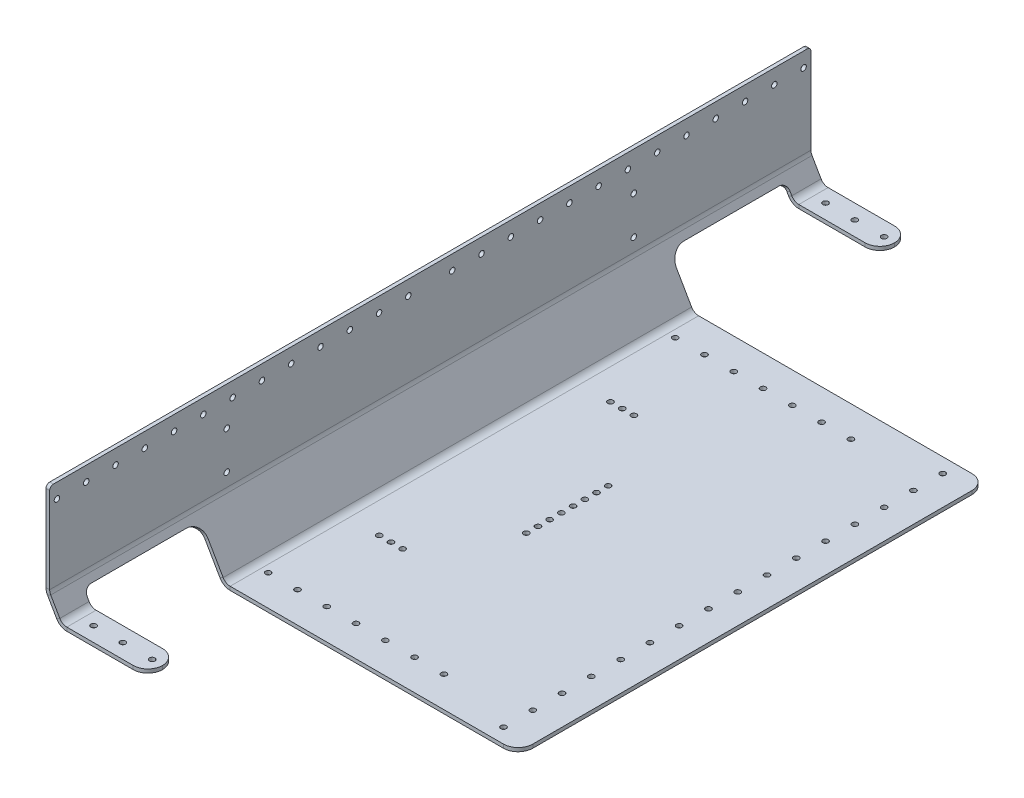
ISO-10303-21;
HEADER;
FILE_DESCRIPTION(('STEP AP214'),'2;1');
FILE_NAME('part.step','',(''),(''),'','','');
FILE_SCHEMA(('AUTOMOTIVE_DESIGN { 1 0 10303 214 1 1 1 1 }'));
ENDSEC;
DATA;
#1=APPLICATION_CONTEXT('core data for automotive mechanical design processes');
#2=APPLICATION_PROTOCOL_DEFINITION('international standard','automotive_design',2000,#1);
#3=PRODUCT_CONTEXT('',#1,'mechanical');
#4=PRODUCT('Part','Part','',(#3));
#5=PRODUCT_RELATED_PRODUCT_CATEGORY('part','',(#4));
#6=PRODUCT_DEFINITION_FORMATION('','',#4);
#7=PRODUCT_DEFINITION_CONTEXT('part definition',#1,'design');
#8=PRODUCT_DEFINITION('design','',#6,#7);
#9=PRODUCT_DEFINITION_SHAPE('','',#8);
#10=(LENGTH_UNIT() NAMED_UNIT(*) SI_UNIT(.MILLI.,.METRE.));
#11=(NAMED_UNIT(*) PLANE_ANGLE_UNIT() SI_UNIT($,.RADIAN.));
#12=(NAMED_UNIT(*) SI_UNIT($,.STERADIAN.) SOLID_ANGLE_UNIT());
#13=UNCERTAINTY_MEASURE_WITH_UNIT(LENGTH_MEASURE(1.E-05),#10,'distance_accuracy_value','');
#14=(GEOMETRIC_REPRESENTATION_CONTEXT(3) GLOBAL_UNCERTAINTY_ASSIGNED_CONTEXT((#13)) GLOBAL_UNIT_ASSIGNED_CONTEXT((#10,
#11,#12)) REPRESENTATION_CONTEXT('',''));
#15=CARTESIAN_POINT('',(0.,0.,0.));
#16=DIRECTION('',(0.,0.,1.));
#17=DIRECTION('',(1.,0.,0.));
#18=AXIS2_PLACEMENT_3D('',#15,#16,#17);
#19=CARTESIAN_POINT('',(222.600302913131,177.982915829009,203.2));
#20=DIRECTION('',(0.,0.,1.));
#21=DIRECTION('',(0.,-1.,0.));
#22=AXIS2_PLACEMENT_3D('',#19,#20,#21);
#23=PLANE('',#22);
#24=DIRECTION('',(-0.500000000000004,0.866025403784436,0.));
#25=VECTOR('',#24,1.);
#26=CARTESIAN_POINT('',(0.,0.,203.2));
#27=LINE('',#26,#25);
#28=CARTESIAN_POINT('',(-2.02072594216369,3.49999999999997,203.2));
#29=VERTEX_POINT('',#28);
#30=CARTESIAN_POINT('',(-15.0687875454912,26.0999056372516,203.2));
#31=VERTEX_POINT('',#30);
#32=EDGE_CURVE('E563',#29,#31,#27,.T.);
#33=ORIENTED_EDGE('',*,*,#32,.T.);
#34=DIRECTION('',(-0.866025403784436,-0.500000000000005,0.));
#35=VECTOR('',#34,1.);
#36=CARTESIAN_POINT('',(-17.8184182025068,24.5124056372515,203.2));
#37=LINE('',#36,#35);
#38=CARTESIAN_POINT('',(-17.8184182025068,24.5124056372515,203.2));
#39=VERTEX_POINT('',#38);
#40=EDGE_CURVE('E635',#31,#39,#37,.T.);
#41=ORIENTED_EDGE('',*,*,#40,.T.);
#42=DIRECTION('',(-0.500000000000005,0.866025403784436,0.));
#43=VECTOR('',#42,1.);
#44=CARTESIAN_POINT('',(-24.1684182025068,35.5109282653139,203.2));
#45=LINE('',#44,#43);
#46=CARTESIAN_POINT('',(-4.77035659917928,1.91249999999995,203.2));
#47=VERTEX_POINT('',#46);
#48=EDGE_CURVE('E378',#47,#39,#45,.T.);
#49=ORIENTED_EDGE('',*,*,#48,.F.);
#50=DIRECTION('',(0.866025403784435,0.500000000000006,0.));
#51=VECTOR('',#50,1.);
#52=CARTESIAN_POINT('',(-4.77035659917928,1.91249999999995,203.2));
#53=LINE('',#52,#51);
#54=EDGE_CURVE('E569',#47,#29,#53,.T.);
#55=ORIENTED_EDGE('',*,*,#54,.T.);
#56=EDGE_LOOP('',(#33,#41,#49,#55));
#57=FACE_BOUND('',#56,.T.);
#58=ADVANCED_FACE('F79',(#57),#23,.T.);
#59=DIRECTION('',(-1.,0.,0.));
#60=VECTOR('',#59,1.);
#61=CARTESIAN_POINT('',(0.,-3.175,203.2));
#62=LINE('',#61,#60);
#63=CARTESIAN_POINT('',(241.168390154,-3.175,203.2));
#64=VERTEX_POINT('',#63);
#65=CARTESIAN_POINT('',(4.04145188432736,-3.175,203.2));
#66=VERTEX_POINT('',#65);
#67=EDGE_CURVE('E391',#64,#66,#62,.T.);
#68=ORIENTED_EDGE('',*,*,#67,.F.);
#69=DIRECTION('',(0.,-1.,0.));
#70=VECTOR('',#69,1.);
#71=CARTESIAN_POINT('',(241.168390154,177.982915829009,203.2));
#72=LINE('',#71,#70);
#73=CARTESIAN_POINT('',(241.168390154,0.,203.2));
#74=VERTEX_POINT('',#73);
#75=EDGE_CURVE('E633',#64,#74,#72,.F.);
#76=ORIENTED_EDGE('',*,*,#75,.T.);
#77=DIRECTION('',(-1.,0.,0.));
#78=VECTOR('',#77,1.);
#79=CARTESIAN_POINT('',(0.,0.,203.2));
#80=LINE('',#79,#78);
#81=CARTESIAN_POINT('',(4.04145188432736,0.,203.2));
#82=VERTEX_POINT('',#81);
#83=EDGE_CURVE('E389',#74,#82,#80,.T.);
#84=ORIENTED_EDGE('',*,*,#83,.T.);
#85=DIRECTION('',(0.,-1.,0.));
#86=VECTOR('',#85,1.);
#87=CARTESIAN_POINT('',(4.04145188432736,0.,203.2));
#88=LINE('',#87,#86);
#89=EDGE_CURVE('E566',#82,#66,#88,.T.);
#90=ORIENTED_EDGE('',*,*,#89,.T.);
#91=EDGE_LOOP('',(#68,#76,#84,#90));
#92=FACE_BOUND('',#91,.T.);
#93=ADVANCED_FACE('F1303',(#92),#23,.T.);
#94=CARTESIAN_POINT('',(-28.7066097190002,46.0976895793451,330.2));
#95=DIRECTION('',(0.,0.,1.));
#96=DIRECTION('',(1.,0.,0.));
#97=AXIS2_PLACEMENT_3D('',#94,#95,#96);
#98=PLANE('',#97);
#99=DIRECTION('',(-0.500000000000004,0.866025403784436,0.));
#100=VECTOR('',#99,1.);
#101=CARTESIAN_POINT('',(-2.74963065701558,-1.58750000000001,330.2));
#102=LINE('',#101,#100);
#103=CARTESIAN_POINT('',(-19.4698039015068,27.3726895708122,330.2));
#104=VERTEX_POINT('',#103);
#105=CARTESIAN_POINT('',(-27.3434182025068,41.010189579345,330.2));
#106=VERTEX_POINT('',#105);
#107=EDGE_CURVE('E480',#104,#106,#102,.T.);
#108=ORIENTED_EDGE('',*,*,#107,.F.);
#109=DIRECTION('',(-0.866025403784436,-0.500000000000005,0.));
#110=VECTOR('',#109,1.);
#111=CARTESIAN_POINT('',(227.298917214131,169.844677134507,330.2));
#112=LINE('',#111,#110);
#113=CARTESIAN_POINT('',(-16.7201732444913,28.9601895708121,330.2));
#114=VERTEX_POINT('',#113);
#115=EDGE_CURVE('E381',#114,#104,#112,.T.);
#116=ORIENTED_EDGE('',*,*,#115,.F.);
#117=DIRECTION('',(-0.500000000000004,0.866025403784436,0.));
#118=VECTOR('',#117,1.);
#119=CARTESIAN_POINT('',(0.,0.,330.2));
#120=LINE('',#119,#118);
#121=CARTESIAN_POINT('',(-24.5937875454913,42.597689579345,330.2));
#122=VERTEX_POINT('',#121);
#123=EDGE_CURVE('E482',#114,#122,#120,.T.);
#124=ORIENTED_EDGE('',*,*,#123,.T.);
#125=DIRECTION('',(-0.866025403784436,-0.500000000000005,0.));
#126=VECTOR('',#125,1.);
#127=CARTESIAN_POINT('',(-24.5937875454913,42.597689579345,330.2));
#128=LINE('',#127,#126);
#129=EDGE_CURVE('E528',#122,#106,#128,.T.);
#130=ORIENTED_EDGE('',*,*,#129,.T.);
#131=EDGE_LOOP('',(#108,#116,#124,#130));
#132=FACE_BOUND('',#131,.T.);
#133=ADVANCED_FACE('F1341',(#132),#98,.T.);
#134=CARTESIAN_POINT('',(-2.74963065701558,-1.58750000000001,330.2));
#135=DIRECTION('',(-0.866025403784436,-0.500000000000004,0.));
#136=DIRECTION('',(0.500000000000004,-0.866025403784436,0.));
#137=AXIS2_PLACEMENT_3D('',#134,#135,#136);
#138=PLANE('',#137);
#139=DIRECTION('',(0.,0.,-1.));
#140=VECTOR('',#139,1.);
#141=CARTESIAN_POINT('',(-4.77035659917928,1.91249999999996,330.2));
#142=LINE('',#141,#140);
#143=CARTESIAN_POINT('',(-4.77035659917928,1.91249999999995,-203.2));
#144=VERTEX_POINT('',#143);
#145=EDGE_CURVE('E507',#47,#144,#142,.T.);
#146=ORIENTED_EDGE('',*,*,#145,.F.);
#147=ORIENTED_EDGE('',*,*,#48,.T.);
#148=CARTESIAN_POINT('',(-17.8184182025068,24.5124056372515,215.9));
#149=DIRECTION('',(-0.866025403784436,-0.500000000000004,0.));
#150=DIRECTION('',(0.500000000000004,-0.866025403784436,0.));
#151=AXIS2_PLACEMENT_3D('',#148,#149,#150);
#152=CIRCLE('',#151,12.7);
#153=CARTESIAN_POINT('',(-24.1684182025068,35.5109282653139,215.9));
#154=VERTEX_POINT('',#153);
#155=EDGE_CURVE('E88',#39,#154,#152,.F.);
#156=ORIENTED_EDGE('',*,*,#155,.T.);
#157=DIRECTION('',(0.,0.,1.));
#158=VECTOR('',#157,1.);
#159=CARTESIAN_POINT('',(-24.1684182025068,35.5109282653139,304.8));
#160=LINE('',#159,#158);
#161=CARTESIAN_POINT('',(-24.1684182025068,35.5109282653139,298.45));
#162=VERTEX_POINT('',#161);
#163=EDGE_CURVE('E376',#154,#162,#160,.T.);
#164=ORIENTED_EDGE('',*,*,#163,.T.);
#165=CARTESIAN_POINT('',(-20.9934182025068,30.0116669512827,298.45));
#166=DIRECTION('',(-0.866025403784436,-0.500000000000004,0.));
#167=DIRECTION('',(0.500000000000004,-0.866025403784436,0.));
#168=AXIS2_PLACEMENT_3D('',#165,#166,#167);
#169=CIRCLE('',#168,6.35);
#170=CARTESIAN_POINT('',(-20.9934182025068,30.0116669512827,304.8));
#171=VERTEX_POINT('',#170);
#172=EDGE_CURVE('E576',#162,#171,#169,.F.);
#173=ORIENTED_EDGE('',*,*,#172,.T.);
#174=DIRECTION('',(0.500000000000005,-0.866025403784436,0.));
#175=VECTOR('',#174,1.);
#176=CARTESIAN_POINT('',(-19.4698039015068,27.3726895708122,304.8));
#177=LINE('',#176,#175);
#178=CARTESIAN_POINT('',(-19.4698039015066,27.3726895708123,304.8));
#179=VERTEX_POINT('',#178);
#180=EDGE_CURVE('E374',#171,#179,#177,.T.);
#181=ORIENTED_EDGE('',*,*,#180,.T.);
#182=DIRECTION('',(0.,0.,1.));
#183=VECTOR('',#182,1.);
#184=CARTESIAN_POINT('',(-19.4698039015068,27.3726895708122,330.2));
#185=LINE('',#184,#183);
#186=EDGE_CURVE('E344',#179,#104,#185,.T.);
#187=ORIENTED_EDGE('',*,*,#186,.T.);
#188=ORIENTED_EDGE('',*,*,#107,.T.);
#189=DIRECTION('',(0.,0.,-1.));
#190=VECTOR('',#189,1.);
#191=CARTESIAN_POINT('',(-27.3434182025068,41.010189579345,330.2));
#192=LINE('',#191,#190);
#193=CARTESIAN_POINT('',(-27.3434182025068,41.010189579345,-330.2));
#194=VERTEX_POINT('',#193);
#195=EDGE_CURVE('E509',#106,#194,#192,.T.);
#196=ORIENTED_EDGE('',*,*,#195,.T.);
#197=DIRECTION('',(-0.500000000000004,0.866025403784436,0.));
#198=VECTOR('',#197,1.);
#199=CARTESIAN_POINT('',(-2.74963065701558,-1.58750000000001,-330.2));
#200=LINE('',#199,#198);
#201=CARTESIAN_POINT('',(-19.469803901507,27.3726895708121,-330.2));
#202=VERTEX_POINT('',#201);
#203=EDGE_CURVE('E464',#202,#194,#200,.T.);
#204=ORIENTED_EDGE('',*,*,#203,.F.);
#205=DIRECTION('',(0.,0.,-1.));
#206=VECTOR('',#205,1.);
#207=CARTESIAN_POINT('',(-19.4698039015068,27.3726895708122,-330.2));
#208=LINE('',#207,#206);
#209=CARTESIAN_POINT('',(-19.4698039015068,27.3726895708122,-304.8));
#210=VERTEX_POINT('',#209);
#211=EDGE_CURVE('E436',#210,#202,#208,.T.);
#212=ORIENTED_EDGE('',*,*,#211,.F.);
#213=DIRECTION('',(0.500000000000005,-0.866025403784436,0.));
#214=VECTOR('',#213,1.);
#215=CARTESIAN_POINT('',(-19.4698039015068,27.3726895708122,-304.8));
#216=LINE('',#215,#214);
#217=CARTESIAN_POINT('',(-20.9934182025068,30.0116669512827,-304.8));
#218=VERTEX_POINT('',#217);
#219=EDGE_CURVE('E434',#218,#210,#216,.T.);
#220=ORIENTED_EDGE('',*,*,#219,.F.);
#221=CARTESIAN_POINT('',(-20.9934182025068,30.0116669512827,-298.45));
#222=DIRECTION('',(-0.866025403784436,-0.500000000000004,0.));
#223=DIRECTION('',(0.500000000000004,-0.866025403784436,0.));
#224=AXIS2_PLACEMENT_3D('',#221,#222,#223);
#225=CIRCLE('',#224,6.35);
#226=CARTESIAN_POINT('',(-24.1684182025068,35.5109282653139,-298.45));
#227=VERTEX_POINT('',#226);
#228=EDGE_CURVE('E552',#218,#227,#225,.F.);
#229=ORIENTED_EDGE('',*,*,#228,.T.);
#230=DIRECTION('',(0.,0.,-1.));
#231=VECTOR('',#230,1.);
#232=CARTESIAN_POINT('',(-24.1684182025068,35.5109282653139,-304.8));
#233=LINE('',#232,#231);
#234=CARTESIAN_POINT('',(-24.1684182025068,35.5109282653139,-215.9));
#235=VERTEX_POINT('',#234);
#236=EDGE_CURVE('E432',#235,#227,#233,.T.);
#237=ORIENTED_EDGE('',*,*,#236,.F.);
#238=CARTESIAN_POINT('',(-17.8184182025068,24.5124056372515,-215.9));
#239=DIRECTION('',(-0.866025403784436,-0.500000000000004,0.));
#240=DIRECTION('',(0.500000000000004,-0.866025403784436,0.));
#241=AXIS2_PLACEMENT_3D('',#238,#239,#240);
#242=CIRCLE('',#241,12.7);
#243=CARTESIAN_POINT('',(-17.8184182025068,24.5124056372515,-203.2));
#244=VERTEX_POINT('',#243);
#245=EDGE_CURVE('E649',#235,#244,#242,.F.);
#246=ORIENTED_EDGE('',*,*,#245,.T.);
#247=DIRECTION('',(-0.500000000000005,0.866025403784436,0.));
#248=VECTOR('',#247,1.);
#249=CARTESIAN_POINT('',(-24.1684182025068,35.5109282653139,-203.2));
#250=LINE('',#249,#248);
#251=EDGE_CURVE('E421',#144,#244,#250,.T.);
#252=ORIENTED_EDGE('',*,*,#251,.F.);
#253=EDGE_LOOP('',(#146,#147,#156,#164,#173,#181,#187,#188,#196,#204,#212,#220,#229,#237,#246,#252));
#254=FACE_BOUND('',#253,.T.);
#255=ADVANCED_FACE('F1310',(#254),#138,.T.);
#256=CARTESIAN_POINT('',(4.04145188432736,7.,330.2));
#257=DIRECTION('',(0.,0.,-1.));
#258=DIRECTION('',(-1.,0.,0.));
#259=AXIS2_PLACEMENT_3D('',#256,#257,#258);
#260=CYLINDRICAL_SURFACE('',#259,10.175);
#261=DIRECTION('',(0.,0.,-1.));
#262=VECTOR('',#261,1.);
#263=CARTESIAN_POINT('',(4.04145188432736,-3.175,330.2));
#264=LINE('',#263,#262);
#265=CARTESIAN_POINT('',(4.04145188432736,-3.175,-203.2));
#266=VERTEX_POINT('',#265);
#267=EDGE_CURVE('E504',#66,#266,#264,.T.);
#268=ORIENTED_EDGE('',*,*,#267,.F.);
#269=CARTESIAN_POINT('',(4.04145188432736,7.,203.2));
#270=DIRECTION('',(0.,0.,1.));
#271=DIRECTION('',(0.,-1.,0.));
#272=AXIS2_PLACEMENT_3D('',#269,#270,#271);
#273=CIRCLE('',#272,10.175);
#274=EDGE_CURVE('E393',#66,#47,#273,.F.);
#275=ORIENTED_EDGE('',*,*,#274,.T.);
#276=ORIENTED_EDGE('',*,*,#145,.T.);
#277=CARTESIAN_POINT('',(4.04145188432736,7.,-203.2));
#278=DIRECTION('',(0.,0.,1.));
#279=DIRECTION('',(0.,-1.,0.));
#280=AXIS2_PLACEMENT_3D('',#277,#278,#279);
#281=CIRCLE('',#280,10.175);
#282=EDGE_CURVE('E452',#266,#144,#281,.F.);
#283=ORIENTED_EDGE('',*,*,#282,.F.);
#284=EDGE_LOOP('',(#268,#275,#276,#283));
#285=FACE_BOUND('',#284,.T.);
#286=ADVANCED_FACE('F1284',(#285),#260,.T.);
#287=CARTESIAN_POINT('',(0.,-3.175,330.2));
#288=DIRECTION('',(0.,-1.,0.));
#289=DIRECTION('',(0.,0.,-1.));
#290=AXIS2_PLACEMENT_3D('',#287,#288,#289);
#291=PLANE('',#290);
#292=CARTESIAN_POINT('',(92.5783903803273,-3.17500000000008,-36.235080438));
#293=DIRECTION('',(0.,1.,0.));
#294=DIRECTION('',(0.,0.,1.));
#295=AXIS2_PLACEMENT_3D('',#292,#293,#294);
#296=CIRCLE('',#295,2.38125);
#297=CARTESIAN_POINT('',(92.5783903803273,-3.17500000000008,-33.853830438));
#298=VERTEX_POINT('',#297);
#299=EDGE_CURVE('E660',#298,#298,#296,.T.);
#300=ORIENTED_EDGE('',*,*,#299,.T.);
#301=EDGE_LOOP('',(#300));
#302=FACE_BOUND('',#301,.T.);
#303=CARTESIAN_POINT('',(92.5783903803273,-3.17500000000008,-26.075080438));
#304=DIRECTION('',(0.,1.,0.));
#305=DIRECTION('',(0.,0.,1.));
#306=AXIS2_PLACEMENT_3D('',#303,#304,#305);
#307=CIRCLE('',#306,2.38125000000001);
#308=CARTESIAN_POINT('',(92.5783903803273,-3.17500000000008,-23.693830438));
#309=VERTEX_POINT('',#308);
#310=EDGE_CURVE('E1144',#309,#309,#307,.T.);
#311=ORIENTED_EDGE('',*,*,#310,.T.);
#312=EDGE_LOOP('',(#311));
#313=FACE_BOUND('',#312,.T.);
#314=CARTESIAN_POINT('',(92.5783903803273,-3.17500000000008,-15.915080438));
#315=DIRECTION('',(0.,1.,0.));
#316=DIRECTION('',(0.,0.,1.));
#317=AXIS2_PLACEMENT_3D('',#314,#315,#316);
#318=CIRCLE('',#317,2.38125000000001);
#319=CARTESIAN_POINT('',(92.5783903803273,-3.17500000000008,-13.533830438));
#320=VERTEX_POINT('',#319);
#321=EDGE_CURVE('E1138',#320,#320,#318,.T.);
#322=ORIENTED_EDGE('',*,*,#321,.T.);
#323=EDGE_LOOP('',(#322));
#324=FACE_BOUND('',#323,.T.);
#325=CARTESIAN_POINT('',(92.5783903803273,-3.17500000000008,-5.75508043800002));
#326=DIRECTION('',(0.,1.,0.));
#327=DIRECTION('',(0.,0.,1.));
#328=AXIS2_PLACEMENT_3D('',#325,#326,#327);
#329=CIRCLE('',#328,2.38125000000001);
#330=CARTESIAN_POINT('',(92.5783903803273,-3.17500000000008,-3.37383043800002));
#331=VERTEX_POINT('',#330);
#332=EDGE_CURVE('E1132',#331,#331,#329,.T.);
#333=ORIENTED_EDGE('',*,*,#332,.T.);
#334=EDGE_LOOP('',(#333));
#335=FACE_BOUND('',#334,.T.);
#336=CARTESIAN_POINT('',(92.5783903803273,-3.17500000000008,4.40491956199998));
#337=DIRECTION('',(0.,1.,0.));
#338=DIRECTION('',(0.,0.,1.));
#339=AXIS2_PLACEMENT_3D('',#336,#337,#338);
#340=CIRCLE('',#339,2.38125000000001);
#341=CARTESIAN_POINT('',(92.5783903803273,-3.17500000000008,6.78616956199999));
#342=VERTEX_POINT('',#341);
#343=EDGE_CURVE('E1126',#342,#342,#340,.T.);
#344=ORIENTED_EDGE('',*,*,#343,.T.);
#345=EDGE_LOOP('',(#344));
#346=FACE_BOUND('',#345,.T.);
#347=CARTESIAN_POINT('',(92.5783903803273,-3.17500000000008,14.564919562));
#348=DIRECTION('',(0.,1.,0.));
#349=DIRECTION('',(0.,0.,1.));
#350=AXIS2_PLACEMENT_3D('',#347,#348,#349);
#351=CIRCLE('',#350,2.38125000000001);
#352=CARTESIAN_POINT('',(92.5783903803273,-3.17500000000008,16.946169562));
#353=VERTEX_POINT('',#352);
#354=EDGE_CURVE('E1120',#353,#353,#351,.T.);
#355=ORIENTED_EDGE('',*,*,#354,.T.);
#356=EDGE_LOOP('',(#355));
#357=FACE_BOUND('',#356,.T.);
#358=CARTESIAN_POINT('',(92.5783903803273,-3.17500000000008,24.724919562));
#359=DIRECTION('',(0.,1.,0.));
#360=DIRECTION('',(0.,0.,1.));
#361=AXIS2_PLACEMENT_3D('',#358,#359,#360);
#362=CIRCLE('',#361,2.38125000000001);
#363=CARTESIAN_POINT('',(92.5783903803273,-3.17500000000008,27.106169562));
#364=VERTEX_POINT('',#363);
#365=EDGE_CURVE('E1114',#364,#364,#362,.T.);
#366=ORIENTED_EDGE('',*,*,#365,.T.);
#367=EDGE_LOOP('',(#366));
#368=FACE_BOUND('',#367,.T.);
#369=CARTESIAN_POINT('',(30.4753903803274,-3.17500000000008,-100.289919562));
#370=DIRECTION('',(0.,1.,0.));
#371=DIRECTION('',(0.,0.,-1.));
#372=AXIS2_PLACEMENT_3D('',#369,#370,#371);
#373=CIRCLE('',#372,2.38125);
#374=CARTESIAN_POINT('',(30.4753903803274,-3.17500000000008,-102.671169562));
#375=VERTEX_POINT('',#374);
#376=EDGE_CURVE('E1108',#375,#375,#373,.T.);
#377=ORIENTED_EDGE('',*,*,#376,.T.);
#378=EDGE_LOOP('',(#377));
#379=FACE_BOUND('',#378,.T.);
#380=CARTESIAN_POINT('',(40.6353903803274,-3.17500000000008,-100.289919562));
#381=DIRECTION('',(0.,1.,0.));
#382=DIRECTION('',(0.,0.,-1.));
#383=AXIS2_PLACEMENT_3D('',#380,#381,#382);
#384=CIRCLE('',#383,2.38125);
#385=CARTESIAN_POINT('',(40.6353903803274,-3.17500000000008,-102.671169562));
#386=VERTEX_POINT('',#385);
#387=EDGE_CURVE('E1102',#386,#386,#384,.T.);
#388=ORIENTED_EDGE('',*,*,#387,.T.);
#389=EDGE_LOOP('',(#388));
#390=FACE_BOUND('',#389,.T.);
#391=CARTESIAN_POINT('',(50.7953903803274,-3.17500000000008,-100.289919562));
#392=DIRECTION('',(0.,1.,0.));
#393=DIRECTION('',(0.,0.,-1.));
#394=AXIS2_PLACEMENT_3D('',#391,#392,#393);
#395=CIRCLE('',#394,2.38124999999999);
#396=CARTESIAN_POINT('',(50.7953903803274,-3.17500000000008,-102.671169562));
#397=VERTEX_POINT('',#396);
#398=EDGE_CURVE('E1096',#397,#397,#395,.T.);
#399=ORIENTED_EDGE('',*,*,#398,.T.);
#400=EDGE_LOOP('',(#399));
#401=FACE_BOUND('',#400,.T.);
#402=CARTESIAN_POINT('',(50.7953903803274,-3.17500000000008,100.289919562));
#403=DIRECTION('',(0.,1.,0.));
#404=DIRECTION('',(0.,0.,1.));
#405=AXIS2_PLACEMENT_3D('',#402,#403,#404);
#406=CIRCLE('',#405,2.38124999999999);
#407=CARTESIAN_POINT('',(50.7953903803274,-3.17500000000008,102.671169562));
#408=VERTEX_POINT('',#407);
#409=EDGE_CURVE('E1090',#408,#408,#406,.T.);
#410=ORIENTED_EDGE('',*,*,#409,.T.);
#411=EDGE_LOOP('',(#410));
#412=FACE_BOUND('',#411,.T.);
#413=CARTESIAN_POINT('',(40.6353903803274,-3.17500000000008,100.289919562));
#414=DIRECTION('',(0.,1.,0.));
#415=DIRECTION('',(0.,0.,1.));
#416=AXIS2_PLACEMENT_3D('',#413,#414,#415);
#417=CIRCLE('',#416,2.38125);
#418=CARTESIAN_POINT('',(40.6353903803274,-3.17500000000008,102.671169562));
#419=VERTEX_POINT('',#418);
#420=EDGE_CURVE('E1084',#419,#419,#417,.T.);
#421=ORIENTED_EDGE('',*,*,#420,.T.);
#422=EDGE_LOOP('',(#421));
#423=FACE_BOUND('',#422,.T.);
#424=CARTESIAN_POINT('',(162.791451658,-3.17500000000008,-176.53762));
#425=DIRECTION('',(0.,1.,0.));
#426=DIRECTION('',(0.,0.,-1.));
#427=AXIS2_PLACEMENT_3D('',#424,#425,#426);
#428=CIRCLE('',#427,2.38125);
#429=CARTESIAN_POINT('',(162.791451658,-3.17500000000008,-178.91887));
#430=VERTEX_POINT('',#429);
#431=EDGE_CURVE('E1078',#430,#430,#428,.T.);
#432=ORIENTED_EDGE('',*,*,#431,.T.);
#433=EDGE_LOOP('',(#432));
#434=FACE_BOUND('',#433,.T.);
#435=CARTESIAN_POINT('',(137.391451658,-3.17500000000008,-176.53762));
#436=DIRECTION('',(0.,1.,0.));
#437=DIRECTION('',(0.,0.,-1.));
#438=AXIS2_PLACEMENT_3D('',#435,#436,#437);
#439=CIRCLE('',#438,2.38125);
#440=CARTESIAN_POINT('',(137.391451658,-3.17500000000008,-178.91887));
#441=VERTEX_POINT('',#440);
#442=EDGE_CURVE('E1072',#441,#441,#439,.T.);
#443=ORIENTED_EDGE('',*,*,#442,.T.);
#444=EDGE_LOOP('',(#443));
#445=FACE_BOUND('',#444,.T.);
#446=CARTESIAN_POINT('',(111.991451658,-3.17500000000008,-176.53762));
#447=DIRECTION('',(0.,1.,0.));
#448=DIRECTION('',(0.,0.,-1.));
#449=AXIS2_PLACEMENT_3D('',#446,#447,#448);
#450=CIRCLE('',#449,2.38125);
#451=CARTESIAN_POINT('',(111.991451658,-3.17500000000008,-178.91887));
#452=VERTEX_POINT('',#451);
#453=EDGE_CURVE('E1066',#452,#452,#450,.T.);
#454=ORIENTED_EDGE('',*,*,#453,.T.);
#455=EDGE_LOOP('',(#454));
#456=FACE_BOUND('',#455,.T.);
#457=CARTESIAN_POINT('',(86.591451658,-3.17500000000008,-176.53762));
#458=DIRECTION('',(0.,1.,0.));
#459=DIRECTION('',(0.,0.,-1.));
#460=AXIS2_PLACEMENT_3D('',#457,#458,#459);
#461=CIRCLE('',#460,2.38125);
#462=CARTESIAN_POINT('',(86.591451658,-3.17500000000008,-178.91887));
#463=VERTEX_POINT('',#462);
#464=EDGE_CURVE('E1060',#463,#463,#461,.T.);
#465=ORIENTED_EDGE('',*,*,#464,.T.);
#466=EDGE_LOOP('',(#465));
#467=FACE_BOUND('',#466,.T.);
#468=CARTESIAN_POINT('',(61.191451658,-3.17500000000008,-176.537620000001));
#469=DIRECTION('',(0.,1.,0.));
#470=DIRECTION('',(0.,0.,-1.));
#471=AXIS2_PLACEMENT_3D('',#468,#469,#470);
#472=CIRCLE('',#471,2.38125);
#473=CARTESIAN_POINT('',(61.191451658,-3.17500000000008,-178.918870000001));
#474=VERTEX_POINT('',#473);
#475=EDGE_CURVE('E1054',#474,#474,#472,.T.);
#476=ORIENTED_EDGE('',*,*,#475,.T.);
#477=EDGE_LOOP('',(#476));
#478=FACE_BOUND('',#477,.T.);
#479=CARTESIAN_POINT('',(35.791451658,-3.17500000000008,-176.537620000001));
#480=DIRECTION('',(0.,1.,0.));
#481=DIRECTION('',(0.,0.,-1.));
#482=AXIS2_PLACEMENT_3D('',#479,#480,#481);
#483=CIRCLE('',#482,2.38125);
#484=CARTESIAN_POINT('',(35.791451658,-3.17500000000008,-178.918870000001));
#485=VERTEX_POINT('',#484);
#486=EDGE_CURVE('E1048',#485,#485,#483,.T.);
#487=ORIENTED_EDGE('',*,*,#486,.T.);
#488=EDGE_LOOP('',(#487));
#489=FACE_BOUND('',#488,.T.);
#490=CARTESIAN_POINT('',(10.391451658,-3.17500000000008,176.537620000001));
#491=DIRECTION('',(0.,1.,0.));
#492=DIRECTION('',(0.,0.,1.));
#493=AXIS2_PLACEMENT_3D('',#490,#491,#492);
#494=CIRCLE('',#493,2.38125);
#495=CARTESIAN_POINT('',(10.391451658,-3.17500000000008,178.918870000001));
#496=VERTEX_POINT('',#495);
#497=EDGE_CURVE('E1042',#496,#496,#494,.T.);
#498=ORIENTED_EDGE('',*,*,#497,.T.);
#499=EDGE_LOOP('',(#498));
#500=FACE_BOUND('',#499,.T.);
#501=CARTESIAN_POINT('',(35.791451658,-3.17500000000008,176.537620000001));
#502=DIRECTION('',(0.,1.,0.));
#503=DIRECTION('',(0.,0.,1.));
#504=AXIS2_PLACEMENT_3D('',#501,#502,#503);
#505=CIRCLE('',#504,2.38125);
#506=CARTESIAN_POINT('',(35.791451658,-3.17500000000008,178.918870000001));
#507=VERTEX_POINT('',#506);
#508=EDGE_CURVE('E1036',#507,#507,#505,.T.);
#509=ORIENTED_EDGE('',*,*,#508,.T.);
#510=EDGE_LOOP('',(#509));
#511=FACE_BOUND('',#510,.T.);
#512=CARTESIAN_POINT('',(61.191451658,-3.17500000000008,176.537620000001));
#513=DIRECTION('',(0.,1.,0.));
#514=DIRECTION('',(0.,0.,1.));
#515=AXIS2_PLACEMENT_3D('',#512,#513,#514);
#516=CIRCLE('',#515,2.38125);
#517=CARTESIAN_POINT('',(61.191451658,-3.17500000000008,178.918870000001));
#518=VERTEX_POINT('',#517);
#519=EDGE_CURVE('E1030',#518,#518,#516,.T.);
#520=ORIENTED_EDGE('',*,*,#519,.T.);
#521=EDGE_LOOP('',(#520));
#522=FACE_BOUND('',#521,.T.);
#523=CARTESIAN_POINT('',(86.591451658,-3.17500000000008,176.53762));
#524=DIRECTION('',(0.,1.,0.));
#525=DIRECTION('',(0.,0.,1.));
#526=AXIS2_PLACEMENT_3D('',#523,#524,#525);
#527=CIRCLE('',#526,2.38125);
#528=CARTESIAN_POINT('',(86.591451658,-3.17500000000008,178.91887));
#529=VERTEX_POINT('',#528);
#530=EDGE_CURVE('E1024',#529,#529,#527,.T.);
#531=ORIENTED_EDGE('',*,*,#530,.T.);
#532=EDGE_LOOP('',(#531));
#533=FACE_BOUND('',#532,.T.);
#534=CARTESIAN_POINT('',(111.991451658,-3.17500000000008,176.53762));
#535=DIRECTION('',(0.,1.,0.));
#536=DIRECTION('',(0.,0.,1.));
#537=AXIS2_PLACEMENT_3D('',#534,#535,#536);
#538=CIRCLE('',#537,2.38125);
#539=CARTESIAN_POINT('',(111.991451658,-3.17500000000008,178.91887));
#540=VERTEX_POINT('',#539);
#541=EDGE_CURVE('E1018',#540,#540,#538,.T.);
#542=ORIENTED_EDGE('',*,*,#541,.T.);
#543=EDGE_LOOP('',(#542));
#544=FACE_BOUND('',#543,.T.);
#545=CARTESIAN_POINT('',(137.391451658,-3.17500000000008,176.53762));
#546=DIRECTION('',(0.,1.,0.));
#547=DIRECTION('',(0.,0.,1.));
#548=AXIS2_PLACEMENT_3D('',#545,#546,#547);
#549=CIRCLE('',#548,2.38125);
#550=CARTESIAN_POINT('',(137.391451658,-3.17500000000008,178.91887));
#551=VERTEX_POINT('',#550);
#552=EDGE_CURVE('E1012',#551,#551,#549,.T.);
#553=ORIENTED_EDGE('',*,*,#552,.T.);
#554=EDGE_LOOP('',(#553));
#555=FACE_BOUND('',#554,.T.);
#556=CARTESIAN_POINT('',(10.391451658,-3.17500000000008,-176.537620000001));
#557=DIRECTION('',(0.,1.,0.));
#558=DIRECTION('',(0.,0.,-1.));
#559=AXIS2_PLACEMENT_3D('',#556,#557,#558);
#560=CIRCLE('',#559,2.38125);
#561=CARTESIAN_POINT('',(10.391451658,-3.17500000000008,-178.918870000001));
#562=VERTEX_POINT('',#561);
#563=EDGE_CURVE('E1006',#562,#562,#560,.T.);
#564=ORIENTED_EDGE('',*,*,#563,.T.);
#565=EDGE_LOOP('',(#564));
#566=FACE_BOUND('',#565,.T.);
#567=CARTESIAN_POINT('',(228.468390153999,-3.17500000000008,-190.5));
#568=DIRECTION('',(0.,1.,0.));
#569=DIRECTION('',(0.,0.,1.));
#570=AXIS2_PLACEMENT_3D('',#567,#568,#569);
#571=CIRCLE('',#570,2.38125);
#572=CARTESIAN_POINT('',(228.468390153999,-3.17500000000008,-188.11875));
#573=VERTEX_POINT('',#572);
#574=EDGE_CURVE('E1000',#573,#573,#571,.T.);
#575=ORIENTED_EDGE('',*,*,#574,.T.);
#576=EDGE_LOOP('',(#575));
#577=FACE_BOUND('',#576,.T.);
#578=CARTESIAN_POINT('',(228.468390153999,-3.17500000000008,-165.1));
#579=DIRECTION('',(0.,1.,0.));
#580=DIRECTION('',(0.,0.,1.));
#581=AXIS2_PLACEMENT_3D('',#578,#579,#580);
#582=CIRCLE('',#581,2.38125);
#583=CARTESIAN_POINT('',(228.468390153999,-3.17500000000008,-162.71875));
#584=VERTEX_POINT('',#583);
#585=EDGE_CURVE('E994',#584,#584,#582,.T.);
#586=ORIENTED_EDGE('',*,*,#585,.T.);
#587=EDGE_LOOP('',(#586));
#588=FACE_BOUND('',#587,.T.);
#589=CARTESIAN_POINT('',(228.468390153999,-3.17500000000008,-139.7));
#590=DIRECTION('',(0.,1.,0.));
#591=DIRECTION('',(0.,0.,1.));
#592=AXIS2_PLACEMENT_3D('',#589,#590,#591);
#593=CIRCLE('',#592,2.38125);
#594=CARTESIAN_POINT('',(228.468390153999,-3.17500000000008,-137.31875));
#595=VERTEX_POINT('',#594);
#596=EDGE_CURVE('E988',#595,#595,#593,.T.);
#597=ORIENTED_EDGE('',*,*,#596,.T.);
#598=EDGE_LOOP('',(#597));
#599=FACE_BOUND('',#598,.T.);
#600=CARTESIAN_POINT('',(228.468390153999,-3.17500000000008,-114.3));
#601=DIRECTION('',(0.,1.,0.));
#602=DIRECTION('',(0.,0.,1.));
#603=AXIS2_PLACEMENT_3D('',#600,#601,#602);
#604=CIRCLE('',#603,2.38125);
#605=CARTESIAN_POINT('',(228.468390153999,-3.17500000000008,-111.91875));
#606=VERTEX_POINT('',#605);
#607=EDGE_CURVE('E982',#606,#606,#604,.T.);
#608=ORIENTED_EDGE('',*,*,#607,.T.);
#609=EDGE_LOOP('',(#608));
#610=FACE_BOUND('',#609,.T.);
#611=CARTESIAN_POINT('',(228.468390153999,-3.17500000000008,-88.9));
#612=DIRECTION('',(0.,1.,0.));
#613=DIRECTION('',(0.,0.,1.));
#614=AXIS2_PLACEMENT_3D('',#611,#612,#613);
#615=CIRCLE('',#614,2.38125);
#616=CARTESIAN_POINT('',(228.468390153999,-3.17500000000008,-86.51875));
#617=VERTEX_POINT('',#616);
#618=EDGE_CURVE('E976',#617,#617,#615,.T.);
#619=ORIENTED_EDGE('',*,*,#618,.T.);
#620=EDGE_LOOP('',(#619));
#621=FACE_BOUND('',#620,.T.);
#622=CARTESIAN_POINT('',(228.468390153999,-3.17500000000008,-63.5));
#623=DIRECTION('',(0.,1.,0.));
#624=DIRECTION('',(0.,0.,1.));
#625=AXIS2_PLACEMENT_3D('',#622,#623,#624);
#626=CIRCLE('',#625,2.38125);
#627=CARTESIAN_POINT('',(228.468390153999,-3.17500000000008,-61.11875));
#628=VERTEX_POINT('',#627);
#629=EDGE_CURVE('E970',#628,#628,#626,.T.);
#630=ORIENTED_EDGE('',*,*,#629,.T.);
#631=EDGE_LOOP('',(#630));
#632=FACE_BOUND('',#631,.T.);
#633=CARTESIAN_POINT('',(228.468390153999,-3.17500000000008,-38.1));
#634=DIRECTION('',(0.,1.,0.));
#635=DIRECTION('',(0.,0.,1.));
#636=AXIS2_PLACEMENT_3D('',#633,#634,#635);
#637=CIRCLE('',#636,2.38125);
#638=CARTESIAN_POINT('',(228.468390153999,-3.17500000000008,-35.71875));
#639=VERTEX_POINT('',#638);
#640=EDGE_CURVE('E964',#639,#639,#637,.T.);
#641=ORIENTED_EDGE('',*,*,#640,.T.);
#642=EDGE_LOOP('',(#641));
#643=FACE_BOUND('',#642,.T.);
#644=CARTESIAN_POINT('',(228.468390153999,-3.17500000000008,-12.7));
#645=DIRECTION('',(0.,1.,0.));
#646=DIRECTION('',(0.,0.,1.));
#647=AXIS2_PLACEMENT_3D('',#644,#645,#646);
#648=CIRCLE('',#647,2.38125);
#649=CARTESIAN_POINT('',(228.468390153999,-3.17500000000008,-10.31875));
#650=VERTEX_POINT('',#649);
#651=EDGE_CURVE('E958',#650,#650,#648,.T.);
#652=ORIENTED_EDGE('',*,*,#651,.T.);
#653=EDGE_LOOP('',(#652));
#654=FACE_BOUND('',#653,.T.);
#655=CARTESIAN_POINT('',(228.468390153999,-3.17500000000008,12.7));
#656=DIRECTION('',(0.,1.,0.));
#657=DIRECTION('',(0.,0.,1.));
#658=AXIS2_PLACEMENT_3D('',#655,#656,#657);
#659=CIRCLE('',#658,2.38125);
#660=CARTESIAN_POINT('',(228.468390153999,-3.17500000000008,15.08125));
#661=VERTEX_POINT('',#660);
#662=EDGE_CURVE('E952',#661,#661,#659,.T.);
#663=ORIENTED_EDGE('',*,*,#662,.T.);
#664=EDGE_LOOP('',(#663));
#665=FACE_BOUND('',#664,.T.);
#666=CARTESIAN_POINT('',(228.468390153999,-3.17500000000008,38.1));
#667=DIRECTION('',(0.,1.,0.));
#668=DIRECTION('',(0.,0.,1.));
#669=AXIS2_PLACEMENT_3D('',#666,#667,#668);
#670=CIRCLE('',#669,2.38125);
#671=CARTESIAN_POINT('',(228.468390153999,-3.17500000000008,40.48125));
#672=VERTEX_POINT('',#671);
#673=EDGE_CURVE('E946',#672,#672,#670,.T.);
#674=ORIENTED_EDGE('',*,*,#673,.T.);
#675=EDGE_LOOP('',(#674));
#676=FACE_BOUND('',#675,.T.);
#677=CARTESIAN_POINT('',(228.468390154,-3.17500000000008,63.5));
#678=DIRECTION('',(0.,1.,0.));
#679=DIRECTION('',(0.,0.,1.));
#680=AXIS2_PLACEMENT_3D('',#677,#678,#679);
#681=CIRCLE('',#680,2.38125);
#682=CARTESIAN_POINT('',(228.468390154,-3.17500000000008,65.88125));
#683=VERTEX_POINT('',#682);
#684=EDGE_CURVE('E940',#683,#683,#681,.T.);
#685=ORIENTED_EDGE('',*,*,#684,.T.);
#686=EDGE_LOOP('',(#685));
#687=FACE_BOUND('',#686,.T.);
#688=CARTESIAN_POINT('',(228.468390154,-3.17500000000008,88.9));
#689=DIRECTION('',(0.,1.,0.));
#690=DIRECTION('',(0.,0.,1.));
#691=AXIS2_PLACEMENT_3D('',#688,#689,#690);
#692=CIRCLE('',#691,2.38125);
#693=CARTESIAN_POINT('',(228.468390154,-3.17500000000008,91.28125));
#694=VERTEX_POINT('',#693);
#695=EDGE_CURVE('E934',#694,#694,#692,.T.);
#696=ORIENTED_EDGE('',*,*,#695,.T.);
#697=EDGE_LOOP('',(#696));
#698=FACE_BOUND('',#697,.T.);
#699=CARTESIAN_POINT('',(228.468390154,-3.17500000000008,114.3));
#700=DIRECTION('',(0.,1.,0.));
#701=DIRECTION('',(0.,0.,1.));
#702=AXIS2_PLACEMENT_3D('',#699,#700,#701);
#703=CIRCLE('',#702,2.38125);
#704=CARTESIAN_POINT('',(228.468390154,-3.17500000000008,116.68125));
#705=VERTEX_POINT('',#704);
#706=EDGE_CURVE('E928',#705,#705,#703,.T.);
#707=ORIENTED_EDGE('',*,*,#706,.T.);
#708=EDGE_LOOP('',(#707));
#709=FACE_BOUND('',#708,.T.);
#710=CARTESIAN_POINT('',(228.468390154,-3.17500000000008,139.7));
#711=DIRECTION('',(0.,1.,0.));
#712=DIRECTION('',(0.,0.,1.));
#713=AXIS2_PLACEMENT_3D('',#710,#711,#712);
#714=CIRCLE('',#713,2.38125000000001);
#715=CARTESIAN_POINT('',(228.468390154,-3.17500000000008,142.08125));
#716=VERTEX_POINT('',#715);
#717=EDGE_CURVE('E922',#716,#716,#714,.T.);
#718=ORIENTED_EDGE('',*,*,#717,.T.);
#719=EDGE_LOOP('',(#718));
#720=FACE_BOUND('',#719,.T.);
#721=CARTESIAN_POINT('',(228.468390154,-3.17500000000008,165.1));
#722=DIRECTION('',(0.,1.,0.));
#723=DIRECTION('',(0.,0.,1.));
#724=AXIS2_PLACEMENT_3D('',#721,#722,#723);
#725=CIRCLE('',#724,2.38125);
#726=CARTESIAN_POINT('',(228.468390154,-3.17500000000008,167.48125));
#727=VERTEX_POINT('',#726);
#728=EDGE_CURVE('E916',#727,#727,#725,.T.);
#729=ORIENTED_EDGE('',*,*,#728,.T.);
#730=EDGE_LOOP('',(#729));
#731=FACE_BOUND('',#730,.T.);
#732=CARTESIAN_POINT('',(162.791451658,-3.17500000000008,176.53762));
#733=DIRECTION('',(0.,1.,0.));
#734=DIRECTION('',(0.,0.,1.));
#735=AXIS2_PLACEMENT_3D('',#732,#733,#734);
#736=CIRCLE('',#735,2.38125);
#737=CARTESIAN_POINT('',(162.791451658,-3.17500000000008,178.91887));
#738=VERTEX_POINT('',#737);
#739=EDGE_CURVE('E910',#738,#738,#736,.T.);
#740=ORIENTED_EDGE('',*,*,#739,.T.);
#741=EDGE_LOOP('',(#740));
#742=FACE_BOUND('',#741,.T.);
#743=CARTESIAN_POINT('',(92.5783903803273,-3.17500000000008,34.884919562));
#744=DIRECTION('',(0.,1.,0.));
#745=DIRECTION('',(0.,0.,1.));
#746=AXIS2_PLACEMENT_3D('',#743,#744,#745);
#747=CIRCLE('',#746,2.38125);
#748=CARTESIAN_POINT('',(92.5783903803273,-3.17500000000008,37.266169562));
#749=VERTEX_POINT('',#748);
#750=EDGE_CURVE('E904',#749,#749,#747,.T.);
#751=ORIENTED_EDGE('',*,*,#750,.T.);
#752=EDGE_LOOP('',(#751));
#753=FACE_BOUND('',#752,.T.);
#754=CARTESIAN_POINT('',(30.4753903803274,-3.17500000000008,100.289919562));
#755=DIRECTION('',(0.,1.,0.));
#756=DIRECTION('',(0.,0.,1.));
#757=AXIS2_PLACEMENT_3D('',#754,#755,#756);
#758=CIRCLE('',#757,2.38125);
#759=CARTESIAN_POINT('',(30.4753903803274,-3.17500000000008,102.671169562));
#760=VERTEX_POINT('',#759);
#761=EDGE_CURVE('E898',#760,#760,#758,.T.);
#762=ORIENTED_EDGE('',*,*,#761,.T.);
#763=EDGE_LOOP('',(#762));
#764=FACE_BOUND('',#763,.T.);
#765=CARTESIAN_POINT('',(228.468390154,-3.17500000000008,190.5));
#766=DIRECTION('',(0.,1.,0.));
#767=DIRECTION('',(0.,0.,1.));
#768=AXIS2_PLACEMENT_3D('',#765,#766,#767);
#769=CIRCLE('',#768,2.38125);
#770=CARTESIAN_POINT('',(228.468390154,-3.17500000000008,192.88125));
#771=VERTEX_POINT('',#770);
#772=EDGE_CURVE('E892',#771,#771,#769,.T.);
#773=ORIENTED_EDGE('',*,*,#772,.T.);
#774=EDGE_LOOP('',(#773));
#775=FACE_BOUND('',#774,.T.);
#776=DIRECTION('',(-1.,0.,0.));
#777=VECTOR('',#776,1.);
#778=CARTESIAN_POINT('',(0.,-3.175,-203.2));
#779=LINE('',#778,#777);
#780=CARTESIAN_POINT('',(241.168390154,-3.175,-203.2));
#781=VERTEX_POINT('',#780);
#782=EDGE_CURVE('E450',#781,#266,#779,.T.);
#783=ORIENTED_EDGE('',*,*,#782,.F.);
#784=CARTESIAN_POINT('',(241.168390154,-3.17500000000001,-190.5));
#785=DIRECTION('',(0.,-1.,0.));
#786=DIRECTION('',(0.,0.,-1.));
#787=AXIS2_PLACEMENT_3D('',#784,#785,#786);
#788=CIRCLE('',#787,12.7);
#789=CARTESIAN_POINT('',(253.868390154,-3.175,-190.5));
#790=VERTEX_POINT('',#789);
#791=EDGE_CURVE('E622',#781,#790,#788,.T.);
#792=ORIENTED_EDGE('',*,*,#791,.T.);
#793=DIRECTION('',(0.,0.,-1.));
#794=VECTOR('',#793,1.);
#795=CARTESIAN_POINT('',(253.868390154,-3.175,330.2));
#796=LINE('',#795,#794);
#797=CARTESIAN_POINT('',(253.868390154,-3.175,190.5));
#798=VERTEX_POINT('',#797);
#799=EDGE_CURVE('E501',#798,#790,#796,.T.);
#800=ORIENTED_EDGE('',*,*,#799,.F.);
#801=CARTESIAN_POINT('',(241.168390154,-3.175,190.5));
#802=DIRECTION('',(0.,-1.,0.));
#803=DIRECTION('',(0.,0.,-1.));
#804=AXIS2_PLACEMENT_3D('',#801,#802,#803);
#805=CIRCLE('',#804,12.7);
#806=EDGE_CURVE('E620',#798,#64,#805,.T.);
#807=ORIENTED_EDGE('',*,*,#806,.T.);
#808=ORIENTED_EDGE('',*,*,#67,.T.);
#809=ORIENTED_EDGE('',*,*,#267,.T.);
#810=EDGE_LOOP('',(#783,#792,#800,#807,#808,#809));
#811=FACE_BOUND('',#810,.T.);
#812=ADVANCED_FACE('F1155',(#302,#313,#324,#335,#346,#357,#368,#379,#390,#401,#412,#423,#434,
#445,#456,#467,#478,#489,#500,#511,#522,#533,#544,#555,#566,#577,#588,#599,#610,#621,#632,#643,
#654,#665,#676,#687,#698,#709,#720,#731,#742,#753,#764,#775,#811),#291,.T.);
#813=CARTESIAN_POINT('',(253.868390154,0.,330.2));
#814=DIRECTION('',(1.,0.,0.));
#815=DIRECTION('',(0.,0.,-1.));
#816=AXIS2_PLACEMENT_3D('',#813,#814,#815);
#817=PLANE('',#816);
#818=ORIENTED_EDGE('',*,*,#799,.T.);
#819=DIRECTION('',(0.,-1.,0.));
#820=VECTOR('',#819,1.);
#821=CARTESIAN_POINT('',(253.868390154,0.,-190.5));
#822=LINE('',#821,#820);
#823=CARTESIAN_POINT('',(253.868390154,0.,-190.5));
#824=VERTEX_POINT('',#823);
#825=EDGE_CURVE('E627',#790,#824,#822,.F.);
#826=ORIENTED_EDGE('',*,*,#825,.T.);
#827=DIRECTION('',(0.,0.,-1.));
#828=VECTOR('',#827,1.);
#829=CARTESIAN_POINT('',(253.868390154,0.,330.2));
#830=LINE('',#829,#828);
#831=CARTESIAN_POINT('',(253.868390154,0.,190.5));
#832=VERTEX_POINT('',#831);
#833=EDGE_CURVE('E498',#832,#824,#830,.T.);
#834=ORIENTED_EDGE('',*,*,#833,.F.);
#835=DIRECTION('',(0.,-1.,0.));
#836=VECTOR('',#835,1.);
#837=CARTESIAN_POINT('',(253.868390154,0.,190.5));
#838=LINE('',#837,#836);
#839=EDGE_CURVE('E624',#832,#798,#838,.T.);
#840=ORIENTED_EDGE('',*,*,#839,.T.);
#841=EDGE_LOOP('',(#818,#826,#834,#840));
#842=FACE_BOUND('',#841,.T.);
#843=ADVANCED_FACE('F1170',(#842),#817,.T.);
#844=CARTESIAN_POINT('',(0.,0.,330.2));
#845=DIRECTION('',(0.,-1.,0.));
#846=DIRECTION('',(0.,0.,-1.));
#847=AXIS2_PLACEMENT_3D('',#844,#845,#846);
#848=PLANE('',#847);
#849=CARTESIAN_POINT('',(92.5783903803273,0.,-36.235080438));
#850=DIRECTION('',(0.,1.,0.));
#851=DIRECTION('',(0.,0.,1.));
#852=AXIS2_PLACEMENT_3D('',#849,#850,#851);
#853=CIRCLE('',#852,2.38125);
#854=CARTESIAN_POINT('',(92.5783903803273,0.,-33.853830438));
#855=VERTEX_POINT('',#854);
#856=EDGE_CURVE('E655',#855,#855,#853,.T.);
#857=ORIENTED_EDGE('',*,*,#856,.F.);
#858=EDGE_LOOP('',(#857));
#859=FACE_BOUND('',#858,.T.);
#860=CARTESIAN_POINT('',(92.5783903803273,0.,-26.075080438));
#861=DIRECTION('',(0.,1.,0.));
#862=DIRECTION('',(0.,0.,1.));
#863=AXIS2_PLACEMENT_3D('',#860,#861,#862);
#864=CIRCLE('',#863,2.38125000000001);
#865=CARTESIAN_POINT('',(92.5783903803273,0.,-23.693830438));
#866=VERTEX_POINT('',#865);
#867=EDGE_CURVE('E1147',#866,#866,#864,.T.);
#868=ORIENTED_EDGE('',*,*,#867,.F.);
#869=EDGE_LOOP('',(#868));
#870=FACE_BOUND('',#869,.T.);
#871=CARTESIAN_POINT('',(92.5783903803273,0.,-15.915080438));
#872=DIRECTION('',(0.,1.,0.));
#873=DIRECTION('',(0.,0.,1.));
#874=AXIS2_PLACEMENT_3D('',#871,#872,#873);
#875=CIRCLE('',#874,2.38125000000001);
#876=CARTESIAN_POINT('',(92.5783903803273,0.,-13.533830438));
#877=VERTEX_POINT('',#876);
#878=EDGE_CURVE('E1141',#877,#877,#875,.T.);
#879=ORIENTED_EDGE('',*,*,#878,.F.);
#880=EDGE_LOOP('',(#879));
#881=FACE_BOUND('',#880,.T.);
#882=CARTESIAN_POINT('',(92.5783903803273,0.,-5.75508043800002));
#883=DIRECTION('',(0.,1.,0.));
#884=DIRECTION('',(0.,0.,1.));
#885=AXIS2_PLACEMENT_3D('',#882,#883,#884);
#886=CIRCLE('',#885,2.38125000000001);
#887=CARTESIAN_POINT('',(92.5783903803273,0.,-3.37383043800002));
#888=VERTEX_POINT('',#887);
#889=EDGE_CURVE('E1135',#888,#888,#886,.T.);
#890=ORIENTED_EDGE('',*,*,#889,.F.);
#891=EDGE_LOOP('',(#890));
#892=FACE_BOUND('',#891,.T.);
#893=CARTESIAN_POINT('',(92.5783903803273,0.,4.40491956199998));
#894=DIRECTION('',(0.,1.,0.));
#895=DIRECTION('',(0.,0.,1.));
#896=AXIS2_PLACEMENT_3D('',#893,#894,#895);
#897=CIRCLE('',#896,2.38125000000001);
#898=CARTESIAN_POINT('',(92.5783903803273,0.,6.78616956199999));
#899=VERTEX_POINT('',#898);
#900=EDGE_CURVE('E1129',#899,#899,#897,.T.);
#901=ORIENTED_EDGE('',*,*,#900,.F.);
#902=EDGE_LOOP('',(#901));
#903=FACE_BOUND('',#902,.T.);
#904=CARTESIAN_POINT('',(92.5783903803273,0.,14.564919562));
#905=DIRECTION('',(0.,1.,0.));
#906=DIRECTION('',(0.,0.,1.));
#907=AXIS2_PLACEMENT_3D('',#904,#905,#906);
#908=CIRCLE('',#907,2.38125000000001);
#909=CARTESIAN_POINT('',(92.5783903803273,0.,16.946169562));
#910=VERTEX_POINT('',#909);
#911=EDGE_CURVE('E1123',#910,#910,#908,.T.);
#912=ORIENTED_EDGE('',*,*,#911,.F.);
#913=EDGE_LOOP('',(#912));
#914=FACE_BOUND('',#913,.T.);
#915=CARTESIAN_POINT('',(92.5783903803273,0.,24.724919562));
#916=DIRECTION('',(0.,1.,0.));
#917=DIRECTION('',(0.,0.,1.));
#918=AXIS2_PLACEMENT_3D('',#915,#916,#917);
#919=CIRCLE('',#918,2.38125000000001);
#920=CARTESIAN_POINT('',(92.5783903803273,0.,27.106169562));
#921=VERTEX_POINT('',#920);
#922=EDGE_CURVE('E1117',#921,#921,#919,.T.);
#923=ORIENTED_EDGE('',*,*,#922,.F.);
#924=EDGE_LOOP('',(#923));
#925=FACE_BOUND('',#924,.T.);
#926=CARTESIAN_POINT('',(30.4753903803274,0.,-100.289919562));
#927=DIRECTION('',(0.,1.,0.));
#928=DIRECTION('',(0.,0.,-1.));
#929=AXIS2_PLACEMENT_3D('',#926,#927,#928);
#930=CIRCLE('',#929,2.38125);
#931=CARTESIAN_POINT('',(30.4753903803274,0.,-102.671169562));
#932=VERTEX_POINT('',#931);
#933=EDGE_CURVE('E1111',#932,#932,#930,.T.);
#934=ORIENTED_EDGE('',*,*,#933,.F.);
#935=EDGE_LOOP('',(#934));
#936=FACE_BOUND('',#935,.T.);
#937=CARTESIAN_POINT('',(40.6353903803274,0.,-100.289919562));
#938=DIRECTION('',(0.,1.,0.));
#939=DIRECTION('',(0.,0.,-1.));
#940=AXIS2_PLACEMENT_3D('',#937,#938,#939);
#941=CIRCLE('',#940,2.38125);
#942=CARTESIAN_POINT('',(40.6353903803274,0.,-102.671169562));
#943=VERTEX_POINT('',#942);
#944=EDGE_CURVE('E1105',#943,#943,#941,.T.);
#945=ORIENTED_EDGE('',*,*,#944,.F.);
#946=EDGE_LOOP('',(#945));
#947=FACE_BOUND('',#946,.T.);
#948=CARTESIAN_POINT('',(50.7953903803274,0.,-100.289919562));
#949=DIRECTION('',(0.,1.,0.));
#950=DIRECTION('',(0.,0.,-1.));
#951=AXIS2_PLACEMENT_3D('',#948,#949,#950);
#952=CIRCLE('',#951,2.38124999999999);
#953=CARTESIAN_POINT('',(50.7953903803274,0.,-102.671169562));
#954=VERTEX_POINT('',#953);
#955=EDGE_CURVE('E1099',#954,#954,#952,.T.);
#956=ORIENTED_EDGE('',*,*,#955,.F.);
#957=EDGE_LOOP('',(#956));
#958=FACE_BOUND('',#957,.T.);
#959=CARTESIAN_POINT('',(50.7953903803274,0.,100.289919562));
#960=DIRECTION('',(0.,1.,0.));
#961=DIRECTION('',(0.,0.,1.));
#962=AXIS2_PLACEMENT_3D('',#959,#960,#961);
#963=CIRCLE('',#962,2.38124999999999);
#964=CARTESIAN_POINT('',(50.7953903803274,0.,102.671169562));
#965=VERTEX_POINT('',#964);
#966=EDGE_CURVE('E1093',#965,#965,#963,.T.);
#967=ORIENTED_EDGE('',*,*,#966,.F.);
#968=EDGE_LOOP('',(#967));
#969=FACE_BOUND('',#968,.T.);
#970=CARTESIAN_POINT('',(40.6353903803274,0.,100.289919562));
#971=DIRECTION('',(0.,1.,0.));
#972=DIRECTION('',(0.,0.,1.));
#973=AXIS2_PLACEMENT_3D('',#970,#971,#972);
#974=CIRCLE('',#973,2.38125);
#975=CARTESIAN_POINT('',(40.6353903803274,0.,102.671169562));
#976=VERTEX_POINT('',#975);
#977=EDGE_CURVE('E1087',#976,#976,#974,.T.);
#978=ORIENTED_EDGE('',*,*,#977,.F.);
#979=EDGE_LOOP('',(#978));
#980=FACE_BOUND('',#979,.T.);
#981=CARTESIAN_POINT('',(162.791451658,0.,-176.53762));
#982=DIRECTION('',(0.,1.,0.));
#983=DIRECTION('',(0.,0.,-1.));
#984=AXIS2_PLACEMENT_3D('',#981,#982,#983);
#985=CIRCLE('',#984,2.38125);
#986=CARTESIAN_POINT('',(162.791451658,0.,-178.91887));
#987=VERTEX_POINT('',#986);
#988=EDGE_CURVE('E1081',#987,#987,#985,.T.);
#989=ORIENTED_EDGE('',*,*,#988,.F.);
#990=EDGE_LOOP('',(#989));
#991=FACE_BOUND('',#990,.T.);
#992=CARTESIAN_POINT('',(137.391451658,0.,-176.53762));
#993=DIRECTION('',(0.,1.,0.));
#994=DIRECTION('',(0.,0.,-1.));
#995=AXIS2_PLACEMENT_3D('',#992,#993,#994);
#996=CIRCLE('',#995,2.38125);
#997=CARTESIAN_POINT('',(137.391451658,0.,-178.91887));
#998=VERTEX_POINT('',#997);
#999=EDGE_CURVE('E1075',#998,#998,#996,.T.);
#1000=ORIENTED_EDGE('',*,*,#999,.F.);
#1001=EDGE_LOOP('',(#1000));
#1002=FACE_BOUND('',#1001,.T.);
#1003=CARTESIAN_POINT('',(111.991451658,0.,-176.53762));
#1004=DIRECTION('',(0.,1.,0.));
#1005=DIRECTION('',(0.,0.,-1.));
#1006=AXIS2_PLACEMENT_3D('',#1003,#1004,#1005);
#1007=CIRCLE('',#1006,2.38125);
#1008=CARTESIAN_POINT('',(111.991451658,0.,-178.91887));
#1009=VERTEX_POINT('',#1008);
#1010=EDGE_CURVE('E1069',#1009,#1009,#1007,.T.);
#1011=ORIENTED_EDGE('',*,*,#1010,.F.);
#1012=EDGE_LOOP('',(#1011));
#1013=FACE_BOUND('',#1012,.T.);
#1014=CARTESIAN_POINT('',(86.591451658,0.,-176.53762));
#1015=DIRECTION('',(0.,1.,0.));
#1016=DIRECTION('',(0.,0.,-1.));
#1017=AXIS2_PLACEMENT_3D('',#1014,#1015,#1016);
#1018=CIRCLE('',#1017,2.38125);
#1019=CARTESIAN_POINT('',(86.591451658,0.,-178.91887));
#1020=VERTEX_POINT('',#1019);
#1021=EDGE_CURVE('E1063',#1020,#1020,#1018,.T.);
#1022=ORIENTED_EDGE('',*,*,#1021,.F.);
#1023=EDGE_LOOP('',(#1022));
#1024=FACE_BOUND('',#1023,.T.);
#1025=CARTESIAN_POINT('',(61.191451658,0.,-176.537620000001));
#1026=DIRECTION('',(0.,1.,0.));
#1027=DIRECTION('',(0.,0.,-1.));
#1028=AXIS2_PLACEMENT_3D('',#1025,#1026,#1027);
#1029=CIRCLE('',#1028,2.38125);
#1030=CARTESIAN_POINT('',(61.191451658,0.,-178.918870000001));
#1031=VERTEX_POINT('',#1030);
#1032=EDGE_CURVE('E1057',#1031,#1031,#1029,.T.);
#1033=ORIENTED_EDGE('',*,*,#1032,.F.);
#1034=EDGE_LOOP('',(#1033));
#1035=FACE_BOUND('',#1034,.T.);
#1036=CARTESIAN_POINT('',(35.791451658,0.,-176.537620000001));
#1037=DIRECTION('',(0.,1.,0.));
#1038=DIRECTION('',(0.,0.,-1.));
#1039=AXIS2_PLACEMENT_3D('',#1036,#1037,#1038);
#1040=CIRCLE('',#1039,2.38125);
#1041=CARTESIAN_POINT('',(35.791451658,0.,-178.918870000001));
#1042=VERTEX_POINT('',#1041);
#1043=EDGE_CURVE('E1051',#1042,#1042,#1040,.T.);
#1044=ORIENTED_EDGE('',*,*,#1043,.F.);
#1045=EDGE_LOOP('',(#1044));
#1046=FACE_BOUND('',#1045,.T.);
#1047=CARTESIAN_POINT('',(10.391451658,0.,176.537620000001));
#1048=DIRECTION('',(0.,1.,0.));
#1049=DIRECTION('',(0.,0.,1.));
#1050=AXIS2_PLACEMENT_3D('',#1047,#1048,#1049);
#1051=CIRCLE('',#1050,2.38125);
#1052=CARTESIAN_POINT('',(10.391451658,0.,178.918870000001));
#1053=VERTEX_POINT('',#1052);
#1054=EDGE_CURVE('E1045',#1053,#1053,#1051,.T.);
#1055=ORIENTED_EDGE('',*,*,#1054,.F.);
#1056=EDGE_LOOP('',(#1055));
#1057=FACE_BOUND('',#1056,.T.);
#1058=CARTESIAN_POINT('',(35.791451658,0.,176.537620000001));
#1059=DIRECTION('',(0.,1.,0.));
#1060=DIRECTION('',(0.,0.,1.));
#1061=AXIS2_PLACEMENT_3D('',#1058,#1059,#1060);
#1062=CIRCLE('',#1061,2.38125);
#1063=CARTESIAN_POINT('',(35.791451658,0.,178.918870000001));
#1064=VERTEX_POINT('',#1063);
#1065=EDGE_CURVE('E1039',#1064,#1064,#1062,.T.);
#1066=ORIENTED_EDGE('',*,*,#1065,.F.);
#1067=EDGE_LOOP('',(#1066));
#1068=FACE_BOUND('',#1067,.T.);
#1069=CARTESIAN_POINT('',(61.191451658,0.,176.537620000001));
#1070=DIRECTION('',(0.,1.,0.));
#1071=DIRECTION('',(0.,0.,1.));
#1072=AXIS2_PLACEMENT_3D('',#1069,#1070,#1071);
#1073=CIRCLE('',#1072,2.38125);
#1074=CARTESIAN_POINT('',(61.191451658,0.,178.918870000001));
#1075=VERTEX_POINT('',#1074);
#1076=EDGE_CURVE('E1033',#1075,#1075,#1073,.T.);
#1077=ORIENTED_EDGE('',*,*,#1076,.F.);
#1078=EDGE_LOOP('',(#1077));
#1079=FACE_BOUND('',#1078,.T.);
#1080=CARTESIAN_POINT('',(86.591451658,0.,176.53762));
#1081=DIRECTION('',(0.,1.,0.));
#1082=DIRECTION('',(0.,0.,1.));
#1083=AXIS2_PLACEMENT_3D('',#1080,#1081,#1082);
#1084=CIRCLE('',#1083,2.38125);
#1085=CARTESIAN_POINT('',(86.591451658,0.,178.91887));
#1086=VERTEX_POINT('',#1085);
#1087=EDGE_CURVE('E1027',#1086,#1086,#1084,.T.);
#1088=ORIENTED_EDGE('',*,*,#1087,.F.);
#1089=EDGE_LOOP('',(#1088));
#1090=FACE_BOUND('',#1089,.T.);
#1091=CARTESIAN_POINT('',(111.991451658,0.,176.53762));
#1092=DIRECTION('',(0.,1.,0.));
#1093=DIRECTION('',(0.,0.,1.));
#1094=AXIS2_PLACEMENT_3D('',#1091,#1092,#1093);
#1095=CIRCLE('',#1094,2.38125);
#1096=CARTESIAN_POINT('',(111.991451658,0.,178.91887));
#1097=VERTEX_POINT('',#1096);
#1098=EDGE_CURVE('E1021',#1097,#1097,#1095,.T.);
#1099=ORIENTED_EDGE('',*,*,#1098,.F.);
#1100=EDGE_LOOP('',(#1099));
#1101=FACE_BOUND('',#1100,.T.);
#1102=CARTESIAN_POINT('',(137.391451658,0.,176.53762));
#1103=DIRECTION('',(0.,1.,0.));
#1104=DIRECTION('',(0.,0.,1.));
#1105=AXIS2_PLACEMENT_3D('',#1102,#1103,#1104);
#1106=CIRCLE('',#1105,2.38125);
#1107=CARTESIAN_POINT('',(137.391451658,0.,178.91887));
#1108=VERTEX_POINT('',#1107);
#1109=EDGE_CURVE('E1015',#1108,#1108,#1106,.T.);
#1110=ORIENTED_EDGE('',*,*,#1109,.F.);
#1111=EDGE_LOOP('',(#1110));
#1112=FACE_BOUND('',#1111,.T.);
#1113=CARTESIAN_POINT('',(10.391451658,0.,-176.537620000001));
#1114=DIRECTION('',(0.,1.,0.));
#1115=DIRECTION('',(0.,0.,-1.));
#1116=AXIS2_PLACEMENT_3D('',#1113,#1114,#1115);
#1117=CIRCLE('',#1116,2.38125);
#1118=CARTESIAN_POINT('',(10.391451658,0.,-178.918870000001));
#1119=VERTEX_POINT('',#1118);
#1120=EDGE_CURVE('E1009',#1119,#1119,#1117,.T.);
#1121=ORIENTED_EDGE('',*,*,#1120,.F.);
#1122=EDGE_LOOP('',(#1121));
#1123=FACE_BOUND('',#1122,.T.);
#1124=CARTESIAN_POINT('',(228.468390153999,0.,-190.5));
#1125=DIRECTION('',(0.,1.,0.));
#1126=DIRECTION('',(0.,0.,1.));
#1127=AXIS2_PLACEMENT_3D('',#1124,#1125,#1126);
#1128=CIRCLE('',#1127,2.38125);
#1129=CARTESIAN_POINT('',(228.468390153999,0.,-188.11875));
#1130=VERTEX_POINT('',#1129);
#1131=EDGE_CURVE('E1003',#1130,#1130,#1128,.T.);
#1132=ORIENTED_EDGE('',*,*,#1131,.F.);
#1133=EDGE_LOOP('',(#1132));
#1134=FACE_BOUND('',#1133,.T.);
#1135=CARTESIAN_POINT('',(228.468390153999,0.,-165.1));
#1136=DIRECTION('',(0.,1.,0.));
#1137=DIRECTION('',(0.,0.,1.));
#1138=AXIS2_PLACEMENT_3D('',#1135,#1136,#1137);
#1139=CIRCLE('',#1138,2.38125);
#1140=CARTESIAN_POINT('',(228.468390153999,0.,-162.71875));
#1141=VERTEX_POINT('',#1140);
#1142=EDGE_CURVE('E997',#1141,#1141,#1139,.T.);
#1143=ORIENTED_EDGE('',*,*,#1142,.F.);
#1144=EDGE_LOOP('',(#1143));
#1145=FACE_BOUND('',#1144,.T.);
#1146=CARTESIAN_POINT('',(228.468390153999,0.,-139.7));
#1147=DIRECTION('',(0.,1.,0.));
#1148=DIRECTION('',(0.,0.,1.));
#1149=AXIS2_PLACEMENT_3D('',#1146,#1147,#1148);
#1150=CIRCLE('',#1149,2.38125);
#1151=CARTESIAN_POINT('',(228.468390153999,0.,-137.31875));
#1152=VERTEX_POINT('',#1151);
#1153=EDGE_CURVE('E991',#1152,#1152,#1150,.T.);
#1154=ORIENTED_EDGE('',*,*,#1153,.F.);
#1155=EDGE_LOOP('',(#1154));
#1156=FACE_BOUND('',#1155,.T.);
#1157=CARTESIAN_POINT('',(228.468390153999,0.,-114.3));
#1158=DIRECTION('',(0.,1.,0.));
#1159=DIRECTION('',(0.,0.,1.));
#1160=AXIS2_PLACEMENT_3D('',#1157,#1158,#1159);
#1161=CIRCLE('',#1160,2.38125);
#1162=CARTESIAN_POINT('',(228.468390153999,0.,-111.91875));
#1163=VERTEX_POINT('',#1162);
#1164=EDGE_CURVE('E985',#1163,#1163,#1161,.T.);
#1165=ORIENTED_EDGE('',*,*,#1164,.F.);
#1166=EDGE_LOOP('',(#1165));
#1167=FACE_BOUND('',#1166,.T.);
#1168=CARTESIAN_POINT('',(228.468390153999,0.,-88.9));
#1169=DIRECTION('',(0.,1.,0.));
#1170=DIRECTION('',(0.,0.,1.));
#1171=AXIS2_PLACEMENT_3D('',#1168,#1169,#1170);
#1172=CIRCLE('',#1171,2.38125);
#1173=CARTESIAN_POINT('',(228.468390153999,0.,-86.51875));
#1174=VERTEX_POINT('',#1173);
#1175=EDGE_CURVE('E979',#1174,#1174,#1172,.T.);
#1176=ORIENTED_EDGE('',*,*,#1175,.F.);
#1177=EDGE_LOOP('',(#1176));
#1178=FACE_BOUND('',#1177,.T.);
#1179=CARTESIAN_POINT('',(228.468390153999,0.,-63.5));
#1180=DIRECTION('',(0.,1.,0.));
#1181=DIRECTION('',(0.,0.,1.));
#1182=AXIS2_PLACEMENT_3D('',#1179,#1180,#1181);
#1183=CIRCLE('',#1182,2.38125);
#1184=CARTESIAN_POINT('',(228.468390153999,0.,-61.11875));
#1185=VERTEX_POINT('',#1184);
#1186=EDGE_CURVE('E973',#1185,#1185,#1183,.T.);
#1187=ORIENTED_EDGE('',*,*,#1186,.F.);
#1188=EDGE_LOOP('',(#1187));
#1189=FACE_BOUND('',#1188,.T.);
#1190=CARTESIAN_POINT('',(228.468390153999,0.,-38.1));
#1191=DIRECTION('',(0.,1.,0.));
#1192=DIRECTION('',(0.,0.,1.));
#1193=AXIS2_PLACEMENT_3D('',#1190,#1191,#1192);
#1194=CIRCLE('',#1193,2.38125);
#1195=CARTESIAN_POINT('',(228.468390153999,0.,-35.71875));
#1196=VERTEX_POINT('',#1195);
#1197=EDGE_CURVE('E967',#1196,#1196,#1194,.T.);
#1198=ORIENTED_EDGE('',*,*,#1197,.F.);
#1199=EDGE_LOOP('',(#1198));
#1200=FACE_BOUND('',#1199,.T.);
#1201=CARTESIAN_POINT('',(228.468390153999,0.,-12.7));
#1202=DIRECTION('',(0.,1.,0.));
#1203=DIRECTION('',(0.,0.,1.));
#1204=AXIS2_PLACEMENT_3D('',#1201,#1202,#1203);
#1205=CIRCLE('',#1204,2.38125);
#1206=CARTESIAN_POINT('',(228.468390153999,0.,-10.31875));
#1207=VERTEX_POINT('',#1206);
#1208=EDGE_CURVE('E961',#1207,#1207,#1205,.T.);
#1209=ORIENTED_EDGE('',*,*,#1208,.F.);
#1210=EDGE_LOOP('',(#1209));
#1211=FACE_BOUND('',#1210,.T.);
#1212=CARTESIAN_POINT('',(228.468390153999,0.,12.7));
#1213=DIRECTION('',(0.,1.,0.));
#1214=DIRECTION('',(0.,0.,1.));
#1215=AXIS2_PLACEMENT_3D('',#1212,#1213,#1214);
#1216=CIRCLE('',#1215,2.38125);
#1217=CARTESIAN_POINT('',(228.468390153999,0.,15.08125));
#1218=VERTEX_POINT('',#1217);
#1219=EDGE_CURVE('E955',#1218,#1218,#1216,.T.);
#1220=ORIENTED_EDGE('',*,*,#1219,.F.);
#1221=EDGE_LOOP('',(#1220));
#1222=FACE_BOUND('',#1221,.T.);
#1223=CARTESIAN_POINT('',(228.468390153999,0.,38.1));
#1224=DIRECTION('',(0.,1.,0.));
#1225=DIRECTION('',(0.,0.,1.));
#1226=AXIS2_PLACEMENT_3D('',#1223,#1224,#1225);
#1227=CIRCLE('',#1226,2.38125);
#1228=CARTESIAN_POINT('',(228.468390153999,0.,40.48125));
#1229=VERTEX_POINT('',#1228);
#1230=EDGE_CURVE('E949',#1229,#1229,#1227,.T.);
#1231=ORIENTED_EDGE('',*,*,#1230,.F.);
#1232=EDGE_LOOP('',(#1231));
#1233=FACE_BOUND('',#1232,.T.);
#1234=CARTESIAN_POINT('',(228.468390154,0.,63.5));
#1235=DIRECTION('',(0.,1.,0.));
#1236=DIRECTION('',(0.,0.,1.));
#1237=AXIS2_PLACEMENT_3D('',#1234,#1235,#1236);
#1238=CIRCLE('',#1237,2.38125);
#1239=CARTESIAN_POINT('',(228.468390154,0.,65.88125));
#1240=VERTEX_POINT('',#1239);
#1241=EDGE_CURVE('E943',#1240,#1240,#1238,.T.);
#1242=ORIENTED_EDGE('',*,*,#1241,.F.);
#1243=EDGE_LOOP('',(#1242));
#1244=FACE_BOUND('',#1243,.T.);
#1245=CARTESIAN_POINT('',(228.468390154,0.,88.9));
#1246=DIRECTION('',(0.,1.,0.));
#1247=DIRECTION('',(0.,0.,1.));
#1248=AXIS2_PLACEMENT_3D('',#1245,#1246,#1247);
#1249=CIRCLE('',#1248,2.38125);
#1250=CARTESIAN_POINT('',(228.468390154,0.,91.28125));
#1251=VERTEX_POINT('',#1250);
#1252=EDGE_CURVE('E937',#1251,#1251,#1249,.T.);
#1253=ORIENTED_EDGE('',*,*,#1252,.F.);
#1254=EDGE_LOOP('',(#1253));
#1255=FACE_BOUND('',#1254,.T.);
#1256=CARTESIAN_POINT('',(228.468390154,0.,114.3));
#1257=DIRECTION('',(0.,1.,0.));
#1258=DIRECTION('',(0.,0.,1.));
#1259=AXIS2_PLACEMENT_3D('',#1256,#1257,#1258);
#1260=CIRCLE('',#1259,2.38125);
#1261=CARTESIAN_POINT('',(228.468390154,0.,116.68125));
#1262=VERTEX_POINT('',#1261);
#1263=EDGE_CURVE('E931',#1262,#1262,#1260,.T.);
#1264=ORIENTED_EDGE('',*,*,#1263,.F.);
#1265=EDGE_LOOP('',(#1264));
#1266=FACE_BOUND('',#1265,.T.);
#1267=CARTESIAN_POINT('',(228.468390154,0.,139.7));
#1268=DIRECTION('',(0.,1.,0.));
#1269=DIRECTION('',(0.,0.,1.));
#1270=AXIS2_PLACEMENT_3D('',#1267,#1268,#1269);
#1271=CIRCLE('',#1270,2.38125000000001);
#1272=CARTESIAN_POINT('',(228.468390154,0.,142.08125));
#1273=VERTEX_POINT('',#1272);
#1274=EDGE_CURVE('E925',#1273,#1273,#1271,.T.);
#1275=ORIENTED_EDGE('',*,*,#1274,.F.);
#1276=EDGE_LOOP('',(#1275));
#1277=FACE_BOUND('',#1276,.T.);
#1278=CARTESIAN_POINT('',(228.468390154,0.,165.1));
#1279=DIRECTION('',(0.,1.,0.));
#1280=DIRECTION('',(0.,0.,1.));
#1281=AXIS2_PLACEMENT_3D('',#1278,#1279,#1280);
#1282=CIRCLE('',#1281,2.38125);
#1283=CARTESIAN_POINT('',(228.468390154,0.,167.48125));
#1284=VERTEX_POINT('',#1283);
#1285=EDGE_CURVE('E919',#1284,#1284,#1282,.T.);
#1286=ORIENTED_EDGE('',*,*,#1285,.F.);
#1287=EDGE_LOOP('',(#1286));
#1288=FACE_BOUND('',#1287,.T.);
#1289=CARTESIAN_POINT('',(162.791451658,0.,176.53762));
#1290=DIRECTION('',(0.,1.,0.));
#1291=DIRECTION('',(0.,0.,1.));
#1292=AXIS2_PLACEMENT_3D('',#1289,#1290,#1291);
#1293=CIRCLE('',#1292,2.38125);
#1294=CARTESIAN_POINT('',(162.791451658,0.,178.91887));
#1295=VERTEX_POINT('',#1294);
#1296=EDGE_CURVE('E913',#1295,#1295,#1293,.T.);
#1297=ORIENTED_EDGE('',*,*,#1296,.F.);
#1298=EDGE_LOOP('',(#1297));
#1299=FACE_BOUND('',#1298,.T.);
#1300=CARTESIAN_POINT('',(92.5783903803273,0.,34.884919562));
#1301=DIRECTION('',(0.,1.,0.));
#1302=DIRECTION('',(0.,0.,1.));
#1303=AXIS2_PLACEMENT_3D('',#1300,#1301,#1302);
#1304=CIRCLE('',#1303,2.38125);
#1305=CARTESIAN_POINT('',(92.5783903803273,0.,37.266169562));
#1306=VERTEX_POINT('',#1305);
#1307=EDGE_CURVE('E907',#1306,#1306,#1304,.T.);
#1308=ORIENTED_EDGE('',*,*,#1307,.F.);
#1309=EDGE_LOOP('',(#1308));
#1310=FACE_BOUND('',#1309,.T.);
#1311=CARTESIAN_POINT('',(30.4753903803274,0.,100.289919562));
#1312=DIRECTION('',(0.,1.,0.));
#1313=DIRECTION('',(0.,0.,1.));
#1314=AXIS2_PLACEMENT_3D('',#1311,#1312,#1313);
#1315=CIRCLE('',#1314,2.38125);
#1316=CARTESIAN_POINT('',(30.4753903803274,0.,102.671169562));
#1317=VERTEX_POINT('',#1316);
#1318=EDGE_CURVE('E901',#1317,#1317,#1315,.T.);
#1319=ORIENTED_EDGE('',*,*,#1318,.F.);
#1320=EDGE_LOOP('',(#1319));
#1321=FACE_BOUND('',#1320,.T.);
#1322=CARTESIAN_POINT('',(228.468390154,0.,190.5));
#1323=DIRECTION('',(0.,1.,0.));
#1324=DIRECTION('',(0.,0.,1.));
#1325=AXIS2_PLACEMENT_3D('',#1322,#1323,#1324);
#1326=CIRCLE('',#1325,2.38125);
#1327=CARTESIAN_POINT('',(228.468390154,0.,192.88125));
#1328=VERTEX_POINT('',#1327);
#1329=EDGE_CURVE('E895',#1328,#1328,#1326,.T.);
#1330=ORIENTED_EDGE('',*,*,#1329,.F.);
#1331=EDGE_LOOP('',(#1330));
#1332=FACE_BOUND('',#1331,.T.);
#1333=ORIENTED_EDGE('',*,*,#833,.T.);
#1334=CARTESIAN_POINT('',(241.168390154,0.,-190.5));
#1335=DIRECTION('',(0.,-1.,0.));
#1336=DIRECTION('',(0.,0.,-1.));
#1337=AXIS2_PLACEMENT_3D('',#1334,#1335,#1336);
#1338=CIRCLE('',#1337,12.7);
#1339=CARTESIAN_POINT('',(241.168390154,0.,-203.2));
#1340=VERTEX_POINT('',#1339);
#1341=EDGE_CURVE('E631',#824,#1340,#1338,.F.);
#1342=ORIENTED_EDGE('',*,*,#1341,.T.);
#1343=DIRECTION('',(-1.,0.,0.));
#1344=VECTOR('',#1343,1.);
#1345=CARTESIAN_POINT('',(0.,0.,-203.2));
#1346=LINE('',#1345,#1344);
#1347=CARTESIAN_POINT('',(4.04145188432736,0.,-203.2));
#1348=VERTEX_POINT('',#1347);
#1349=EDGE_CURVE('E448',#1340,#1348,#1346,.T.);
#1350=ORIENTED_EDGE('',*,*,#1349,.T.);
#1351=DIRECTION('',(0.,0.,-1.));
#1352=VECTOR('',#1351,1.);
#1353=CARTESIAN_POINT('',(4.04145188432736,0.,330.2));
#1354=LINE('',#1353,#1352);
#1355=EDGE_CURVE('E495',#82,#1348,#1354,.T.);
#1356=ORIENTED_EDGE('',*,*,#1355,.F.);
#1357=ORIENTED_EDGE('',*,*,#83,.F.);
#1358=CARTESIAN_POINT('',(241.168390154,0.,190.5));
#1359=DIRECTION('',(0.,-1.,0.));
#1360=DIRECTION('',(0.,0.,-1.));
#1361=AXIS2_PLACEMENT_3D('',#1358,#1359,#1360);
#1362=CIRCLE('',#1361,12.7);
#1363=EDGE_CURVE('E629',#74,#832,#1362,.F.);
#1364=ORIENTED_EDGE('',*,*,#1363,.T.);
#1365=EDGE_LOOP('',(#1333,#1342,#1350,#1356,#1357,#1364));
#1366=FACE_BOUND('',#1365,.T.);
#1367=ADVANCED_FACE('F1166',(#859,#870,#881,#892,#903,#914,#925,#936,#947,#958,#969,#980,#991,
#1002,#1013,#1024,#1035,#1046,#1057,#1068,#1079,#1090,#1101,#1112,#1123,#1134,#1145,#1156,#1167,
#1178,#1189,#1200,#1211,#1222,#1233,#1244,#1255,#1266,#1277,#1288,#1299,#1310,#1321,#1332,
#1366),#848,.F.);
#1368=CARTESIAN_POINT('',(4.04145188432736,7.,330.2));
#1369=DIRECTION('',(0.,0.,-1.));
#1370=DIRECTION('',(-1.,0.,0.));
#1371=AXIS2_PLACEMENT_3D('',#1368,#1369,#1370);
#1372=CYLINDRICAL_SURFACE('',#1371,7.);
#1373=CARTESIAN_POINT('',(4.04145188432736,7.,203.2));
#1374=DIRECTION('',(0.,0.,1.));
#1375=DIRECTION('',(0.,-1.,0.));
#1376=AXIS2_PLACEMENT_3D('',#1373,#1374,#1375);
#1377=CIRCLE('',#1376,7.);
#1378=EDGE_CURVE('E384',#82,#29,#1377,.F.);
#1379=ORIENTED_EDGE('',*,*,#1378,.F.);
#1380=ORIENTED_EDGE('',*,*,#1355,.T.);
#1381=CARTESIAN_POINT('',(4.04145188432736,7.,-203.2));
#1382=DIRECTION('',(0.,0.,1.));
#1383=DIRECTION('',(0.,-1.,0.));
#1384=AXIS2_PLACEMENT_3D('',#1381,#1382,#1383);
#1385=CIRCLE('',#1384,7.);
#1386=CARTESIAN_POINT('',(-2.02072594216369,3.49999999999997,-203.2));
#1387=VERTEX_POINT('',#1386);
#1388=EDGE_CURVE('E443',#1348,#1387,#1385,.F.);
#1389=ORIENTED_EDGE('',*,*,#1388,.T.);
#1390=DIRECTION('',(0.,0.,-1.));
#1391=VECTOR('',#1390,1.);
#1392=CARTESIAN_POINT('',(-2.02072594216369,3.49999999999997,330.2));
#1393=LINE('',#1392,#1391);
#1394=EDGE_CURVE('E493',#29,#1387,#1393,.T.);
#1395=ORIENTED_EDGE('',*,*,#1394,.F.);
#1396=EDGE_LOOP('',(#1379,#1380,#1389,#1395));
#1397=FACE_BOUND('',#1396,.T.);
#1398=ADVANCED_FACE('F1169',(#1397),#1372,.F.);
#1399=CARTESIAN_POINT('',(0.,0.,330.2));
#1400=DIRECTION('',(-0.866025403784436,-0.500000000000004,0.));
#1401=DIRECTION('',(0.500000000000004,-0.866025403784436,0.));
#1402=AXIS2_PLACEMENT_3D('',#1399,#1400,#1401);
#1403=PLANE('',#1402);
#1404=ORIENTED_EDGE('',*,*,#32,.F.);
#1405=ORIENTED_EDGE('',*,*,#1394,.T.);
#1406=DIRECTION('',(-0.500000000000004,0.866025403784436,0.));
#1407=VECTOR('',#1406,1.);
#1408=CARTESIAN_POINT('',(0.,0.,-203.2));
#1409=LINE('',#1408,#1407);
#1410=CARTESIAN_POINT('',(-15.0687875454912,26.0999056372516,-203.2));
#1411=VERTEX_POINT('',#1410);
#1412=EDGE_CURVE('E531',#1387,#1411,#1409,.T.);
#1413=ORIENTED_EDGE('',*,*,#1412,.T.);
#1414=CARTESIAN_POINT('',(-15.0687875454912,26.0999056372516,-215.9));
#1415=DIRECTION('',(-0.866025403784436,-0.500000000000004,0.));
#1416=DIRECTION('',(0.500000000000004,-0.866025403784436,0.));
#1417=AXIS2_PLACEMENT_3D('',#1414,#1415,#1416);
#1418=CIRCLE('',#1417,12.7);
#1419=CARTESIAN_POINT('',(-21.4187875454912,37.0984282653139,-215.9));
#1420=VERTEX_POINT('',#1419);
#1421=EDGE_CURVE('E651',#1411,#1420,#1418,.T.);
#1422=ORIENTED_EDGE('',*,*,#1421,.T.);
#1423=DIRECTION('',(0.,0.,-1.));
#1424=VECTOR('',#1423,1.);
#1425=CARTESIAN_POINT('',(-21.4187875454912,37.0984282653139,330.2));
#1426=LINE('',#1425,#1424);
#1427=CARTESIAN_POINT('',(-21.4187875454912,37.0984282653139,-298.45));
#1428=VERTEX_POINT('',#1427);
#1429=EDGE_CURVE('E534',#1420,#1428,#1426,.T.);
#1430=ORIENTED_EDGE('',*,*,#1429,.T.);
#1431=CARTESIAN_POINT('',(-18.2437875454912,31.5991669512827,-298.45));
#1432=DIRECTION('',(-0.866025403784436,-0.500000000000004,0.));
#1433=DIRECTION('',(0.500000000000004,-0.866025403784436,0.));
#1434=AXIS2_PLACEMENT_3D('',#1431,#1432,#1433);
#1435=CIRCLE('',#1434,6.35);
#1436=CARTESIAN_POINT('',(-18.2437875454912,31.5991669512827,-304.8));
#1437=VERTEX_POINT('',#1436);
#1438=EDGE_CURVE('E555',#1428,#1437,#1435,.T.);
#1439=ORIENTED_EDGE('',*,*,#1438,.T.);
#1440=DIRECTION('',(0.500000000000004,-0.866025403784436,0.));
#1441=VECTOR('',#1440,1.);
#1442=CARTESIAN_POINT('',(1.87553067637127E-12,-3.24851442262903E-12,-304.8));
#1443=LINE('',#1442,#1441);
#1444=CARTESIAN_POINT('',(-16.7201732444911,28.9601895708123,-304.8));
#1445=VERTEX_POINT('',#1444);
#1446=EDGE_CURVE('E536',#1437,#1445,#1443,.T.);
#1447=ORIENTED_EDGE('',*,*,#1446,.T.);
#1448=DIRECTION('',(0.,0.,-1.));
#1449=VECTOR('',#1448,1.);
#1450=CARTESIAN_POINT('',(-16.7201732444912,28.9601895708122,330.2));
#1451=LINE('',#1450,#1449);
#1452=CARTESIAN_POINT('',(-16.7201732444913,28.9601895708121,-330.2));
#1453=VERTEX_POINT('',#1452);
#1454=EDGE_CURVE('E538',#1445,#1453,#1451,.T.);
#1455=ORIENTED_EDGE('',*,*,#1454,.T.);
#1456=DIRECTION('',(-0.500000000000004,0.866025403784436,0.));
#1457=VECTOR('',#1456,1.);
#1458=CARTESIAN_POINT('',(0.,0.,-330.2));
#1459=LINE('',#1458,#1457);
#1460=CARTESIAN_POINT('',(-24.5937875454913,42.597689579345,-330.2));
#1461=VERTEX_POINT('',#1460);
#1462=EDGE_CURVE('E466',#1453,#1461,#1459,.T.);
#1463=ORIENTED_EDGE('',*,*,#1462,.T.);
#1464=DIRECTION('',(0.,0.,-1.));
#1465=VECTOR('',#1464,1.);
#1466=CARTESIAN_POINT('',(-24.5937875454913,42.597689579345,330.2));
#1467=LINE('',#1466,#1465);
#1468=EDGE_CURVE('E490',#122,#1461,#1467,.T.);
#1469=ORIENTED_EDGE('',*,*,#1468,.F.);
#1470=ORIENTED_EDGE('',*,*,#123,.F.);
#1471=DIRECTION('',(0.,0.,1.));
#1472=VECTOR('',#1471,1.);
#1473=CARTESIAN_POINT('',(-16.7201732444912,28.9601895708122,330.2));
#1474=LINE('',#1473,#1472);
#1475=CARTESIAN_POINT('',(-16.720173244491,28.9601895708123,304.8));
#1476=VERTEX_POINT('',#1475);
#1477=EDGE_CURVE('E557',#1476,#114,#1474,.T.);
#1478=ORIENTED_EDGE('',*,*,#1477,.F.);
#1479=DIRECTION('',(0.500000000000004,-0.866025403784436,0.));
#1480=VECTOR('',#1479,1.);
#1481=CARTESIAN_POINT('',(0.,1.29940576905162E-13,304.8));
#1482=LINE('',#1481,#1480);
#1483=CARTESIAN_POINT('',(-18.2437875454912,31.5991669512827,304.8));
#1484=VERTEX_POINT('',#1483);
#1485=EDGE_CURVE('E559',#1484,#1476,#1482,.T.);
#1486=ORIENTED_EDGE('',*,*,#1485,.F.);
#1487=CARTESIAN_POINT('',(-18.2437875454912,31.5991669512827,298.45));
#1488=DIRECTION('',(-0.866025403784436,-0.500000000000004,0.));
#1489=DIRECTION('',(0.500000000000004,-0.866025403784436,0.));
#1490=AXIS2_PLACEMENT_3D('',#1487,#1488,#1489);
#1491=CIRCLE('',#1490,6.35);
#1492=CARTESIAN_POINT('',(-21.4187875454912,37.0984282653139,298.45));
#1493=VERTEX_POINT('',#1492);
#1494=EDGE_CURVE('E578',#1484,#1493,#1491,.T.);
#1495=ORIENTED_EDGE('',*,*,#1494,.T.);
#1496=DIRECTION('',(0.,0.,1.));
#1497=VECTOR('',#1496,1.);
#1498=CARTESIAN_POINT('',(-21.4187875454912,37.0984282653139,330.2));
#1499=LINE('',#1498,#1497);
#1500=CARTESIAN_POINT('',(-21.4187875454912,37.0984282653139,215.9));
#1501=VERTEX_POINT('',#1500);
#1502=EDGE_CURVE('E561',#1501,#1493,#1499,.T.);
#1503=ORIENTED_EDGE('',*,*,#1502,.F.);
#1504=CARTESIAN_POINT('',(-15.0687875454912,26.0999056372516,215.9));
#1505=DIRECTION('',(-0.866025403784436,-0.500000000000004,0.));
#1506=DIRECTION('',(0.500000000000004,-0.866025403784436,0.));
#1507=AXIS2_PLACEMENT_3D('',#1504,#1505,#1506);
#1508=CIRCLE('',#1507,12.7);
#1509=EDGE_CURVE('E13',#1501,#31,#1508,.T.);
#1510=ORIENTED_EDGE('',*,*,#1509,.T.);
#1511=EDGE_LOOP('',(#1404,#1405,#1413,#1422,#1430,#1439,#1447,#1455,#1463,#1469,#1470,#1478,
#1486,#1495,#1503,#1510));
#1512=FACE_BOUND('',#1511,.T.);
#1513=ADVANCED_FACE('F1321',(#1512),#1403,.F.);
#1514=CARTESIAN_POINT('',(222.600302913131,177.982915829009,-203.2));
#1515=DIRECTION('',(0.,0.,1.));
#1516=DIRECTION('',(0.,-1.,0.));
#1517=AXIS2_PLACEMENT_3D('',#1514,#1515,#1516);
#1518=PLANE('',#1517);
#1519=ORIENTED_EDGE('',*,*,#251,.T.);
#1520=DIRECTION('',(-0.866025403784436,-0.500000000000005,0.));
#1521=VECTOR('',#1520,1.);
#1522=CARTESIAN_POINT('',(-15.0687875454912,26.0999056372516,-203.2));
#1523=LINE('',#1522,#1521);
#1524=EDGE_CURVE('E615',#244,#1411,#1523,.F.);
#1525=ORIENTED_EDGE('',*,*,#1524,.T.);
#1526=ORIENTED_EDGE('',*,*,#1412,.F.);
#1527=DIRECTION('',(-0.866025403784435,-0.500000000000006,0.));
#1528=VECTOR('',#1527,1.);
#1529=CARTESIAN_POINT('',(-2.02072594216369,3.49999999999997,-203.2));
#1530=LINE('',#1529,#1528);
#1531=EDGE_CURVE('E543',#1387,#144,#1530,.T.);
#1532=ORIENTED_EDGE('',*,*,#1531,.T.);
#1533=EDGE_LOOP('',(#1519,#1525,#1526,#1532));
#1534=FACE_BOUND('',#1533,.T.);
#1535=ADVANCED_FACE('F1290',(#1534),#1518,.F.);
#1536=ORIENTED_EDGE('',*,*,#1349,.F.);
#1537=DIRECTION('',(0.,-1.,0.));
#1538=VECTOR('',#1537,1.);
#1539=CARTESIAN_POINT('',(241.168390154,-3.1750000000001,-203.2));
#1540=LINE('',#1539,#1538);
#1541=EDGE_CURVE('E617',#1340,#781,#1540,.T.);
#1542=ORIENTED_EDGE('',*,*,#1541,.T.);
#1543=ORIENTED_EDGE('',*,*,#782,.T.);
#1544=DIRECTION('',(0.,1.,0.));
#1545=VECTOR('',#1544,1.);
#1546=CARTESIAN_POINT('',(4.04145188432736,-3.175,-203.2));
#1547=LINE('',#1546,#1545);
#1548=EDGE_CURVE('E540',#266,#1348,#1547,.T.);
#1549=ORIENTED_EDGE('',*,*,#1548,.T.);
#1550=EDGE_LOOP('',(#1536,#1542,#1543,#1549));
#1551=FACE_BOUND('',#1550,.T.);
#1552=ADVANCED_FACE('F1271',(#1551),#1518,.F.);
#1553=CARTESIAN_POINT('',(4.04145188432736,-3.175,-330.2));
#1554=DIRECTION('',(0.,0.,-1.));
#1555=DIRECTION('',(-1.,0.,0.));
#1556=AXIS2_PLACEMENT_3D('',#1553,#1554,#1555);
#1557=PLANE('',#1556);
#1558=DIRECTION('',(-0.866025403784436,-0.500000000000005,0.));
#1559=VECTOR('',#1558,1.);
#1560=CARTESIAN_POINT('',(227.298917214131,169.844677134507,-330.2));
#1561=LINE('',#1560,#1559);
#1562=EDGE_CURVE('E440',#1453,#202,#1561,.T.);
#1563=ORIENTED_EDGE('',*,*,#1562,.T.);
#1564=ORIENTED_EDGE('',*,*,#203,.T.);
#1565=DIRECTION('',(0.866025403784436,0.500000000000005,0.));
#1566=VECTOR('',#1565,1.);
#1567=CARTESIAN_POINT('',(-27.3434182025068,41.010189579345,-330.2));
#1568=LINE('',#1567,#1566);
#1569=EDGE_CURVE('E521',#194,#1461,#1568,.T.);
#1570=ORIENTED_EDGE('',*,*,#1569,.T.);
#1571=ORIENTED_EDGE('',*,*,#1462,.F.);
#1572=EDGE_LOOP('',(#1563,#1564,#1570,#1571));
#1573=FACE_BOUND('',#1572,.T.);
#1574=ADVANCED_FACE('F1357',(#1573),#1557,.T.);
#1575=CARTESIAN_POINT('',(-24.5937875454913,42.597689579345,330.2));
#1576=DIRECTION('',(0.,0.,1.));
#1577=DIRECTION('',(1.,0.,0.));
#1578=AXIS2_PLACEMENT_3D('',#1575,#1576,#1577);
#1579=PLANE('',#1578);
#1580=ORIENTED_EDGE('',*,*,#129,.F.);
#1581=CARTESIAN_POINT('',(-18.5316097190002,46.0976895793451,330.2));
#1582=DIRECTION('',(0.,0.,1.));
#1583=DIRECTION('',(1.,0.,0.));
#1584=AXIS2_PLACEMENT_3D('',#1581,#1582,#1583);
#1585=CIRCLE('',#1584,7.);
#1586=CARTESIAN_POINT('',(-25.5316097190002,46.0976895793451,330.2));
#1587=VERTEX_POINT('',#1586);
#1588=EDGE_CURVE('E484',#122,#1587,#1585,.F.);
#1589=ORIENTED_EDGE('',*,*,#1588,.T.);
#1590=DIRECTION('',(1.,0.,0.));
#1591=VECTOR('',#1590,1.);
#1592=CARTESIAN_POINT('',(-28.7066097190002,46.0976895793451,330.2));
#1593=LINE('',#1592,#1591);
#1594=CARTESIAN_POINT('',(-28.7066097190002,46.0976895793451,330.2));
#1595=VERTEX_POINT('',#1594);
#1596=EDGE_CURVE('E526',#1595,#1587,#1593,.T.);
#1597=ORIENTED_EDGE('',*,*,#1596,.F.);
#1598=CARTESIAN_POINT('',(-18.5316097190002,46.0976895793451,330.2));
#1599=DIRECTION('',(0.,0.,1.));
#1600=DIRECTION('',(1.,0.,0.));
#1601=AXIS2_PLACEMENT_3D('',#1598,#1599,#1600);
#1602=CIRCLE('',#1601,10.175);
#1603=EDGE_CURVE('E477',#106,#1595,#1602,.F.);
#1604=ORIENTED_EDGE('',*,*,#1603,.F.);
#1605=EDGE_LOOP('',(#1580,#1589,#1597,#1604));
#1606=FACE_BOUND('',#1605,.T.);
#1607=ADVANCED_FACE('F1345',(#1606),#1579,.T.);
#1608=CARTESIAN_POINT('',(-25.5316097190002,46.0976895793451,-330.2));
#1609=DIRECTION('',(0.,0.,-1.));
#1610=DIRECTION('',(-1.,0.,0.));
#1611=AXIS2_PLACEMENT_3D('',#1608,#1609,#1610);
#1612=PLANE('',#1611);
#1613=DIRECTION('',(-1.,0.,0.));
#1614=VECTOR('',#1613,1.);
#1615=CARTESIAN_POINT('',(-25.5316097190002,46.0976895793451,-330.2));
#1616=LINE('',#1615,#1614);
#1617=CARTESIAN_POINT('',(-25.5316097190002,46.0976895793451,-330.2));
#1618=VERTEX_POINT('',#1617);
#1619=CARTESIAN_POINT('',(-28.7066097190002,46.0976895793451,-330.2));
#1620=VERTEX_POINT('',#1619);
#1621=EDGE_CURVE('E524',#1618,#1620,#1616,.T.);
#1622=ORIENTED_EDGE('',*,*,#1621,.F.);
#1623=CARTESIAN_POINT('',(-18.5316097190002,46.0976895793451,-330.2));
#1624=DIRECTION('',(0.,0.,1.));
#1625=DIRECTION('',(1.,0.,0.));
#1626=AXIS2_PLACEMENT_3D('',#1623,#1624,#1625);
#1627=CIRCLE('',#1626,7.);
#1628=EDGE_CURVE('E468',#1461,#1618,#1627,.F.);
#1629=ORIENTED_EDGE('',*,*,#1628,.F.);
#1630=ORIENTED_EDGE('',*,*,#1569,.F.);
#1631=CARTESIAN_POINT('',(-18.5316097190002,46.0976895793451,-330.2));
#1632=DIRECTION('',(0.,0.,1.));
#1633=DIRECTION('',(1.,0.,0.));
#1634=AXIS2_PLACEMENT_3D('',#1631,#1632,#1633);
#1635=CIRCLE('',#1634,10.175);
#1636=EDGE_CURVE('E461',#194,#1620,#1635,.F.);
#1637=ORIENTED_EDGE('',*,*,#1636,.T.);
#1638=EDGE_LOOP('',(#1622,#1629,#1630,#1637));
#1639=FACE_BOUND('',#1638,.T.);
#1640=ADVANCED_FACE('F1413',(#1639),#1612,.T.);
#1641=CARTESIAN_POINT('',(-27.3434182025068,41.010189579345,-330.2));
#1642=DIRECTION('',(0.,0.,-1.));
#1643=DIRECTION('',(-1.,0.,0.));
#1644=AXIS2_PLACEMENT_3D('',#1641,#1642,#1643);
#1645=PLANE('',#1644);
#1646=DIRECTION('',(0.,1.,0.));
#1647=VECTOR('',#1646,1.);
#1648=CARTESIAN_POINT('',(-28.7066097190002,44.2220452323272,-330.2));
#1649=LINE('',#1648,#1647);
#1650=CARTESIAN_POINT('',(-28.7066097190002,120.650000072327,-330.2));
#1651=VERTEX_POINT('',#1650);
#1652=EDGE_CURVE('E458',#1620,#1651,#1649,.T.);
#1653=ORIENTED_EDGE('',*,*,#1652,.T.);
#1654=DIRECTION('',(1.,0.,0.));
#1655=VECTOR('',#1654,1.);
#1656=CARTESIAN_POINT('',(-27.3434182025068,120.650000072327,-330.2));
#1657=LINE('',#1656,#1655);
#1658=CARTESIAN_POINT('',(-25.5316097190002,120.650000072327,-330.2));
#1659=VERTEX_POINT('',#1658);
#1660=EDGE_CURVE('E581',#1651,#1659,#1657,.T.);
#1661=ORIENTED_EDGE('',*,*,#1660,.T.);
#1662=DIRECTION('',(0.,1.,0.));
#1663=VECTOR('',#1662,1.);
#1664=CARTESIAN_POINT('',(-25.5316097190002,44.2220452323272,-330.2));
#1665=LINE('',#1664,#1663);
#1666=EDGE_CURVE('E455',#1618,#1659,#1665,.T.);
#1667=ORIENTED_EDGE('',*,*,#1666,.F.);
#1668=ORIENTED_EDGE('',*,*,#1621,.T.);
#1669=EDGE_LOOP('',(#1653,#1661,#1667,#1668));
#1670=FACE_BOUND('',#1669,.T.);
#1671=ADVANCED_FACE('F1420',(#1670),#1645,.T.);
#1672=CARTESIAN_POINT('',(-25.5316097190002,44.2220452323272,330.2));
#1673=DIRECTION('',(-1.,0.,0.));
#1674=DIRECTION('',(0.,0.,1.));
#1675=AXIS2_PLACEMENT_3D('',#1672,#1673,#1674);
#1676=PLANE('',#1675);
#1677=CARTESIAN_POINT('',(-25.5316097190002,90.4875000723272,-176.53762));
#1678=DIRECTION('',(1.,0.,0.));
#1679=DIRECTION('',(0.,0.,1.));
#1680=AXIS2_PLACEMENT_3D('',#1677,#1678,#1679);
#1681=CIRCLE('',#1680,2.38125);
#1682=CARTESIAN_POINT('',(-25.5316097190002,90.4875000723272,-174.15637));
#1683=VERTEX_POINT('',#1682);
#1684=EDGE_CURVE('E889',#1683,#1683,#1681,.T.);
#1685=ORIENTED_EDGE('',*,*,#1684,.F.);
#1686=EDGE_LOOP('',(#1685));
#1687=FACE_BOUND('',#1686,.T.);
#1688=CARTESIAN_POINT('',(-25.5316097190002,57.5716400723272,-176.53762));
#1689=DIRECTION('',(1.,0.,0.));
#1690=DIRECTION('',(0.,0.,1.));
#1691=AXIS2_PLACEMENT_3D('',#1688,#1689,#1690);
#1692=CIRCLE('',#1691,2.38125);
#1693=CARTESIAN_POINT('',(-25.5316097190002,57.5716400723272,-174.15637));
#1694=VERTEX_POINT('',#1693);
#1695=EDGE_CURVE('E883',#1694,#1694,#1692,.T.);
#1696=ORIENTED_EDGE('',*,*,#1695,.F.);
#1697=EDGE_LOOP('',(#1696));
#1698=FACE_BOUND('',#1697,.T.);
#1699=CARTESIAN_POINT('',(-25.5316097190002,57.5716400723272,176.53762));
#1700=DIRECTION('',(1.,0.,0.));
#1701=DIRECTION('',(0.,0.,-1.));
#1702=AXIS2_PLACEMENT_3D('',#1699,#1700,#1701);
#1703=CIRCLE('',#1702,2.38125);
#1704=CARTESIAN_POINT('',(-25.5316097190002,57.5716400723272,174.15637));
#1705=VERTEX_POINT('',#1704);
#1706=EDGE_CURVE('E877',#1705,#1705,#1703,.T.);
#1707=ORIENTED_EDGE('',*,*,#1706,.F.);
#1708=EDGE_LOOP('',(#1707));
#1709=FACE_BOUND('',#1708,.T.);
#1710=CARTESIAN_POINT('',(-25.5316097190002,90.4875000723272,176.53762));
#1711=DIRECTION('',(1.,0.,0.));
#1712=DIRECTION('',(0.,0.,-1.));
#1713=AXIS2_PLACEMENT_3D('',#1710,#1711,#1712);
#1714=CIRCLE('',#1713,2.38125);
#1715=CARTESIAN_POINT('',(-25.5316097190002,90.4875000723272,174.15637));
#1716=VERTEX_POINT('',#1715);
#1717=EDGE_CURVE('E871',#1716,#1716,#1714,.T.);
#1718=ORIENTED_EDGE('',*,*,#1717,.F.);
#1719=EDGE_LOOP('',(#1718));
#1720=FACE_BOUND('',#1719,.T.);
#1721=CARTESIAN_POINT('',(-25.5316097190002,111.125000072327,-323.85));
#1722=DIRECTION('',(1.,0.,0.));
#1723=DIRECTION('',(0.,0.,1.));
#1724=AXIS2_PLACEMENT_3D('',#1721,#1722,#1723);
#1725=CIRCLE('',#1724,2.38125);
#1726=CARTESIAN_POINT('',(-25.5316097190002,111.125000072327,-321.46875));
#1727=VERTEX_POINT('',#1726);
#1728=EDGE_CURVE('E865',#1727,#1727,#1725,.T.);
#1729=ORIENTED_EDGE('',*,*,#1728,.F.);
#1730=EDGE_LOOP('',(#1729));
#1731=FACE_BOUND('',#1730,.T.);
#1732=CARTESIAN_POINT('',(-25.5316097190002,111.125000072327,-298.45));
#1733=DIRECTION('',(1.,0.,0.));
#1734=DIRECTION('',(0.,0.,1.));
#1735=AXIS2_PLACEMENT_3D('',#1732,#1733,#1734);
#1736=CIRCLE('',#1735,2.38125);
#1737=CARTESIAN_POINT('',(-25.5316097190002,111.125000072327,-296.06875));
#1738=VERTEX_POINT('',#1737);
#1739=EDGE_CURVE('E859',#1738,#1738,#1736,.T.);
#1740=ORIENTED_EDGE('',*,*,#1739,.F.);
#1741=EDGE_LOOP('',(#1740));
#1742=FACE_BOUND('',#1741,.T.);
#1743=CARTESIAN_POINT('',(-25.5316097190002,111.125000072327,-273.05));
#1744=DIRECTION('',(1.,0.,0.));
#1745=DIRECTION('',(0.,0.,1.));
#1746=AXIS2_PLACEMENT_3D('',#1743,#1744,#1745);
#1747=CIRCLE('',#1746,2.38125);
#1748=CARTESIAN_POINT('',(-25.5316097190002,111.125000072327,-270.66875));
#1749=VERTEX_POINT('',#1748);
#1750=EDGE_CURVE('E853',#1749,#1749,#1747,.T.);
#1751=ORIENTED_EDGE('',*,*,#1750,.F.);
#1752=EDGE_LOOP('',(#1751));
#1753=FACE_BOUND('',#1752,.T.);
#1754=CARTESIAN_POINT('',(-25.5316097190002,111.125000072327,-247.65));
#1755=DIRECTION('',(1.,0.,0.));
#1756=DIRECTION('',(0.,0.,1.));
#1757=AXIS2_PLACEMENT_3D('',#1754,#1755,#1756);
#1758=CIRCLE('',#1757,2.38125);
#1759=CARTESIAN_POINT('',(-25.5316097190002,111.125000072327,-245.26875));
#1760=VERTEX_POINT('',#1759);
#1761=EDGE_CURVE('E847',#1760,#1760,#1758,.T.);
#1762=ORIENTED_EDGE('',*,*,#1761,.F.);
#1763=EDGE_LOOP('',(#1762));
#1764=FACE_BOUND('',#1763,.T.);
#1765=CARTESIAN_POINT('',(-25.5316097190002,111.125000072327,-222.25));
#1766=DIRECTION('',(1.,0.,0.));
#1767=DIRECTION('',(0.,0.,1.));
#1768=AXIS2_PLACEMENT_3D('',#1765,#1766,#1767);
#1769=CIRCLE('',#1768,2.38125);
#1770=CARTESIAN_POINT('',(-25.5316097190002,111.125000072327,-219.86875));
#1771=VERTEX_POINT('',#1770);
#1772=EDGE_CURVE('E841',#1771,#1771,#1769,.T.);
#1773=ORIENTED_EDGE('',*,*,#1772,.F.);
#1774=EDGE_LOOP('',(#1773));
#1775=FACE_BOUND('',#1774,.T.);
#1776=CARTESIAN_POINT('',(-25.5316097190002,111.125000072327,-196.85));
#1777=DIRECTION('',(1.,0.,0.));
#1778=DIRECTION('',(0.,0.,1.));
#1779=AXIS2_PLACEMENT_3D('',#1776,#1777,#1778);
#1780=CIRCLE('',#1779,2.38125);
#1781=CARTESIAN_POINT('',(-25.5316097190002,111.125000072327,-194.46875));
#1782=VERTEX_POINT('',#1781);
#1783=EDGE_CURVE('E835',#1782,#1782,#1780,.T.);
#1784=ORIENTED_EDGE('',*,*,#1783,.F.);
#1785=EDGE_LOOP('',(#1784));
#1786=FACE_BOUND('',#1785,.T.);
#1787=CARTESIAN_POINT('',(-25.5316097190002,111.125000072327,-171.45));
#1788=DIRECTION('',(1.,0.,0.));
#1789=DIRECTION('',(0.,0.,1.));
#1790=AXIS2_PLACEMENT_3D('',#1787,#1788,#1789);
#1791=CIRCLE('',#1790,2.38125);
#1792=CARTESIAN_POINT('',(-25.5316097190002,111.125000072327,-169.06875));
#1793=VERTEX_POINT('',#1792);
#1794=EDGE_CURVE('E829',#1793,#1793,#1791,.T.);
#1795=ORIENTED_EDGE('',*,*,#1794,.F.);
#1796=EDGE_LOOP('',(#1795));
#1797=FACE_BOUND('',#1796,.T.);
#1798=CARTESIAN_POINT('',(-25.5316097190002,111.125000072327,-146.05));
#1799=DIRECTION('',(1.,0.,0.));
#1800=DIRECTION('',(0.,0.,1.));
#1801=AXIS2_PLACEMENT_3D('',#1798,#1799,#1800);
#1802=CIRCLE('',#1801,2.38125);
#1803=CARTESIAN_POINT('',(-25.5316097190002,111.125000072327,-143.66875));
#1804=VERTEX_POINT('',#1803);
#1805=EDGE_CURVE('E823',#1804,#1804,#1802,.T.);
#1806=ORIENTED_EDGE('',*,*,#1805,.F.);
#1807=EDGE_LOOP('',(#1806));
#1808=FACE_BOUND('',#1807,.T.);
#1809=CARTESIAN_POINT('',(-25.5316097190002,111.125000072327,-120.65));
#1810=DIRECTION('',(1.,0.,0.));
#1811=DIRECTION('',(0.,0.,1.));
#1812=AXIS2_PLACEMENT_3D('',#1809,#1810,#1811);
#1813=CIRCLE('',#1812,2.38125);
#1814=CARTESIAN_POINT('',(-25.5316097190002,111.125000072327,-118.26875));
#1815=VERTEX_POINT('',#1814);
#1816=EDGE_CURVE('E817',#1815,#1815,#1813,.T.);
#1817=ORIENTED_EDGE('',*,*,#1816,.F.);
#1818=EDGE_LOOP('',(#1817));
#1819=FACE_BOUND('',#1818,.T.);
#1820=CARTESIAN_POINT('',(-25.5316097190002,111.125000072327,-95.2500000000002));
#1821=DIRECTION('',(1.,0.,0.));
#1822=DIRECTION('',(0.,0.,1.));
#1823=AXIS2_PLACEMENT_3D('',#1820,#1821,#1822);
#1824=CIRCLE('',#1823,2.38125);
#1825=CARTESIAN_POINT('',(-25.5316097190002,111.125000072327,-92.8687500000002));
#1826=VERTEX_POINT('',#1825);
#1827=EDGE_CURVE('E811',#1826,#1826,#1824,.T.);
#1828=ORIENTED_EDGE('',*,*,#1827,.F.);
#1829=EDGE_LOOP('',(#1828));
#1830=FACE_BOUND('',#1829,.T.);
#1831=CARTESIAN_POINT('',(-25.5316097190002,111.125000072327,-69.8500000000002));
#1832=DIRECTION('',(1.,0.,0.));
#1833=DIRECTION('',(0.,0.,1.));
#1834=AXIS2_PLACEMENT_3D('',#1831,#1832,#1833);
#1835=CIRCLE('',#1834,2.38125);
#1836=CARTESIAN_POINT('',(-25.5316097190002,111.125000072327,-67.4687500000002));
#1837=VERTEX_POINT('',#1836);
#1838=EDGE_CURVE('E805',#1837,#1837,#1835,.T.);
#1839=ORIENTED_EDGE('',*,*,#1838,.F.);
#1840=EDGE_LOOP('',(#1839));
#1841=FACE_BOUND('',#1840,.T.);
#1842=CARTESIAN_POINT('',(-25.5316097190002,111.125000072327,-44.4500000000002));
#1843=DIRECTION('',(1.,0.,0.));
#1844=DIRECTION('',(0.,0.,1.));
#1845=AXIS2_PLACEMENT_3D('',#1842,#1843,#1844);
#1846=CIRCLE('',#1845,2.38125);
#1847=CARTESIAN_POINT('',(-25.5316097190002,111.125000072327,-42.0687500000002));
#1848=VERTEX_POINT('',#1847);
#1849=EDGE_CURVE('E799',#1848,#1848,#1846,.T.);
#1850=ORIENTED_EDGE('',*,*,#1849,.F.);
#1851=EDGE_LOOP('',(#1850));
#1852=FACE_BOUND('',#1851,.T.);
#1853=CARTESIAN_POINT('',(-25.5316097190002,111.125000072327,-19.0500000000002));
#1854=DIRECTION('',(1.,0.,0.));
#1855=DIRECTION('',(0.,0.,1.));
#1856=AXIS2_PLACEMENT_3D('',#1853,#1854,#1855);
#1857=CIRCLE('',#1856,2.38125);
#1858=CARTESIAN_POINT('',(-25.5316097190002,111.125000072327,-16.6687500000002));
#1859=VERTEX_POINT('',#1858);
#1860=EDGE_CURVE('E793',#1859,#1859,#1857,.T.);
#1861=ORIENTED_EDGE('',*,*,#1860,.F.);
#1862=EDGE_LOOP('',(#1861));
#1863=FACE_BOUND('',#1862,.T.);
#1864=CARTESIAN_POINT('',(-25.5316097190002,111.125000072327,19.0500000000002));
#1865=DIRECTION('',(1.,0.,0.));
#1866=DIRECTION('',(0.,0.,-1.));
#1867=AXIS2_PLACEMENT_3D('',#1864,#1865,#1866);
#1868=CIRCLE('',#1867,2.38125);
#1869=CARTESIAN_POINT('',(-25.5316097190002,111.125000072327,16.6687500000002));
#1870=VERTEX_POINT('',#1869);
#1871=EDGE_CURVE('E787',#1870,#1870,#1868,.T.);
#1872=ORIENTED_EDGE('',*,*,#1871,.F.);
#1873=EDGE_LOOP('',(#1872));
#1874=FACE_BOUND('',#1873,.T.);
#1875=CARTESIAN_POINT('',(-25.5316097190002,111.125000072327,44.4500000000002));
#1876=DIRECTION('',(1.,0.,0.));
#1877=DIRECTION('',(0.,0.,-1.));
#1878=AXIS2_PLACEMENT_3D('',#1875,#1876,#1877);
#1879=CIRCLE('',#1878,2.38125);
#1880=CARTESIAN_POINT('',(-25.5316097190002,111.125000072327,42.0687500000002));
#1881=VERTEX_POINT('',#1880);
#1882=EDGE_CURVE('E781',#1881,#1881,#1879,.T.);
#1883=ORIENTED_EDGE('',*,*,#1882,.F.);
#1884=EDGE_LOOP('',(#1883));
#1885=FACE_BOUND('',#1884,.T.);
#1886=CARTESIAN_POINT('',(-25.5316097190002,111.125000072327,69.8500000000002));
#1887=DIRECTION('',(1.,0.,0.));
#1888=DIRECTION('',(0.,0.,-1.));
#1889=AXIS2_PLACEMENT_3D('',#1886,#1887,#1888);
#1890=CIRCLE('',#1889,2.38125);
#1891=CARTESIAN_POINT('',(-25.5316097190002,111.125000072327,67.4687500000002));
#1892=VERTEX_POINT('',#1891);
#1893=EDGE_CURVE('E775',#1892,#1892,#1890,.T.);
#1894=ORIENTED_EDGE('',*,*,#1893,.F.);
#1895=EDGE_LOOP('',(#1894));
#1896=FACE_BOUND('',#1895,.T.);
#1897=CARTESIAN_POINT('',(-25.5316097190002,111.125000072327,95.2500000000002));
#1898=DIRECTION('',(1.,0.,0.));
#1899=DIRECTION('',(0.,0.,-1.));
#1900=AXIS2_PLACEMENT_3D('',#1897,#1898,#1899);
#1901=CIRCLE('',#1900,2.38125);
#1902=CARTESIAN_POINT('',(-25.5316097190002,111.125000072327,92.8687500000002));
#1903=VERTEX_POINT('',#1902);
#1904=EDGE_CURVE('E769',#1903,#1903,#1901,.T.);
#1905=ORIENTED_EDGE('',*,*,#1904,.F.);
#1906=EDGE_LOOP('',(#1905));
#1907=FACE_BOUND('',#1906,.T.);
#1908=CARTESIAN_POINT('',(-25.5316097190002,111.125000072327,120.65));
#1909=DIRECTION('',(1.,0.,0.));
#1910=DIRECTION('',(0.,0.,-1.));
#1911=AXIS2_PLACEMENT_3D('',#1908,#1909,#1910);
#1912=CIRCLE('',#1911,2.38125);
#1913=CARTESIAN_POINT('',(-25.5316097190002,111.125000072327,118.26875));
#1914=VERTEX_POINT('',#1913);
#1915=EDGE_CURVE('E763',#1914,#1914,#1912,.T.);
#1916=ORIENTED_EDGE('',*,*,#1915,.F.);
#1917=EDGE_LOOP('',(#1916));
#1918=FACE_BOUND('',#1917,.T.);
#1919=CARTESIAN_POINT('',(-25.5316097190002,111.125000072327,146.05));
#1920=DIRECTION('',(1.,0.,0.));
#1921=DIRECTION('',(0.,0.,-1.));
#1922=AXIS2_PLACEMENT_3D('',#1919,#1920,#1921);
#1923=CIRCLE('',#1922,2.38125);
#1924=CARTESIAN_POINT('',(-25.5316097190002,111.125000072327,143.66875));
#1925=VERTEX_POINT('',#1924);
#1926=EDGE_CURVE('E757',#1925,#1925,#1923,.T.);
#1927=ORIENTED_EDGE('',*,*,#1926,.F.);
#1928=EDGE_LOOP('',(#1927));
#1929=FACE_BOUND('',#1928,.T.);
#1930=CARTESIAN_POINT('',(-25.5316097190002,111.125000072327,171.45));
#1931=DIRECTION('',(1.,0.,0.));
#1932=DIRECTION('',(0.,0.,-1.));
#1933=AXIS2_PLACEMENT_3D('',#1930,#1931,#1932);
#1934=CIRCLE('',#1933,2.38125);
#1935=CARTESIAN_POINT('',(-25.5316097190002,111.125000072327,169.06875));
#1936=VERTEX_POINT('',#1935);
#1937=EDGE_CURVE('E751',#1936,#1936,#1934,.T.);
#1938=ORIENTED_EDGE('',*,*,#1937,.F.);
#1939=EDGE_LOOP('',(#1938));
#1940=FACE_BOUND('',#1939,.T.);
#1941=CARTESIAN_POINT('',(-25.5316097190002,111.125000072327,196.85));
#1942=DIRECTION('',(1.,0.,0.));
#1943=DIRECTION('',(0.,0.,-1.));
#1944=AXIS2_PLACEMENT_3D('',#1941,#1942,#1943);
#1945=CIRCLE('',#1944,2.38125);
#1946=CARTESIAN_POINT('',(-25.5316097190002,111.125000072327,194.46875));
#1947=VERTEX_POINT('',#1946);
#1948=EDGE_CURVE('E745',#1947,#1947,#1945,.T.);
#1949=ORIENTED_EDGE('',*,*,#1948,.F.);
#1950=EDGE_LOOP('',(#1949));
#1951=FACE_BOUND('',#1950,.T.);
#1952=CARTESIAN_POINT('',(-25.5316097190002,111.125000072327,222.25));
#1953=DIRECTION('',(1.,0.,0.));
#1954=DIRECTION('',(0.,0.,-1.));
#1955=AXIS2_PLACEMENT_3D('',#1952,#1953,#1954);
#1956=CIRCLE('',#1955,2.38125);
#1957=CARTESIAN_POINT('',(-25.5316097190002,111.125000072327,219.86875));
#1958=VERTEX_POINT('',#1957);
#1959=EDGE_CURVE('E739',#1958,#1958,#1956,.T.);
#1960=ORIENTED_EDGE('',*,*,#1959,.F.);
#1961=EDGE_LOOP('',(#1960));
#1962=FACE_BOUND('',#1961,.T.);
#1963=CARTESIAN_POINT('',(-25.5316097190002,111.125000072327,247.65));
#1964=DIRECTION('',(1.,0.,0.));
#1965=DIRECTION('',(0.,0.,-1.));
#1966=AXIS2_PLACEMENT_3D('',#1963,#1964,#1965);
#1967=CIRCLE('',#1966,2.38125);
#1968=CARTESIAN_POINT('',(-25.5316097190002,111.125000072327,245.26875));
#1969=VERTEX_POINT('',#1968);
#1970=EDGE_CURVE('E733',#1969,#1969,#1967,.T.);
#1971=ORIENTED_EDGE('',*,*,#1970,.F.);
#1972=EDGE_LOOP('',(#1971));
#1973=FACE_BOUND('',#1972,.T.);
#1974=CARTESIAN_POINT('',(-25.5316097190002,111.125000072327,273.05));
#1975=DIRECTION('',(1.,0.,0.));
#1976=DIRECTION('',(0.,0.,-1.));
#1977=AXIS2_PLACEMENT_3D('',#1974,#1975,#1976);
#1978=CIRCLE('',#1977,2.38125);
#1979=CARTESIAN_POINT('',(-25.5316097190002,111.125000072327,270.66875));
#1980=VERTEX_POINT('',#1979);
#1981=EDGE_CURVE('E727',#1980,#1980,#1978,.T.);
#1982=ORIENTED_EDGE('',*,*,#1981,.F.);
#1983=EDGE_LOOP('',(#1982));
#1984=FACE_BOUND('',#1983,.T.);
#1985=CARTESIAN_POINT('',(-25.5316097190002,111.125000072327,298.45));
#1986=DIRECTION('',(1.,0.,0.));
#1987=DIRECTION('',(0.,0.,-1.));
#1988=AXIS2_PLACEMENT_3D('',#1985,#1986,#1987);
#1989=CIRCLE('',#1988,2.38125);
#1990=CARTESIAN_POINT('',(-25.5316097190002,111.125000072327,296.06875));
#1991=VERTEX_POINT('',#1990);
#1992=EDGE_CURVE('E721',#1991,#1991,#1989,.T.);
#1993=ORIENTED_EDGE('',*,*,#1992,.F.);
#1994=EDGE_LOOP('',(#1993));
#1995=FACE_BOUND('',#1994,.T.);
#1996=CARTESIAN_POINT('',(-25.5316097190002,111.125000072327,323.85));
#1997=DIRECTION('',(1.,0.,0.));
#1998=DIRECTION('',(0.,0.,-1.));
#1999=AXIS2_PLACEMENT_3D('',#1996,#1997,#1998);
#2000=CIRCLE('',#1999,2.38125);
#2001=CARTESIAN_POINT('',(-25.5316097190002,111.125000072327,321.46875));
#2002=VERTEX_POINT('',#2001);
#2003=EDGE_CURVE('E715',#2002,#2002,#2000,.T.);
#2004=ORIENTED_EDGE('',*,*,#2003,.F.);
#2005=EDGE_LOOP('',(#2004));
#2006=FACE_BOUND('',#2005,.T.);
#2007=ORIENTED_EDGE('',*,*,#1666,.T.);
#2008=CARTESIAN_POINT('',(-25.5316097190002,120.650000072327,-327.025));
#2009=DIRECTION('',(-1.,0.,0.));
#2010=DIRECTION('',(0.,0.,1.));
#2011=AXIS2_PLACEMENT_3D('',#2008,#2009,#2010);
#2012=CIRCLE('',#2011,3.175);
#2013=CARTESIAN_POINT('',(-25.5316097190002,123.825000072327,-327.025));
#2014=VERTEX_POINT('',#2013);
#2015=EDGE_CURVE('E586',#1659,#2014,#2012,.F.);
#2016=ORIENTED_EDGE('',*,*,#2015,.T.);
#2017=DIRECTION('',(0.,0.,-1.));
#2018=VECTOR('',#2017,1.);
#2019=CARTESIAN_POINT('',(-25.5316097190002,123.825000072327,330.2));
#2020=LINE('',#2019,#2018);
#2021=CARTESIAN_POINT('',(-25.5316097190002,123.825000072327,327.025));
#2022=VERTEX_POINT('',#2021);
#2023=EDGE_CURVE('E518',#2022,#2014,#2020,.T.);
#2024=ORIENTED_EDGE('',*,*,#2023,.F.);
#2025=CARTESIAN_POINT('',(-25.5316097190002,120.650000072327,327.025));
#2026=DIRECTION('',(-1.,0.,0.));
#2027=DIRECTION('',(0.,0.,1.));
#2028=AXIS2_PLACEMENT_3D('',#2025,#2026,#2027);
#2029=CIRCLE('',#2028,3.175);
#2030=CARTESIAN_POINT('',(-25.5316097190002,120.650000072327,330.2));
#2031=VERTEX_POINT('',#2030);
#2032=EDGE_CURVE('E584',#2022,#2031,#2029,.F.);
#2033=ORIENTED_EDGE('',*,*,#2032,.T.);
#2034=DIRECTION('',(0.,1.,0.));
#2035=VECTOR('',#2034,1.);
#2036=CARTESIAN_POINT('',(-25.5316097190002,44.2220452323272,330.2));
#2037=LINE('',#2036,#2035);
#2038=EDGE_CURVE('E471',#1587,#2031,#2037,.T.);
#2039=ORIENTED_EDGE('',*,*,#2038,.F.);
#2040=DIRECTION('',(0.,0.,-1.));
#2041=VECTOR('',#2040,1.);
#2042=CARTESIAN_POINT('',(-25.5316097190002,46.0976895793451,330.2));
#2043=LINE('',#2042,#2041);
#2044=EDGE_CURVE('E487',#1587,#1618,#2043,.T.);
#2045=ORIENTED_EDGE('',*,*,#2044,.T.);
#2046=EDGE_LOOP('',(#2007,#2016,#2024,#2033,#2039,#2045));
#2047=FACE_BOUND('',#2046,.T.);
#2048=ADVANCED_FACE('F1419',(#1687,#1698,#1709,#1720,#1731,#1742,#1753,#1764,#1775,#1786,#1797,
#1808,#1819,#1830,#1841,#1852,#1863,#1874,#1885,#1896,#1907,#1918,#1929,#1940,#1951,#1962,#1973,
#1984,#1995,#2006,#2047),#1676,.F.);
#2049=CARTESIAN_POINT('',(-28.7066097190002,123.825000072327,330.2));
#2050=DIRECTION('',(0.,1.,0.));
#2051=DIRECTION('',(0.,0.,1.));
#2052=AXIS2_PLACEMENT_3D('',#2049,#2050,#2051);
#2053=PLANE('',#2052);
#2054=ORIENTED_EDGE('',*,*,#2023,.T.);
#2055=DIRECTION('',(1.,0.,0.));
#2056=VECTOR('',#2055,1.);
#2057=CARTESIAN_POINT('',(-28.7066097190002,123.825000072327,-327.025));
#2058=LINE('',#2057,#2056);
#2059=CARTESIAN_POINT('',(-28.7066097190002,123.825000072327,-327.025));
#2060=VERTEX_POINT('',#2059);
#2061=EDGE_CURVE('E591',#2014,#2060,#2058,.F.);
#2062=ORIENTED_EDGE('',*,*,#2061,.T.);
#2063=DIRECTION('',(0.,0.,-1.));
#2064=VECTOR('',#2063,1.);
#2065=CARTESIAN_POINT('',(-28.7066097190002,123.825000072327,330.2));
#2066=LINE('',#2065,#2064);
#2067=CARTESIAN_POINT('',(-28.7066097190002,123.825000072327,327.025));
#2068=VERTEX_POINT('',#2067);
#2069=EDGE_CURVE('E515',#2068,#2060,#2066,.T.);
#2070=ORIENTED_EDGE('',*,*,#2069,.F.);
#2071=DIRECTION('',(1.,0.,0.));
#2072=VECTOR('',#2071,1.);
#2073=CARTESIAN_POINT('',(-28.7066097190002,123.825000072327,327.025));
#2074=LINE('',#2073,#2072);
#2075=EDGE_CURVE('E588',#2068,#2022,#2074,.T.);
#2076=ORIENTED_EDGE('',*,*,#2075,.T.);
#2077=EDGE_LOOP('',(#2054,#2062,#2070,#2076));
#2078=FACE_BOUND('',#2077,.T.);
#2079=ADVANCED_FACE('F1427',(#2078),#2053,.T.);
#2080=CARTESIAN_POINT('',(-28.7066097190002,44.2220452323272,330.2));
#2081=DIRECTION('',(-1.,0.,0.));
#2082=DIRECTION('',(0.,0.,1.));
#2083=AXIS2_PLACEMENT_3D('',#2080,#2081,#2082);
#2084=PLANE('',#2083);
#2085=CARTESIAN_POINT('',(-28.7066097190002,90.4875000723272,-176.53762));
#2086=DIRECTION('',(1.,0.,0.));
#2087=DIRECTION('',(0.,0.,1.));
#2088=AXIS2_PLACEMENT_3D('',#2085,#2086,#2087);
#2089=CIRCLE('',#2088,2.38125);
#2090=CARTESIAN_POINT('',(-28.7066097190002,90.4875000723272,-174.15637));
#2091=VERTEX_POINT('',#2090);
#2092=EDGE_CURVE('E886',#2091,#2091,#2089,.T.);
#2093=ORIENTED_EDGE('',*,*,#2092,.T.);
#2094=EDGE_LOOP('',(#2093));
#2095=FACE_BOUND('',#2094,.T.);
#2096=CARTESIAN_POINT('',(-28.7066097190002,57.5716400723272,-176.53762));
#2097=DIRECTION('',(1.,0.,0.));
#2098=DIRECTION('',(0.,0.,1.));
#2099=AXIS2_PLACEMENT_3D('',#2096,#2097,#2098);
#2100=CIRCLE('',#2099,2.38125);
#2101=CARTESIAN_POINT('',(-28.7066097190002,57.5716400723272,-174.15637));
#2102=VERTEX_POINT('',#2101);
#2103=EDGE_CURVE('E880',#2102,#2102,#2100,.T.);
#2104=ORIENTED_EDGE('',*,*,#2103,.T.);
#2105=EDGE_LOOP('',(#2104));
#2106=FACE_BOUND('',#2105,.T.);
#2107=CARTESIAN_POINT('',(-28.7066097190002,57.5716400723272,176.53762));
#2108=DIRECTION('',(1.,0.,0.));
#2109=DIRECTION('',(0.,0.,-1.));
#2110=AXIS2_PLACEMENT_3D('',#2107,#2108,#2109);
#2111=CIRCLE('',#2110,2.38125);
#2112=CARTESIAN_POINT('',(-28.7066097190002,57.5716400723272,174.15637));
#2113=VERTEX_POINT('',#2112);
#2114=EDGE_CURVE('E874',#2113,#2113,#2111,.T.);
#2115=ORIENTED_EDGE('',*,*,#2114,.T.);
#2116=EDGE_LOOP('',(#2115));
#2117=FACE_BOUND('',#2116,.T.);
#2118=CARTESIAN_POINT('',(-28.7066097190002,90.4875000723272,176.53762));
#2119=DIRECTION('',(1.,0.,0.));
#2120=DIRECTION('',(0.,0.,-1.));
#2121=AXIS2_PLACEMENT_3D('',#2118,#2119,#2120);
#2122=CIRCLE('',#2121,2.38125);
#2123=CARTESIAN_POINT('',(-28.7066097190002,90.4875000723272,174.15637));
#2124=VERTEX_POINT('',#2123);
#2125=EDGE_CURVE('E868',#2124,#2124,#2122,.T.);
#2126=ORIENTED_EDGE('',*,*,#2125,.T.);
#2127=EDGE_LOOP('',(#2126));
#2128=FACE_BOUND('',#2127,.T.);
#2129=CARTESIAN_POINT('',(-28.7066097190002,111.125000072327,-323.85));
#2130=DIRECTION('',(1.,0.,0.));
#2131=DIRECTION('',(0.,0.,1.));
#2132=AXIS2_PLACEMENT_3D('',#2129,#2130,#2131);
#2133=CIRCLE('',#2132,2.38125);
#2134=CARTESIAN_POINT('',(-28.7066097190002,111.125000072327,-321.46875));
#2135=VERTEX_POINT('',#2134);
#2136=EDGE_CURVE('E862',#2135,#2135,#2133,.T.);
#2137=ORIENTED_EDGE('',*,*,#2136,.T.);
#2138=EDGE_LOOP('',(#2137));
#2139=FACE_BOUND('',#2138,.T.);
#2140=CARTESIAN_POINT('',(-28.7066097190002,111.125000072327,-298.45));
#2141=DIRECTION('',(1.,0.,0.));
#2142=DIRECTION('',(0.,0.,1.));
#2143=AXIS2_PLACEMENT_3D('',#2140,#2141,#2142);
#2144=CIRCLE('',#2143,2.38125);
#2145=CARTESIAN_POINT('',(-28.7066097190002,111.125000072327,-296.06875));
#2146=VERTEX_POINT('',#2145);
#2147=EDGE_CURVE('E856',#2146,#2146,#2144,.T.);
#2148=ORIENTED_EDGE('',*,*,#2147,.T.);
#2149=EDGE_LOOP('',(#2148));
#2150=FACE_BOUND('',#2149,.T.);
#2151=CARTESIAN_POINT('',(-28.7066097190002,111.125000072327,-273.05));
#2152=DIRECTION('',(1.,0.,0.));
#2153=DIRECTION('',(0.,0.,1.));
#2154=AXIS2_PLACEMENT_3D('',#2151,#2152,#2153);
#2155=CIRCLE('',#2154,2.38125);
#2156=CARTESIAN_POINT('',(-28.7066097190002,111.125000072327,-270.66875));
#2157=VERTEX_POINT('',#2156);
#2158=EDGE_CURVE('E850',#2157,#2157,#2155,.T.);
#2159=ORIENTED_EDGE('',*,*,#2158,.T.);
#2160=EDGE_LOOP('',(#2159));
#2161=FACE_BOUND('',#2160,.T.);
#2162=CARTESIAN_POINT('',(-28.7066097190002,111.125000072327,-247.65));
#2163=DIRECTION('',(1.,0.,0.));
#2164=DIRECTION('',(0.,0.,1.));
#2165=AXIS2_PLACEMENT_3D('',#2162,#2163,#2164);
#2166=CIRCLE('',#2165,2.38125);
#2167=CARTESIAN_POINT('',(-28.7066097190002,111.125000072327,-245.26875));
#2168=VERTEX_POINT('',#2167);
#2169=EDGE_CURVE('E844',#2168,#2168,#2166,.T.);
#2170=ORIENTED_EDGE('',*,*,#2169,.T.);
#2171=EDGE_LOOP('',(#2170));
#2172=FACE_BOUND('',#2171,.T.);
#2173=CARTESIAN_POINT('',(-28.7066097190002,111.125000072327,-222.25));
#2174=DIRECTION('',(1.,0.,0.));
#2175=DIRECTION('',(0.,0.,1.));
#2176=AXIS2_PLACEMENT_3D('',#2173,#2174,#2175);
#2177=CIRCLE('',#2176,2.38125);
#2178=CARTESIAN_POINT('',(-28.7066097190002,111.125000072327,-219.86875));
#2179=VERTEX_POINT('',#2178);
#2180=EDGE_CURVE('E838',#2179,#2179,#2177,.T.);
#2181=ORIENTED_EDGE('',*,*,#2180,.T.);
#2182=EDGE_LOOP('',(#2181));
#2183=FACE_BOUND('',#2182,.T.);
#2184=CARTESIAN_POINT('',(-28.7066097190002,111.125000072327,-196.85));
#2185=DIRECTION('',(1.,0.,0.));
#2186=DIRECTION('',(0.,0.,1.));
#2187=AXIS2_PLACEMENT_3D('',#2184,#2185,#2186);
#2188=CIRCLE('',#2187,2.38125);
#2189=CARTESIAN_POINT('',(-28.7066097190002,111.125000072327,-194.46875));
#2190=VERTEX_POINT('',#2189);
#2191=EDGE_CURVE('E832',#2190,#2190,#2188,.T.);
#2192=ORIENTED_EDGE('',*,*,#2191,.T.);
#2193=EDGE_LOOP('',(#2192));
#2194=FACE_BOUND('',#2193,.T.);
#2195=CARTESIAN_POINT('',(-28.7066097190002,111.125000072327,-171.45));
#2196=DIRECTION('',(1.,0.,0.));
#2197=DIRECTION('',(0.,0.,1.));
#2198=AXIS2_PLACEMENT_3D('',#2195,#2196,#2197);
#2199=CIRCLE('',#2198,2.38125);
#2200=CARTESIAN_POINT('',(-28.7066097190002,111.125000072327,-169.06875));
#2201=VERTEX_POINT('',#2200);
#2202=EDGE_CURVE('E826',#2201,#2201,#2199,.T.);
#2203=ORIENTED_EDGE('',*,*,#2202,.T.);
#2204=EDGE_LOOP('',(#2203));
#2205=FACE_BOUND('',#2204,.T.);
#2206=CARTESIAN_POINT('',(-28.7066097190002,111.125000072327,-146.05));
#2207=DIRECTION('',(1.,0.,0.));
#2208=DIRECTION('',(0.,0.,1.));
#2209=AXIS2_PLACEMENT_3D('',#2206,#2207,#2208);
#2210=CIRCLE('',#2209,2.38125);
#2211=CARTESIAN_POINT('',(-28.7066097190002,111.125000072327,-143.66875));
#2212=VERTEX_POINT('',#2211);
#2213=EDGE_CURVE('E820',#2212,#2212,#2210,.T.);
#2214=ORIENTED_EDGE('',*,*,#2213,.T.);
#2215=EDGE_LOOP('',(#2214));
#2216=FACE_BOUND('',#2215,.T.);
#2217=CARTESIAN_POINT('',(-28.7066097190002,111.125000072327,-120.65));
#2218=DIRECTION('',(1.,0.,0.));
#2219=DIRECTION('',(0.,0.,1.));
#2220=AXIS2_PLACEMENT_3D('',#2217,#2218,#2219);
#2221=CIRCLE('',#2220,2.38125);
#2222=CARTESIAN_POINT('',(-28.7066097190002,111.125000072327,-118.26875));
#2223=VERTEX_POINT('',#2222);
#2224=EDGE_CURVE('E814',#2223,#2223,#2221,.T.);
#2225=ORIENTED_EDGE('',*,*,#2224,.T.);
#2226=EDGE_LOOP('',(#2225));
#2227=FACE_BOUND('',#2226,.T.);
#2228=CARTESIAN_POINT('',(-28.7066097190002,111.125000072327,-95.2500000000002));
#2229=DIRECTION('',(1.,0.,0.));
#2230=DIRECTION('',(0.,0.,1.));
#2231=AXIS2_PLACEMENT_3D('',#2228,#2229,#2230);
#2232=CIRCLE('',#2231,2.38125);
#2233=CARTESIAN_POINT('',(-28.7066097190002,111.125000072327,-92.8687500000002));
#2234=VERTEX_POINT('',#2233);
#2235=EDGE_CURVE('E808',#2234,#2234,#2232,.T.);
#2236=ORIENTED_EDGE('',*,*,#2235,.T.);
#2237=EDGE_LOOP('',(#2236));
#2238=FACE_BOUND('',#2237,.T.);
#2239=CARTESIAN_POINT('',(-28.7066097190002,111.125000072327,-69.8500000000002));
#2240=DIRECTION('',(1.,0.,0.));
#2241=DIRECTION('',(0.,0.,1.));
#2242=AXIS2_PLACEMENT_3D('',#2239,#2240,#2241);
#2243=CIRCLE('',#2242,2.38125);
#2244=CARTESIAN_POINT('',(-28.7066097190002,111.125000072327,-67.4687500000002));
#2245=VERTEX_POINT('',#2244);
#2246=EDGE_CURVE('E802',#2245,#2245,#2243,.T.);
#2247=ORIENTED_EDGE('',*,*,#2246,.T.);
#2248=EDGE_LOOP('',(#2247));
#2249=FACE_BOUND('',#2248,.T.);
#2250=CARTESIAN_POINT('',(-28.7066097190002,111.125000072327,-44.4500000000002));
#2251=DIRECTION('',(1.,0.,0.));
#2252=DIRECTION('',(0.,0.,1.));
#2253=AXIS2_PLACEMENT_3D('',#2250,#2251,#2252);
#2254=CIRCLE('',#2253,2.38125);
#2255=CARTESIAN_POINT('',(-28.7066097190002,111.125000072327,-42.0687500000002));
#2256=VERTEX_POINT('',#2255);
#2257=EDGE_CURVE('E796',#2256,#2256,#2254,.T.);
#2258=ORIENTED_EDGE('',*,*,#2257,.T.);
#2259=EDGE_LOOP('',(#2258));
#2260=FACE_BOUND('',#2259,.T.);
#2261=CARTESIAN_POINT('',(-28.7066097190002,111.125000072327,-19.0500000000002));
#2262=DIRECTION('',(1.,0.,0.));
#2263=DIRECTION('',(0.,0.,1.));
#2264=AXIS2_PLACEMENT_3D('',#2261,#2262,#2263);
#2265=CIRCLE('',#2264,2.38125);
#2266=CARTESIAN_POINT('',(-28.7066097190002,111.125000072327,-16.6687500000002));
#2267=VERTEX_POINT('',#2266);
#2268=EDGE_CURVE('E790',#2267,#2267,#2265,.T.);
#2269=ORIENTED_EDGE('',*,*,#2268,.T.);
#2270=EDGE_LOOP('',(#2269));
#2271=FACE_BOUND('',#2270,.T.);
#2272=CARTESIAN_POINT('',(-28.7066097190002,111.125000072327,19.0500000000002));
#2273=DIRECTION('',(1.,0.,0.));
#2274=DIRECTION('',(0.,0.,-1.));
#2275=AXIS2_PLACEMENT_3D('',#2272,#2273,#2274);
#2276=CIRCLE('',#2275,2.38125);
#2277=CARTESIAN_POINT('',(-28.7066097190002,111.125000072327,16.6687500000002));
#2278=VERTEX_POINT('',#2277);
#2279=EDGE_CURVE('E784',#2278,#2278,#2276,.T.);
#2280=ORIENTED_EDGE('',*,*,#2279,.T.);
#2281=EDGE_LOOP('',(#2280));
#2282=FACE_BOUND('',#2281,.T.);
#2283=CARTESIAN_POINT('',(-28.7066097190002,111.125000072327,44.4500000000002));
#2284=DIRECTION('',(1.,0.,0.));
#2285=DIRECTION('',(0.,0.,-1.));
#2286=AXIS2_PLACEMENT_3D('',#2283,#2284,#2285);
#2287=CIRCLE('',#2286,2.38125);
#2288=CARTESIAN_POINT('',(-28.7066097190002,111.125000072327,42.0687500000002));
#2289=VERTEX_POINT('',#2288);
#2290=EDGE_CURVE('E778',#2289,#2289,#2287,.T.);
#2291=ORIENTED_EDGE('',*,*,#2290,.T.);
#2292=EDGE_LOOP('',(#2291));
#2293=FACE_BOUND('',#2292,.T.);
#2294=CARTESIAN_POINT('',(-28.7066097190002,111.125000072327,69.8500000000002));
#2295=DIRECTION('',(1.,0.,0.));
#2296=DIRECTION('',(0.,0.,-1.));
#2297=AXIS2_PLACEMENT_3D('',#2294,#2295,#2296);
#2298=CIRCLE('',#2297,2.38125);
#2299=CARTESIAN_POINT('',(-28.7066097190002,111.125000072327,67.4687500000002));
#2300=VERTEX_POINT('',#2299);
#2301=EDGE_CURVE('E772',#2300,#2300,#2298,.T.);
#2302=ORIENTED_EDGE('',*,*,#2301,.T.);
#2303=EDGE_LOOP('',(#2302));
#2304=FACE_BOUND('',#2303,.T.);
#2305=CARTESIAN_POINT('',(-28.7066097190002,111.125000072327,95.2500000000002));
#2306=DIRECTION('',(1.,0.,0.));
#2307=DIRECTION('',(0.,0.,-1.));
#2308=AXIS2_PLACEMENT_3D('',#2305,#2306,#2307);
#2309=CIRCLE('',#2308,2.38125);
#2310=CARTESIAN_POINT('',(-28.7066097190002,111.125000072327,92.8687500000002));
#2311=VERTEX_POINT('',#2310);
#2312=EDGE_CURVE('E766',#2311,#2311,#2309,.T.);
#2313=ORIENTED_EDGE('',*,*,#2312,.T.);
#2314=EDGE_LOOP('',(#2313));
#2315=FACE_BOUND('',#2314,.T.);
#2316=CARTESIAN_POINT('',(-28.7066097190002,111.125000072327,120.65));
#2317=DIRECTION('',(1.,0.,0.));
#2318=DIRECTION('',(0.,0.,-1.));
#2319=AXIS2_PLACEMENT_3D('',#2316,#2317,#2318);
#2320=CIRCLE('',#2319,2.38125);
#2321=CARTESIAN_POINT('',(-28.7066097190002,111.125000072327,118.26875));
#2322=VERTEX_POINT('',#2321);
#2323=EDGE_CURVE('E760',#2322,#2322,#2320,.T.);
#2324=ORIENTED_EDGE('',*,*,#2323,.T.);
#2325=EDGE_LOOP('',(#2324));
#2326=FACE_BOUND('',#2325,.T.);
#2327=CARTESIAN_POINT('',(-28.7066097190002,111.125000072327,146.05));
#2328=DIRECTION('',(1.,0.,0.));
#2329=DIRECTION('',(0.,0.,-1.));
#2330=AXIS2_PLACEMENT_3D('',#2327,#2328,#2329);
#2331=CIRCLE('',#2330,2.38125);
#2332=CARTESIAN_POINT('',(-28.7066097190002,111.125000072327,143.66875));
#2333=VERTEX_POINT('',#2332);
#2334=EDGE_CURVE('E754',#2333,#2333,#2331,.T.);
#2335=ORIENTED_EDGE('',*,*,#2334,.T.);
#2336=EDGE_LOOP('',(#2335));
#2337=FACE_BOUND('',#2336,.T.);
#2338=CARTESIAN_POINT('',(-28.7066097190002,111.125000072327,171.45));
#2339=DIRECTION('',(1.,0.,0.));
#2340=DIRECTION('',(0.,0.,-1.));
#2341=AXIS2_PLACEMENT_3D('',#2338,#2339,#2340);
#2342=CIRCLE('',#2341,2.38125);
#2343=CARTESIAN_POINT('',(-28.7066097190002,111.125000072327,169.06875));
#2344=VERTEX_POINT('',#2343);
#2345=EDGE_CURVE('E748',#2344,#2344,#2342,.T.);
#2346=ORIENTED_EDGE('',*,*,#2345,.T.);
#2347=EDGE_LOOP('',(#2346));
#2348=FACE_BOUND('',#2347,.T.);
#2349=CARTESIAN_POINT('',(-28.7066097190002,111.125000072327,196.85));
#2350=DIRECTION('',(1.,0.,0.));
#2351=DIRECTION('',(0.,0.,-1.));
#2352=AXIS2_PLACEMENT_3D('',#2349,#2350,#2351);
#2353=CIRCLE('',#2352,2.38125);
#2354=CARTESIAN_POINT('',(-28.7066097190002,111.125000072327,194.46875));
#2355=VERTEX_POINT('',#2354);
#2356=EDGE_CURVE('E742',#2355,#2355,#2353,.T.);
#2357=ORIENTED_EDGE('',*,*,#2356,.T.);
#2358=EDGE_LOOP('',(#2357));
#2359=FACE_BOUND('',#2358,.T.);
#2360=CARTESIAN_POINT('',(-28.7066097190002,111.125000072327,222.25));
#2361=DIRECTION('',(1.,0.,0.));
#2362=DIRECTION('',(0.,0.,-1.));
#2363=AXIS2_PLACEMENT_3D('',#2360,#2361,#2362);
#2364=CIRCLE('',#2363,2.38125);
#2365=CARTESIAN_POINT('',(-28.7066097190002,111.125000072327,219.86875));
#2366=VERTEX_POINT('',#2365);
#2367=EDGE_CURVE('E736',#2366,#2366,#2364,.T.);
#2368=ORIENTED_EDGE('',*,*,#2367,.T.);
#2369=EDGE_LOOP('',(#2368));
#2370=FACE_BOUND('',#2369,.T.);
#2371=CARTESIAN_POINT('',(-28.7066097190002,111.125000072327,247.65));
#2372=DIRECTION('',(1.,0.,0.));
#2373=DIRECTION('',(0.,0.,-1.));
#2374=AXIS2_PLACEMENT_3D('',#2371,#2372,#2373);
#2375=CIRCLE('',#2374,2.38125);
#2376=CARTESIAN_POINT('',(-28.7066097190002,111.125000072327,245.26875));
#2377=VERTEX_POINT('',#2376);
#2378=EDGE_CURVE('E730',#2377,#2377,#2375,.T.);
#2379=ORIENTED_EDGE('',*,*,#2378,.T.);
#2380=EDGE_LOOP('',(#2379));
#2381=FACE_BOUND('',#2380,.T.);
#2382=CARTESIAN_POINT('',(-28.7066097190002,111.125000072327,273.05));
#2383=DIRECTION('',(1.,0.,0.));
#2384=DIRECTION('',(0.,0.,-1.));
#2385=AXIS2_PLACEMENT_3D('',#2382,#2383,#2384);
#2386=CIRCLE('',#2385,2.38125);
#2387=CARTESIAN_POINT('',(-28.7066097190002,111.125000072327,270.66875));
#2388=VERTEX_POINT('',#2387);
#2389=EDGE_CURVE('E724',#2388,#2388,#2386,.T.);
#2390=ORIENTED_EDGE('',*,*,#2389,.T.);
#2391=EDGE_LOOP('',(#2390));
#2392=FACE_BOUND('',#2391,.T.);
#2393=CARTESIAN_POINT('',(-28.7066097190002,111.125000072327,298.45));
#2394=DIRECTION('',(1.,0.,0.));
#2395=DIRECTION('',(0.,0.,-1.));
#2396=AXIS2_PLACEMENT_3D('',#2393,#2394,#2395);
#2397=CIRCLE('',#2396,2.38125);
#2398=CARTESIAN_POINT('',(-28.7066097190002,111.125000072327,296.06875));
#2399=VERTEX_POINT('',#2398);
#2400=EDGE_CURVE('E718',#2399,#2399,#2397,.T.);
#2401=ORIENTED_EDGE('',*,*,#2400,.T.);
#2402=EDGE_LOOP('',(#2401));
#2403=FACE_BOUND('',#2402,.T.);
#2404=CARTESIAN_POINT('',(-28.7066097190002,111.125000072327,323.85));
#2405=DIRECTION('',(1.,0.,0.));
#2406=DIRECTION('',(0.,0.,-1.));
#2407=AXIS2_PLACEMENT_3D('',#2404,#2405,#2406);
#2408=CIRCLE('',#2407,2.38125);
#2409=CARTESIAN_POINT('',(-28.7066097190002,111.125000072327,321.46875));
#2410=VERTEX_POINT('',#2409);
#2411=EDGE_CURVE('E714',#2410,#2410,#2408,.T.);
#2412=ORIENTED_EDGE('',*,*,#2411,.T.);
#2413=EDGE_LOOP('',(#2412));
#2414=FACE_BOUND('',#2413,.T.);
#2415=ORIENTED_EDGE('',*,*,#2069,.T.);
#2416=CARTESIAN_POINT('',(-28.7066097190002,120.650000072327,-327.025));
#2417=DIRECTION('',(-1.,0.,0.));
#2418=DIRECTION('',(0.,0.,1.));
#2419=AXIS2_PLACEMENT_3D('',#2416,#2417,#2418);
#2420=CIRCLE('',#2419,3.175);
#2421=EDGE_CURVE('E595',#2060,#1651,#2420,.T.);
#2422=ORIENTED_EDGE('',*,*,#2421,.T.);
#2423=ORIENTED_EDGE('',*,*,#1652,.F.);
#2424=DIRECTION('',(0.,0.,-1.));
#2425=VECTOR('',#2424,1.);
#2426=CARTESIAN_POINT('',(-28.7066097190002,46.0976895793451,330.2));
#2427=LINE('',#2426,#2425);
#2428=EDGE_CURVE('E512',#1595,#1620,#2427,.T.);
#2429=ORIENTED_EDGE('',*,*,#2428,.F.);
#2430=DIRECTION('',(0.,1.,0.));
#2431=VECTOR('',#2430,1.);
#2432=CARTESIAN_POINT('',(-28.7066097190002,44.2220452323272,330.2));
#2433=LINE('',#2432,#2431);
#2434=CARTESIAN_POINT('',(-28.7066097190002,120.650000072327,330.2));
#2435=VERTEX_POINT('',#2434);
#2436=EDGE_CURVE('E474',#1595,#2435,#2433,.T.);
#2437=ORIENTED_EDGE('',*,*,#2436,.T.);
#2438=CARTESIAN_POINT('',(-28.7066097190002,120.650000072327,327.025));
#2439=DIRECTION('',(-1.,0.,0.));
#2440=DIRECTION('',(0.,0.,1.));
#2441=AXIS2_PLACEMENT_3D('',#2438,#2439,#2440);
#2442=CIRCLE('',#2441,3.175);
#2443=EDGE_CURVE('E593',#2435,#2068,#2442,.T.);
#2444=ORIENTED_EDGE('',*,*,#2443,.T.);
#2445=EDGE_LOOP('',(#2415,#2422,#2423,#2429,#2437,#2444));
#2446=FACE_BOUND('',#2445,.T.);
#2447=ADVANCED_FACE('F1438',(#2095,#2106,#2117,#2128,#2139,#2150,#2161,#2172,#2183,#2194,#2205,
#2216,#2227,#2238,#2249,#2260,#2271,#2282,#2293,#2304,#2315,#2326,#2337,#2348,#2359,#2370,#2381,
#2392,#2403,#2414,#2446),#2084,.T.);
#2448=CARTESIAN_POINT('',(-18.5316097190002,46.0976895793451,330.2));
#2449=DIRECTION('',(0.,0.,-1.));
#2450=DIRECTION('',(-1.,0.,0.));
#2451=AXIS2_PLACEMENT_3D('',#2448,#2449,#2450);
#2452=CYLINDRICAL_SURFACE('',#2451,10.175);
#2453=ORIENTED_EDGE('',*,*,#2428,.T.);
#2454=ORIENTED_EDGE('',*,*,#1636,.F.);
#2455=ORIENTED_EDGE('',*,*,#195,.F.);
#2456=ORIENTED_EDGE('',*,*,#1603,.T.);
#2457=EDGE_LOOP('',(#2453,#2454,#2455,#2456));
#2458=FACE_BOUND('',#2457,.T.);
#2459=ADVANCED_FACE('F1349',(#2458),#2452,.T.);
#2460=CARTESIAN_POINT('',(-18.5316097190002,46.0976895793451,330.2));
#2461=DIRECTION('',(0.,0.,-1.));
#2462=DIRECTION('',(-1.,0.,0.));
#2463=AXIS2_PLACEMENT_3D('',#2460,#2461,#2462);
#2464=CYLINDRICAL_SURFACE('',#2463,7.);
#2465=ORIENTED_EDGE('',*,*,#1468,.T.);
#2466=ORIENTED_EDGE('',*,*,#1628,.T.);
#2467=ORIENTED_EDGE('',*,*,#2044,.F.);
#2468=ORIENTED_EDGE('',*,*,#1588,.F.);
#2469=EDGE_LOOP('',(#2465,#2466,#2467,#2468));
#2470=FACE_BOUND('',#2469,.T.);
#2471=ADVANCED_FACE('F1412',(#2470),#2464,.F.);
#2472=CARTESIAN_POINT('',(-18.5316097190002,46.0976895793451,330.2));
#2473=DIRECTION('',(0.,0.,1.));
#2474=DIRECTION('',(1.,0.,0.));
#2475=AXIS2_PLACEMENT_3D('',#2472,#2473,#2474);
#2476=PLANE('',#2475);
#2477=ORIENTED_EDGE('',*,*,#2038,.T.);
#2478=DIRECTION('',(1.,0.,0.));
#2479=VECTOR('',#2478,1.);
#2480=CARTESIAN_POINT('',(-18.5316097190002,120.650000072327,330.2));
#2481=LINE('',#2480,#2479);
#2482=EDGE_CURVE('E597',#2031,#2435,#2481,.F.);
#2483=ORIENTED_EDGE('',*,*,#2482,.T.);
#2484=ORIENTED_EDGE('',*,*,#2436,.F.);
#2485=ORIENTED_EDGE('',*,*,#1596,.T.);
#2486=EDGE_LOOP('',(#2477,#2483,#2484,#2485));
#2487=FACE_BOUND('',#2486,.T.);
#2488=ADVANCED_FACE('F1435',(#2487),#2476,.T.);
#2489=CARTESIAN_POINT('',(227.298917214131,169.844677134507,-304.8));
#2490=DIRECTION('',(0.,0.,-1.));
#2491=DIRECTION('',(0.,1.,0.));
#2492=AXIS2_PLACEMENT_3D('',#2489,#2490,#2491);
#2493=PLANE('',#2492);
#2494=ORIENTED_EDGE('',*,*,#1446,.F.);
#2495=DIRECTION('',(-0.866025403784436,-0.500000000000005,0.));
#2496=VECTOR('',#2495,1.);
#2497=CARTESIAN_POINT('',(-20.9934182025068,30.0116669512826,-304.8));
#2498=LINE('',#2497,#2496);
#2499=EDGE_CURVE('E546',#1437,#218,#2498,.T.);
#2500=ORIENTED_EDGE('',*,*,#2499,.T.);
#2501=ORIENTED_EDGE('',*,*,#219,.T.);
#2502=DIRECTION('',(-0.866025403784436,-0.500000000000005,0.));
#2503=VECTOR('',#2502,1.);
#2504=CARTESIAN_POINT('',(227.298917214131,169.844677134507,-304.8));
#2505=LINE('',#2504,#2503);
#2506=EDGE_CURVE('E439',#1445,#210,#2505,.T.);
#2507=ORIENTED_EDGE('',*,*,#2506,.F.);
#2508=EDGE_LOOP('',(#2494,#2500,#2501,#2507));
#2509=FACE_BOUND('',#2508,.T.);
#2510=ADVANCED_FACE('F1396',(#2509),#2493,.F.);
#2511=CARTESIAN_POINT('',(222.600302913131,177.982915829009,-304.8));
#2512=DIRECTION('',(-0.500000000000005,0.866025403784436,0.));
#2513=DIRECTION('',(-0.866025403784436,-0.500000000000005,0.));
#2514=AXIS2_PLACEMENT_3D('',#2511,#2512,#2513);
#2515=PLANE('',#2514);
#2516=ORIENTED_EDGE('',*,*,#1429,.F.);
#2517=DIRECTION('',(-0.866025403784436,-0.500000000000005,0.));
#2518=VECTOR('',#2517,1.);
#2519=CARTESIAN_POINT('',(-24.1684182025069,35.5109282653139,-215.9));
#2520=LINE('',#2519,#2518);
#2521=EDGE_CURVE('E612',#1420,#235,#2520,.T.);
#2522=ORIENTED_EDGE('',*,*,#2521,.T.);
#2523=ORIENTED_EDGE('',*,*,#236,.T.);
#2524=DIRECTION('',(-0.866025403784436,-0.500000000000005,0.));
#2525=VECTOR('',#2524,1.);
#2526=CARTESIAN_POINT('',(-21.4187875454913,37.0984282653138,-298.45));
#2527=LINE('',#2526,#2525);
#2528=EDGE_CURVE('E549',#227,#1428,#2527,.F.);
#2529=ORIENTED_EDGE('',*,*,#2528,.T.);
#2530=EDGE_LOOP('',(#2516,#2522,#2523,#2529));
#2531=FACE_BOUND('',#2530,.T.);
#2532=ADVANCED_FACE('F1405',(#2531),#2515,.F.);
#2533=ORIENTED_EDGE('',*,*,#1531,.F.);
#2534=ORIENTED_EDGE('',*,*,#1388,.F.);
#2535=ORIENTED_EDGE('',*,*,#1548,.F.);
#2536=ORIENTED_EDGE('',*,*,#282,.T.);
#2537=EDGE_LOOP('',(#2533,#2534,#2535,#2536));
#2538=FACE_BOUND('',#2537,.T.);
#2539=ADVANCED_FACE('F1282',(#2538),#1518,.F.);
#2540=CARTESIAN_POINT('',(-10.657995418,32.4601895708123,-304.8));
#2541=DIRECTION('',(0.,0.,1.));
#2542=DIRECTION('',(1.,0.,0.));
#2543=AXIS2_PLACEMENT_3D('',#2540,#2541,#2542);
#2544=PLANE('',#2543);
#2545=DIRECTION('',(0.,1.,0.));
#2546=VECTOR('',#2545,1.);
#2547=CARTESIAN_POINT('',(-10.657995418,22.2851895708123,-304.8));
#2548=LINE('',#2547,#2546);
#2549=CARTESIAN_POINT('',(-10.657995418,25.4601895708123,-304.8));
#2550=VERTEX_POINT('',#2549);
#2551=CARTESIAN_POINT('',(-10.657995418,22.2851895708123,-304.8));
#2552=VERTEX_POINT('',#2551);
#2553=EDGE_CURVE('E396',#2550,#2552,#2548,.F.);
#2554=ORIENTED_EDGE('',*,*,#2553,.F.);
#2555=CARTESIAN_POINT('',(-10.657995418,32.4601895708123,-304.8));
#2556=DIRECTION('',(0.,0.,-1.));
#2557=DIRECTION('',(-1.,0.,0.));
#2558=AXIS2_PLACEMENT_3D('',#2555,#2556,#2557);
#2559=CIRCLE('',#2558,7.);
#2560=EDGE_CURVE('E425',#1445,#2550,#2559,.F.);
#2561=ORIENTED_EDGE('',*,*,#2560,.F.);
#2562=ORIENTED_EDGE('',*,*,#2506,.T.);
#2563=CARTESIAN_POINT('',(-10.657995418,32.4601895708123,-304.8));
#2564=DIRECTION('',(0.,0.,-1.));
#2565=DIRECTION('',(-1.,0.,0.));
#2566=AXIS2_PLACEMENT_3D('',#2563,#2564,#2565);
#2567=CIRCLE('',#2566,10.175);
#2568=EDGE_CURVE('E418',#210,#2552,#2567,.F.);
#2569=ORIENTED_EDGE('',*,*,#2568,.T.);
#2570=EDGE_LOOP('',(#2554,#2561,#2562,#2569));
#2571=FACE_BOUND('',#2570,.T.);
#2572=ADVANCED_FACE('F1392',(#2571),#2544,.T.);
#2573=CARTESIAN_POINT('',(-10.6579954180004,32.4601895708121,-330.2));
#2574=DIRECTION('',(0.,0.,1.));
#2575=DIRECTION('',(1.,0.,0.));
#2576=AXIS2_PLACEMENT_3D('',#2573,#2574,#2575);
#2577=PLANE('',#2576);
#2578=CARTESIAN_POINT('',(-10.6579954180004,32.4601895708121,-330.2));
#2579=DIRECTION('',(0.,0.,-1.));
#2580=DIRECTION('',(-1.,0.,0.));
#2581=AXIS2_PLACEMENT_3D('',#2578,#2579,#2580);
#2582=CIRCLE('',#2581,7.);
#2583=CARTESIAN_POINT('',(-10.6579954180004,25.4601895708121,-330.2));
#2584=VERTEX_POINT('',#2583);
#2585=EDGE_CURVE('E399',#2584,#1453,#2582,.T.);
#2586=ORIENTED_EDGE('',*,*,#2585,.F.);
#2587=DIRECTION('',(0.,1.,0.));
#2588=VECTOR('',#2587,1.);
#2589=CARTESIAN_POINT('',(-10.6579954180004,25.4601895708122,-330.2));
#2590=LINE('',#2589,#2588);
#2591=CARTESIAN_POINT('',(-10.6579954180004,22.2851895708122,-330.2));
#2592=VERTEX_POINT('',#2591);
#2593=EDGE_CURVE('E411',#2584,#2592,#2590,.F.);
#2594=ORIENTED_EDGE('',*,*,#2593,.T.);
#2595=CARTESIAN_POINT('',(-10.6579954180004,32.4601895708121,-330.2));
#2596=DIRECTION('',(0.,0.,-1.));
#2597=DIRECTION('',(-1.,0.,0.));
#2598=AXIS2_PLACEMENT_3D('',#2595,#2596,#2597);
#2599=CIRCLE('',#2598,10.175);
#2600=EDGE_CURVE('E422',#2592,#202,#2599,.T.);
#2601=ORIENTED_EDGE('',*,*,#2600,.T.);
#2602=ORIENTED_EDGE('',*,*,#1562,.F.);
#2603=EDGE_LOOP('',(#2586,#2594,#2601,#2602));
#2604=FACE_BOUND('',#2603,.T.);
#2605=ADVANCED_FACE('F1363',(#2604),#2577,.F.);
#2606=CARTESIAN_POINT('',(-10.6579954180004,32.4601895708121,-330.2));
#2607=DIRECTION('',(0.,0.,-1.));
#2608=DIRECTION('',(0.,-1.,0.));
#2609=AXIS2_PLACEMENT_3D('',#2606,#2607,#2608);
#2610=CYLINDRICAL_SURFACE('',#2609,10.175);
#2611=ORIENTED_EDGE('',*,*,#211,.T.);
#2612=ORIENTED_EDGE('',*,*,#2600,.F.);
#2613=DIRECTION('',(0.,0.,-1.));
#2614=VECTOR('',#2613,1.);
#2615=CARTESIAN_POINT('',(-10.657995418,22.2851895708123,-304.8));
#2616=LINE('',#2615,#2614);
#2617=EDGE_CURVE('E408',#2592,#2552,#2616,.F.);
#2618=ORIENTED_EDGE('',*,*,#2617,.T.);
#2619=ORIENTED_EDGE('',*,*,#2568,.F.);
#2620=EDGE_LOOP('',(#2611,#2612,#2618,#2619));
#2621=FACE_BOUND('',#2620,.T.);
#2622=ADVANCED_FACE('F1362',(#2621),#2610,.T.);
#2623=CARTESIAN_POINT('',(-10.6579954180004,32.4601895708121,-330.2));
#2624=DIRECTION('',(0.,0.,-1.));
#2625=DIRECTION('',(0.,-1.,0.));
#2626=AXIS2_PLACEMENT_3D('',#2623,#2624,#2625);
#2627=CYLINDRICAL_SURFACE('',#2626,7.);
#2628=ORIENTED_EDGE('',*,*,#1454,.F.);
#2629=ORIENTED_EDGE('',*,*,#2560,.T.);
#2630=DIRECTION('',(0.,0.,-1.));
#2631=VECTOR('',#2630,1.);
#2632=CARTESIAN_POINT('',(-10.657995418,25.4601895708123,-304.8));
#2633=LINE('',#2632,#2631);
#2634=EDGE_CURVE('E414',#2550,#2584,#2633,.T.);
#2635=ORIENTED_EDGE('',*,*,#2634,.T.);
#2636=ORIENTED_EDGE('',*,*,#2585,.T.);
#2637=EDGE_LOOP('',(#2628,#2629,#2635,#2636));
#2638=FACE_BOUND('',#2637,.T.);
#2639=ADVANCED_FACE('F1389',(#2638),#2627,.F.);
#2640=CARTESIAN_POINT('',(59.6674655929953,22.2851895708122,-330.200000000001));
#2641=DIRECTION('',(0.,0.,1.));
#2642=DIRECTION('',(1.,0.,0.));
#2643=AXIS2_PLACEMENT_3D('',#2640,#2641,#2642);
#2644=PLANE('',#2643);
#2645=DIRECTION('',(-1.,0.,0.));
#2646=VECTOR('',#2645,1.);
#2647=CARTESIAN_POINT('',(59.6674655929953,25.4601895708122,-330.200000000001));
#2648=LINE('',#2647,#2646);
#2649=CARTESIAN_POINT('',(46.9674655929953,25.4601895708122,-330.200000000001));
#2650=VERTEX_POINT('',#2649);
#2651=EDGE_CURVE('E405',#2584,#2650,#2648,.F.);
#2652=ORIENTED_EDGE('',*,*,#2651,.T.);
#2653=DIRECTION('',(0.,1.,0.));
#2654=VECTOR('',#2653,1.);
#2655=CARTESIAN_POINT('',(46.9674655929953,22.2851895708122,-330.200000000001));
#2656=LINE('',#2655,#2654);
#2657=CARTESIAN_POINT('',(46.9674655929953,22.2851895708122,-330.200000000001));
#2658=VERTEX_POINT('',#2657);
#2659=EDGE_CURVE('E603',#2650,#2658,#2656,.F.);
#2660=ORIENTED_EDGE('',*,*,#2659,.T.);
#2661=DIRECTION('',(1.,0.,0.));
#2662=VECTOR('',#2661,1.);
#2663=CARTESIAN_POINT('',(2.02072594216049,22.2851895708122,-330.2));
#2664=LINE('',#2663,#2662);
#2665=EDGE_CURVE('E400',#2592,#2658,#2664,.T.);
#2666=ORIENTED_EDGE('',*,*,#2665,.F.);
#2667=ORIENTED_EDGE('',*,*,#2593,.F.);
#2668=EDGE_LOOP('',(#2652,#2660,#2666,#2667));
#2669=FACE_BOUND('',#2668,.T.);
#2670=ADVANCED_FACE('F1372',(#2669),#2644,.F.);
#2671=CARTESIAN_POINT('',(-14.6994473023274,22.2851895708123,-304.8));
#2672=DIRECTION('',(0.,0.,-1.));
#2673=DIRECTION('',(-1.,0.,0.));
#2674=AXIS2_PLACEMENT_3D('',#2671,#2672,#2673);
#2675=PLANE('',#2674);
#2676=DIRECTION('',(-1.,0.,0.));
#2677=VECTOR('',#2676,1.);
#2678=CARTESIAN_POINT('',(2.0207259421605,22.2851895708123,-304.8));
#2679=LINE('',#2678,#2677);
#2680=CARTESIAN_POINT('',(46.9674655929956,22.2851895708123,-304.8));
#2681=VERTEX_POINT('',#2680);
#2682=EDGE_CURVE('E397',#2681,#2552,#2679,.T.);
#2683=ORIENTED_EDGE('',*,*,#2682,.F.);
#2684=DIRECTION('',(0.,1.,0.));
#2685=VECTOR('',#2684,1.);
#2686=CARTESIAN_POINT('',(46.9674655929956,22.2851895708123,-304.800000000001));
#2687=LINE('',#2686,#2685);
#2688=CARTESIAN_POINT('',(46.9674655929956,25.4601895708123,-304.800000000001));
#2689=VERTEX_POINT('',#2688);
#2690=EDGE_CURVE('E610',#2681,#2689,#2687,.T.);
#2691=ORIENTED_EDGE('',*,*,#2690,.T.);
#2692=DIRECTION('',(1.,0.,0.));
#2693=VECTOR('',#2692,1.);
#2694=CARTESIAN_POINT('',(-14.6994473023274,25.4601895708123,-304.8));
#2695=LINE('',#2694,#2693);
#2696=EDGE_CURVE('E403',#2689,#2550,#2695,.F.);
#2697=ORIENTED_EDGE('',*,*,#2696,.T.);
#2698=ORIENTED_EDGE('',*,*,#2553,.T.);
#2699=EDGE_LOOP('',(#2683,#2691,#2697,#2698));
#2700=FACE_BOUND('',#2699,.T.);
#2701=ADVANCED_FACE('F1382',(#2700),#2675,.F.);
#2702=CARTESIAN_POINT('',(2.02072594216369,22.2851895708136,-1.12864485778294E-13));
#2703=DIRECTION('',(0.,1.,0.));
#2704=DIRECTION('',(0.,0.,1.));
#2705=AXIS2_PLACEMENT_3D('',#2702,#2703,#2704);
#2706=PLANE('',#2705);
#2707=CARTESIAN_POINT('',(-0.131609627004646,22.2851895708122,-317.5));
#2708=DIRECTION('',(0.,1.,0.));
#2709=DIRECTION('',(0.,0.,1.));
#2710=AXIS2_PLACEMENT_3D('',#2707,#2708,#2709);
#2711=CIRCLE('',#2710,2.38125000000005);
#2712=CARTESIAN_POINT('',(-0.131609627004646,22.2851895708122,-315.11875));
#2713=VERTEX_POINT('',#2712);
#2714=EDGE_CURVE('E708',#2713,#2713,#2711,.T.);
#2715=ORIENTED_EDGE('',*,*,#2714,.T.);
#2716=EDGE_LOOP('',(#2715));
#2717=FACE_BOUND('',#2716,.T.);
#2718=CARTESIAN_POINT('',(25.2683903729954,22.2851895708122,-317.5));
#2719=DIRECTION('',(0.,1.,0.));
#2720=DIRECTION('',(0.,0.,1.));
#2721=AXIS2_PLACEMENT_3D('',#2718,#2719,#2720);
#2722=CIRCLE('',#2721,2.38125000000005);
#2723=CARTESIAN_POINT('',(25.2683903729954,22.2851895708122,-315.11875));
#2724=VERTEX_POINT('',#2723);
#2725=EDGE_CURVE('E702',#2724,#2724,#2722,.T.);
#2726=ORIENTED_EDGE('',*,*,#2725,.T.);
#2727=EDGE_LOOP('',(#2726));
#2728=FACE_BOUND('',#2727,.T.);
#2729=CARTESIAN_POINT('',(50.6683903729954,22.2851895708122,-317.5));
#2730=DIRECTION('',(0.,1.,0.));
#2731=DIRECTION('',(0.,0.,1.));
#2732=AXIS2_PLACEMENT_3D('',#2729,#2730,#2731);
#2733=CIRCLE('',#2732,2.38125000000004);
#2734=CARTESIAN_POINT('',(50.6683903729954,22.2851895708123,-315.11875));
#2735=VERTEX_POINT('',#2734);
#2736=EDGE_CURVE('E696',#2735,#2735,#2733,.T.);
#2737=ORIENTED_EDGE('',*,*,#2736,.T.);
#2738=EDGE_LOOP('',(#2737));
#2739=FACE_BOUND('',#2738,.T.);
#2740=ORIENTED_EDGE('',*,*,#2665,.T.);
#2741=CARTESIAN_POINT('',(46.9674655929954,22.2851895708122,-317.500000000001));
#2742=DIRECTION('',(0.,1.,0.));
#2743=DIRECTION('',(0.,0.,1.));
#2744=AXIS2_PLACEMENT_3D('',#2741,#2742,#2743);
#2745=CIRCLE('',#2744,12.7);
#2746=CARTESIAN_POINT('',(59.6674655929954,22.2851895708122,-317.500000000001));
#2747=VERTEX_POINT('',#2746);
#2748=EDGE_CURVE('E608',#2658,#2747,#2745,.F.);
#2749=ORIENTED_EDGE('',*,*,#2748,.T.);
#2750=CARTESIAN_POINT('',(46.9674655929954,22.2851895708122,-317.500000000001));
#2751=DIRECTION('',(0.,1.,0.));
#2752=DIRECTION('',(0.,0.,1.));
#2753=AXIS2_PLACEMENT_3D('',#2750,#2751,#2752);
#2754=CIRCLE('',#2753,12.7);
#2755=EDGE_CURVE('E606',#2747,#2681,#2754,.F.);
#2756=ORIENTED_EDGE('',*,*,#2755,.T.);
#2757=ORIENTED_EDGE('',*,*,#2682,.T.);
#2758=ORIENTED_EDGE('',*,*,#2617,.F.);
#2759=EDGE_LOOP('',(#2740,#2749,#2756,#2757,#2758));
#2760=FACE_BOUND('',#2759,.T.);
#2761=ADVANCED_FACE('F1370',(#2717,#2728,#2739,#2760),#2706,.F.);
#2762=CARTESIAN_POINT('',(2.02072594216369,25.4601895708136,-1.26742273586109E-13));
#2763=DIRECTION('',(0.,1.,0.));
#2764=DIRECTION('',(0.,0.,1.));
#2765=AXIS2_PLACEMENT_3D('',#2762,#2763,#2764);
#2766=PLANE('',#2765);
#2767=CARTESIAN_POINT('',(-0.131609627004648,25.4601895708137,-317.5));
#2768=DIRECTION('',(0.,1.,0.));
#2769=DIRECTION('',(1.,0.,0.));
#2770=AXIS2_PLACEMENT_3D('',#2767,#2768,#2769);
#2771=CIRCLE('',#2770,2.38125000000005);
#2772=CARTESIAN_POINT('',(2.2496403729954,25.4601895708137,-317.5));
#2773=VERTEX_POINT('',#2772);
#2774=EDGE_CURVE('E711',#2773,#2773,#2771,.T.);
#2775=ORIENTED_EDGE('',*,*,#2774,.F.);
#2776=EDGE_LOOP('',(#2775));
#2777=FACE_BOUND('',#2776,.T.);
#2778=CARTESIAN_POINT('',(25.2683903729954,25.4601895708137,-317.5));
#2779=DIRECTION('',(0.,1.,0.));
#2780=DIRECTION('',(1.,0.,0.));
#2781=AXIS2_PLACEMENT_3D('',#2778,#2779,#2780);
#2782=CIRCLE('',#2781,2.38125000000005);
#2783=CARTESIAN_POINT('',(27.6496403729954,25.4601895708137,-317.5));
#2784=VERTEX_POINT('',#2783);
#2785=EDGE_CURVE('E705',#2784,#2784,#2782,.T.);
#2786=ORIENTED_EDGE('',*,*,#2785,.F.);
#2787=EDGE_LOOP('',(#2786));
#2788=FACE_BOUND('',#2787,.T.);
#2789=CARTESIAN_POINT('',(50.6683903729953,25.4601895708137,-317.5));
#2790=DIRECTION('',(0.,1.,0.));
#2791=DIRECTION('',(1.,0.,0.));
#2792=AXIS2_PLACEMENT_3D('',#2789,#2790,#2791);
#2793=CIRCLE('',#2792,2.38125000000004);
#2794=CARTESIAN_POINT('',(53.0496403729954,25.4601895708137,-317.5));
#2795=VERTEX_POINT('',#2794);
#2796=EDGE_CURVE('E699',#2795,#2795,#2793,.T.);
#2797=ORIENTED_EDGE('',*,*,#2796,.F.);
#2798=EDGE_LOOP('',(#2797));
#2799=FACE_BOUND('',#2798,.T.);
#2800=CARTESIAN_POINT('',(46.9674655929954,25.4601895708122,-317.500000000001));
#2801=DIRECTION('',(0.,1.,0.));
#2802=DIRECTION('',(0.,0.,1.));
#2803=AXIS2_PLACEMENT_3D('',#2800,#2801,#2802);
#2804=CIRCLE('',#2803,12.7);
#2805=CARTESIAN_POINT('',(59.6674655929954,25.4601895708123,-317.500000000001));
#2806=VERTEX_POINT('',#2805);
#2807=EDGE_CURVE('E599',#2689,#2806,#2804,.T.);
#2808=ORIENTED_EDGE('',*,*,#2807,.T.);
#2809=CARTESIAN_POINT('',(46.9674655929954,25.4601895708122,-317.500000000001));
#2810=DIRECTION('',(0.,1.,0.));
#2811=DIRECTION('',(0.,0.,1.));
#2812=AXIS2_PLACEMENT_3D('',#2809,#2810,#2811);
#2813=CIRCLE('',#2812,12.7);
#2814=EDGE_CURVE('E601',#2806,#2650,#2813,.T.);
#2815=ORIENTED_EDGE('',*,*,#2814,.T.);
#2816=ORIENTED_EDGE('',*,*,#2651,.F.);
#2817=ORIENTED_EDGE('',*,*,#2634,.F.);
#2818=ORIENTED_EDGE('',*,*,#2696,.F.);
#2819=EDGE_LOOP('',(#2808,#2815,#2816,#2817,#2818));
#2820=FACE_BOUND('',#2819,.T.);
#2821=ADVANCED_FACE('F1386',(#2777,#2788,#2799,#2820),#2766,.T.);
#2822=CARTESIAN_POINT('',(225.775302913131,172.483654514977,-298.45));
#2823=DIRECTION('',(0.866025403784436,0.500000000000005,0.));
#2824=DIRECTION('',(-0.500000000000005,0.866025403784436,0.));
#2825=AXIS2_PLACEMENT_3D('',#2822,#2823,#2824);
#2826=CYLINDRICAL_SURFACE('',#2825,6.35);
#2827=ORIENTED_EDGE('',*,*,#1438,.F.);
#2828=ORIENTED_EDGE('',*,*,#2528,.F.);
#2829=ORIENTED_EDGE('',*,*,#228,.F.);
#2830=ORIENTED_EDGE('',*,*,#2499,.F.);
#2831=EDGE_LOOP('',(#2827,#2828,#2829,#2830));
#2832=FACE_BOUND('',#2831,.T.);
#2833=ADVANCED_FACE('F1402',(#2832),#2826,.F.);
#2834=CARTESIAN_POINT('',(222.600302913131,177.982915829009,304.8));
#2835=DIRECTION('',(0.500000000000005,-0.866025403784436,0.));
#2836=DIRECTION('',(0.866025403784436,0.500000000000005,0.));
#2837=AXIS2_PLACEMENT_3D('',#2834,#2835,#2836);
#2838=PLANE('',#2837);
#2839=ORIENTED_EDGE('',*,*,#163,.F.);
#2840=DIRECTION('',(-0.866025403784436,-0.500000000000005,0.));
#2841=VECTOR('',#2840,1.);
#2842=CARTESIAN_POINT('',(-21.4187875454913,37.0984282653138,215.9));
#2843=LINE('',#2842,#2841);
#2844=EDGE_CURVE('E638',#154,#1501,#2843,.F.);
#2845=ORIENTED_EDGE('',*,*,#2844,.T.);
#2846=ORIENTED_EDGE('',*,*,#1502,.T.);
#2847=DIRECTION('',(-0.866025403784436,-0.500000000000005,0.));
#2848=VECTOR('',#2847,1.);
#2849=CARTESIAN_POINT('',(-24.1684182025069,35.5109282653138,298.45));
#2850=LINE('',#2849,#2848);
#2851=EDGE_CURVE('E571',#1493,#162,#2850,.T.);
#2852=ORIENTED_EDGE('',*,*,#2851,.T.);
#2853=EDGE_LOOP('',(#2839,#2845,#2846,#2852));
#2854=FACE_BOUND('',#2853,.T.);
#2855=ADVANCED_FACE('F1316',(#2854),#2838,.T.);
#2856=CARTESIAN_POINT('',(227.298917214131,169.844677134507,304.8));
#2857=DIRECTION('',(0.,0.,-1.));
#2858=DIRECTION('',(0.,1.,0.));
#2859=AXIS2_PLACEMENT_3D('',#2856,#2857,#2858);
#2860=PLANE('',#2859);
#2861=ORIENTED_EDGE('',*,*,#180,.F.);
#2862=DIRECTION('',(-0.866025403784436,-0.500000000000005,0.));
#2863=VECTOR('',#2862,1.);
#2864=CARTESIAN_POINT('',(-18.2437875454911,31.5991669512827,304.8));
#2865=LINE('',#2864,#2863);
#2866=EDGE_CURVE('E574',#171,#1484,#2865,.F.);
#2867=ORIENTED_EDGE('',*,*,#2866,.T.);
#2868=ORIENTED_EDGE('',*,*,#1485,.T.);
#2869=DIRECTION('',(-0.866025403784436,-0.500000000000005,0.));
#2870=VECTOR('',#2869,1.);
#2871=CARTESIAN_POINT('',(227.298917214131,169.844677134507,304.8));
#2872=LINE('',#2871,#2870);
#2873=EDGE_CURVE('E382',#1476,#179,#2872,.T.);
#2874=ORIENTED_EDGE('',*,*,#2873,.T.);
#2875=EDGE_LOOP('',(#2861,#2867,#2868,#2874));
#2876=FACE_BOUND('',#2875,.T.);
#2877=ADVANCED_FACE('F1330',(#2876),#2860,.T.);
#2878=ORIENTED_EDGE('',*,*,#54,.F.);
#2879=ORIENTED_EDGE('',*,*,#274,.F.);
#2880=ORIENTED_EDGE('',*,*,#89,.F.);
#2881=ORIENTED_EDGE('',*,*,#1378,.T.);
#2882=EDGE_LOOP('',(#2878,#2879,#2880,#2881));
#2883=FACE_BOUND('',#2882,.T.);
#2884=ADVANCED_FACE('F1305',(#2883),#23,.T.);
#2885=CARTESIAN_POINT('',(-10.6579954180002,32.4601895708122,330.2));
#2886=DIRECTION('',(0.,0.,1.));
#2887=DIRECTION('',(1.,0.,0.));
#2888=AXIS2_PLACEMENT_3D('',#2885,#2886,#2887);
#2889=PLANE('',#2888);
#2890=DIRECTION('',(0.,-1.,0.));
#2891=VECTOR('',#2890,1.);
#2892=CARTESIAN_POINT('',(-10.6579954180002,22.2851895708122,330.2));
#2893=LINE('',#2892,#2891);
#2894=CARTESIAN_POINT('',(-10.6579954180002,25.4601895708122,330.2));
#2895=VERTEX_POINT('',#2894);
#2896=CARTESIAN_POINT('',(-10.6579954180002,22.2851895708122,330.2));
#2897=VERTEX_POINT('',#2896);
#2898=EDGE_CURVE('E365',#2895,#2897,#2893,.T.);
#2899=ORIENTED_EDGE('',*,*,#2898,.F.);
#2900=CARTESIAN_POINT('',(-10.6579954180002,32.4601895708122,330.2));
#2901=DIRECTION('',(0.,0.,-1.));
#2902=DIRECTION('',(-1.,0.,0.));
#2903=AXIS2_PLACEMENT_3D('',#2900,#2901,#2902);
#2904=CIRCLE('',#2903,7.);
#2905=EDGE_CURVE('E349',#114,#2895,#2904,.F.);
#2906=ORIENTED_EDGE('',*,*,#2905,.F.);
#2907=ORIENTED_EDGE('',*,*,#115,.T.);
#2908=CARTESIAN_POINT('',(-10.6579954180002,32.4601895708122,330.2));
#2909=DIRECTION('',(0.,0.,-1.));
#2910=DIRECTION('',(-1.,0.,0.));
#2911=AXIS2_PLACEMENT_3D('',#2908,#2909,#2910);
#2912=CIRCLE('',#2911,10.175);
#2913=EDGE_CURVE('E348',#104,#2897,#2912,.F.);
#2914=ORIENTED_EDGE('',*,*,#2913,.T.);
#2915=EDGE_LOOP('',(#2899,#2906,#2907,#2914));
#2916=FACE_BOUND('',#2915,.T.);
#2917=ADVANCED_FACE('F1457',(#2916),#2889,.T.);
#2918=CARTESIAN_POINT('',(-10.6579954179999,32.4601895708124,304.8));
#2919=DIRECTION('',(0.,0.,1.));
#2920=DIRECTION('',(1.,0.,0.));
#2921=AXIS2_PLACEMENT_3D('',#2918,#2919,#2920);
#2922=PLANE('',#2921);
#2923=CARTESIAN_POINT('',(-10.6579954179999,32.4601895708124,304.8));
#2924=DIRECTION('',(0.,0.,-1.));
#2925=DIRECTION('',(-1.,0.,0.));
#2926=AXIS2_PLACEMENT_3D('',#2923,#2924,#2925);
#2927=CIRCLE('',#2926,7.);
#2928=CARTESIAN_POINT('',(-10.6579954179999,25.4601895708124,304.8));
#2929=VERTEX_POINT('',#2928);
#2930=EDGE_CURVE('E354',#2929,#1476,#2927,.T.);
#2931=ORIENTED_EDGE('',*,*,#2930,.F.);
#2932=DIRECTION('',(0.,-1.,0.));
#2933=VECTOR('',#2932,1.);
#2934=CARTESIAN_POINT('',(-10.6579954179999,25.4601895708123,304.8));
#2935=LINE('',#2934,#2933);
#2936=CARTESIAN_POINT('',(-10.6579954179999,22.2851895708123,304.8));
#2937=VERTEX_POINT('',#2936);
#2938=EDGE_CURVE('E329',#2929,#2937,#2935,.T.);
#2939=ORIENTED_EDGE('',*,*,#2938,.T.);
#2940=CARTESIAN_POINT('',(-10.6579954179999,32.4601895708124,304.8));
#2941=DIRECTION('',(0.,0.,-1.));
#2942=DIRECTION('',(-1.,0.,0.));
#2943=AXIS2_PLACEMENT_3D('',#2940,#2941,#2942);
#2944=CIRCLE('',#2943,10.175);
#2945=EDGE_CURVE('E339',#2937,#179,#2944,.T.);
#2946=ORIENTED_EDGE('',*,*,#2945,.T.);
#2947=ORIENTED_EDGE('',*,*,#2873,.F.);
#2948=EDGE_LOOP('',(#2931,#2939,#2946,#2947));
#2949=FACE_BOUND('',#2948,.T.);
#2950=ADVANCED_FACE('F352',(#2949),#2922,.F.);
#2951=CARTESIAN_POINT('',(-10.6579954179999,32.4601895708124,304.8));
#2952=DIRECTION('',(0.,0.,-1.));
#2953=DIRECTION('',(0.,-1.,0.));
#2954=AXIS2_PLACEMENT_3D('',#2951,#2952,#2953);
#2955=CYLINDRICAL_SURFACE('',#2954,10.175);
#2956=ORIENTED_EDGE('',*,*,#186,.F.);
#2957=ORIENTED_EDGE('',*,*,#2945,.F.);
#2958=DIRECTION('',(0.,0.,-1.));
#2959=VECTOR('',#2958,1.);
#2960=CARTESIAN_POINT('',(-10.6579954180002,22.2851895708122,330.2));
#2961=LINE('',#2960,#2959);
#2962=EDGE_CURVE('E341',#2937,#2897,#2961,.F.);
#2963=ORIENTED_EDGE('',*,*,#2962,.T.);
#2964=ORIENTED_EDGE('',*,*,#2913,.F.);
#2965=EDGE_LOOP('',(#2956,#2957,#2963,#2964));
#2966=FACE_BOUND('',#2965,.T.);
#2967=ADVANCED_FACE('F340',(#2966),#2955,.T.);
#2968=CARTESIAN_POINT('',(-10.6579954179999,32.4601895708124,304.8));
#2969=DIRECTION('',(0.,0.,-1.));
#2970=DIRECTION('',(0.,-1.,0.));
#2971=AXIS2_PLACEMENT_3D('',#2968,#2969,#2970);
#2972=CYLINDRICAL_SURFACE('',#2971,7.);
#2973=ORIENTED_EDGE('',*,*,#1477,.T.);
#2974=ORIENTED_EDGE('',*,*,#2905,.T.);
#2975=DIRECTION('',(0.,0.,-1.));
#2976=VECTOR('',#2975,1.);
#2977=CARTESIAN_POINT('',(-10.6579954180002,25.4601895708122,330.2));
#2978=LINE('',#2977,#2976);
#2979=EDGE_CURVE('E355',#2895,#2929,#2978,.T.);
#2980=ORIENTED_EDGE('',*,*,#2979,.T.);
#2981=ORIENTED_EDGE('',*,*,#2930,.T.);
#2982=EDGE_LOOP('',(#2973,#2974,#2980,#2981));
#2983=FACE_BOUND('',#2982,.T.);
#2984=ADVANCED_FACE('F1332',(#2983),#2972,.F.);
#2985=CARTESIAN_POINT('',(-14.6994473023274,22.2851895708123,304.8));
#2986=DIRECTION('',(0.,0.,-1.));
#2987=DIRECTION('',(-1.,0.,0.));
#2988=AXIS2_PLACEMENT_3D('',#2985,#2986,#2987);
#2989=PLANE('',#2988);
#2990=DIRECTION('',(-1.,0.,0.));
#2991=VECTOR('',#2990,1.);
#2992=CARTESIAN_POINT('',(2.0207259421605,25.4601895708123,304.8));
#2993=LINE('',#2992,#2991);
#2994=CARTESIAN_POINT('',(46.9674655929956,25.4601895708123,304.8));
#2995=VERTEX_POINT('',#2994);
#2996=EDGE_CURVE('E358',#2995,#2929,#2993,.T.);
#2997=ORIENTED_EDGE('',*,*,#2996,.F.);
#2998=DIRECTION('',(0.,1.,0.));
#2999=VECTOR('',#2998,1.);
#3000=CARTESIAN_POINT('',(46.9674655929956,22.2851895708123,304.800000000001));
#3001=LINE('',#3000,#2999);
#3002=CARTESIAN_POINT('',(46.9674655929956,22.2851895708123,304.800000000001));
#3003=VERTEX_POINT('',#3002);
#3004=EDGE_CURVE('E331',#2995,#3003,#3001,.F.);
#3005=ORIENTED_EDGE('',*,*,#3004,.T.);
#3006=DIRECTION('',(1.,0.,0.));
#3007=VECTOR('',#3006,1.);
#3008=CARTESIAN_POINT('',(-14.6994473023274,22.2851895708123,304.8));
#3009=LINE('',#3008,#3007);
#3010=EDGE_CURVE('E324',#3003,#2937,#3009,.F.);
#3011=ORIENTED_EDGE('',*,*,#3010,.T.);
#3012=ORIENTED_EDGE('',*,*,#2938,.F.);
#3013=EDGE_LOOP('',(#2997,#3005,#3011,#3012));
#3014=FACE_BOUND('',#3013,.T.);
#3015=ADVANCED_FACE('F327',(#3014),#2989,.T.);
#3016=CARTESIAN_POINT('',(59.6674655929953,22.2851895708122,330.200000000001));
#3017=DIRECTION('',(0.,0.,1.));
#3018=DIRECTION('',(1.,0.,0.));
#3019=AXIS2_PLACEMENT_3D('',#3016,#3017,#3018);
#3020=PLANE('',#3019);
#3021=DIRECTION('',(-1.,0.,0.));
#3022=VECTOR('',#3021,1.);
#3023=CARTESIAN_POINT('',(59.6674655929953,22.2851895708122,330.200000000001));
#3024=LINE('',#3023,#3022);
#3025=CARTESIAN_POINT('',(46.9674655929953,22.2851895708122,330.200000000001));
#3026=VERTEX_POINT('',#3025);
#3027=EDGE_CURVE('E333',#2897,#3026,#3024,.F.);
#3028=ORIENTED_EDGE('',*,*,#3027,.T.);
#3029=DIRECTION('',(0.,1.,0.));
#3030=VECTOR('',#3029,1.);
#3031=CARTESIAN_POINT('',(46.9674655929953,22.2851895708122,330.200000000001));
#3032=LINE('',#3031,#3030);
#3033=CARTESIAN_POINT('',(46.9674655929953,25.4601895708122,330.200000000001));
#3034=VERTEX_POINT('',#3033);
#3035=EDGE_CURVE('E647',#3026,#3034,#3032,.T.);
#3036=ORIENTED_EDGE('',*,*,#3035,.T.);
#3037=DIRECTION('',(1.,0.,0.));
#3038=VECTOR('',#3037,1.);
#3039=CARTESIAN_POINT('',(2.02072594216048,25.4601895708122,330.2));
#3040=LINE('',#3039,#3038);
#3041=EDGE_CURVE('E334',#2895,#3034,#3040,.T.);
#3042=ORIENTED_EDGE('',*,*,#3041,.F.);
#3043=ORIENTED_EDGE('',*,*,#2898,.T.);
#3044=EDGE_LOOP('',(#3028,#3036,#3042,#3043));
#3045=FACE_BOUND('',#3044,.T.);
#3046=ADVANCED_FACE('F673',(#3045),#3020,.T.);
#3047=CARTESIAN_POINT('',(2.02072594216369,22.2851895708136,1.09970918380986E-13));
#3048=DIRECTION('',(0.,1.,0.));
#3049=DIRECTION('',(0.,0.,-1.));
#3050=AXIS2_PLACEMENT_3D('',#3047,#3048,#3049);
#3051=PLANE('',#3050);
#3052=CARTESIAN_POINT('',(50.6683903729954,22.2851895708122,317.5));
#3053=DIRECTION('',(0.,1.,0.));
#3054=DIRECTION('',(0.,0.,1.));
#3055=AXIS2_PLACEMENT_3D('',#3052,#3053,#3054);
#3056=CIRCLE('',#3055,2.38125000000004);
#3057=CARTESIAN_POINT('',(50.6683903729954,22.2851895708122,319.88125));
#3058=VERTEX_POINT('',#3057);
#3059=EDGE_CURVE('E690',#3058,#3058,#3056,.T.);
#3060=ORIENTED_EDGE('',*,*,#3059,.T.);
#3061=EDGE_LOOP('',(#3060));
#3062=FACE_BOUND('',#3061,.T.);
#3063=CARTESIAN_POINT('',(25.2683903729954,22.2851895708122,317.5));
#3064=DIRECTION('',(0.,1.,0.));
#3065=DIRECTION('',(0.,0.,1.));
#3066=AXIS2_PLACEMENT_3D('',#3063,#3064,#3065);
#3067=CIRCLE('',#3066,2.38125000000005);
#3068=CARTESIAN_POINT('',(25.2683903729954,22.2851895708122,319.88125));
#3069=VERTEX_POINT('',#3068);
#3070=EDGE_CURVE('E684',#3069,#3069,#3067,.T.);
#3071=ORIENTED_EDGE('',*,*,#3070,.T.);
#3072=EDGE_LOOP('',(#3071));
#3073=FACE_BOUND('',#3072,.T.);
#3074=CARTESIAN_POINT('',(-0.131609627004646,22.2851895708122,317.5));
#3075=DIRECTION('',(0.,1.,0.));
#3076=DIRECTION('',(0.,0.,1.));
#3077=AXIS2_PLACEMENT_3D('',#3074,#3075,#3076);
#3078=CIRCLE('',#3077,2.38125000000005);
#3079=CARTESIAN_POINT('',(-0.131609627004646,22.2851895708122,319.88125));
#3080=VERTEX_POINT('',#3079);
#3081=EDGE_CURVE('E368',#3080,#3080,#3078,.T.);
#3082=ORIENTED_EDGE('',*,*,#3081,.T.);
#3083=EDGE_LOOP('',(#3082));
#3084=FACE_BOUND('',#3083,.T.);
#3085=ORIENTED_EDGE('',*,*,#3010,.F.);
#3086=CARTESIAN_POINT('',(46.9674655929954,22.2851895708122,317.500000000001));
#3087=DIRECTION('',(0.,1.,0.));
#3088=DIRECTION('',(0.,0.,1.));
#3089=AXIS2_PLACEMENT_3D('',#3086,#3087,#3088);
#3090=CIRCLE('',#3089,12.7);
#3091=CARTESIAN_POINT('',(59.6674655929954,22.2851895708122,317.500000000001));
#3092=VERTEX_POINT('',#3091);
#3093=EDGE_CURVE('E101',#3003,#3092,#3090,.F.);
#3094=ORIENTED_EDGE('',*,*,#3093,.T.);
#3095=CARTESIAN_POINT('',(46.9674655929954,22.2851895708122,317.500000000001));
#3096=DIRECTION('',(0.,1.,0.));
#3097=DIRECTION('',(0.,0.,1.));
#3098=AXIS2_PLACEMENT_3D('',#3095,#3096,#3097);
#3099=CIRCLE('',#3098,12.7);
#3100=EDGE_CURVE('E96',#3092,#3026,#3099,.F.);
#3101=ORIENTED_EDGE('',*,*,#3100,.T.);
#3102=ORIENTED_EDGE('',*,*,#3027,.F.);
#3103=ORIENTED_EDGE('',*,*,#2962,.F.);
#3104=EDGE_LOOP('',(#3085,#3094,#3101,#3102,#3103));
#3105=FACE_BOUND('',#3104,.T.);
#3106=ADVANCED_FACE('F357',(#3062,#3073,#3084,#3105),#3051,.F.);
#3107=CARTESIAN_POINT('',(2.02072594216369,25.4601895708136,1.238487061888E-13));
#3108=DIRECTION('',(0.,1.,0.));
#3109=DIRECTION('',(0.,0.,-1.));
#3110=AXIS2_PLACEMENT_3D('',#3107,#3108,#3109);
#3111=PLANE('',#3110);
#3112=CARTESIAN_POINT('',(50.6683903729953,25.4601895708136,317.5));
#3113=DIRECTION('',(0.,1.,0.));
#3114=DIRECTION('',(-1.,0.,0.));
#3115=AXIS2_PLACEMENT_3D('',#3112,#3113,#3114);
#3116=CIRCLE('',#3115,2.38125000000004);
#3117=CARTESIAN_POINT('',(48.2871403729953,25.4601895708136,317.5));
#3118=VERTEX_POINT('',#3117);
#3119=EDGE_CURVE('E693',#3118,#3118,#3116,.T.);
#3120=ORIENTED_EDGE('',*,*,#3119,.F.);
#3121=EDGE_LOOP('',(#3120));
#3122=FACE_BOUND('',#3121,.T.);
#3123=CARTESIAN_POINT('',(25.2683903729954,25.4601895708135,317.5));
#3124=DIRECTION('',(0.,1.,0.));
#3125=DIRECTION('',(-1.,0.,0.));
#3126=AXIS2_PLACEMENT_3D('',#3123,#3124,#3125);
#3127=CIRCLE('',#3126,2.38125000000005);
#3128=CARTESIAN_POINT('',(22.8871403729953,25.4601895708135,317.5));
#3129=VERTEX_POINT('',#3128);
#3130=EDGE_CURVE('E687',#3129,#3129,#3127,.T.);
#3131=ORIENTED_EDGE('',*,*,#3130,.F.);
#3132=EDGE_LOOP('',(#3131));
#3133=FACE_BOUND('',#3132,.T.);
#3134=CARTESIAN_POINT('',(-0.131609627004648,25.4601895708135,317.5));
#3135=DIRECTION('',(0.,1.,0.));
#3136=DIRECTION('',(-1.,0.,0.));
#3137=AXIS2_PLACEMENT_3D('',#3134,#3135,#3136);
#3138=CIRCLE('',#3137,2.38125000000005);
#3139=CARTESIAN_POINT('',(-2.5128596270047,25.4601895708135,317.5));
#3140=VERTEX_POINT('',#3139);
#3141=EDGE_CURVE('E681',#3140,#3140,#3138,.T.);
#3142=ORIENTED_EDGE('',*,*,#3141,.F.);
#3143=EDGE_LOOP('',(#3142));
#3144=FACE_BOUND('',#3143,.T.);
#3145=CARTESIAN_POINT('',(46.9674655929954,25.4601895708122,317.500000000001));
#3146=DIRECTION('',(0.,1.,0.));
#3147=DIRECTION('',(0.,0.,1.));
#3148=AXIS2_PLACEMENT_3D('',#3145,#3146,#3147);
#3149=CIRCLE('',#3148,12.7);
#3150=CARTESIAN_POINT('',(59.6674655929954,25.4601895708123,317.500000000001));
#3151=VERTEX_POINT('',#3150);
#3152=EDGE_CURVE('E640',#3034,#3151,#3149,.T.);
#3153=ORIENTED_EDGE('',*,*,#3152,.T.);
#3154=CARTESIAN_POINT('',(46.9674655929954,25.4601895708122,317.500000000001));
#3155=DIRECTION('',(0.,1.,0.));
#3156=DIRECTION('',(0.,0.,1.));
#3157=AXIS2_PLACEMENT_3D('',#3154,#3155,#3156);
#3158=CIRCLE('',#3157,12.7);
#3159=EDGE_CURVE('E642',#3151,#2995,#3158,.T.);
#3160=ORIENTED_EDGE('',*,*,#3159,.T.);
#3161=ORIENTED_EDGE('',*,*,#2996,.T.);
#3162=ORIENTED_EDGE('',*,*,#2979,.F.);
#3163=ORIENTED_EDGE('',*,*,#3041,.T.);
#3164=EDGE_LOOP('',(#3153,#3160,#3161,#3162,#3163));
#3165=FACE_BOUND('',#3164,.T.);
#3166=ADVANCED_FACE('F676',(#3122,#3133,#3144,#3165),#3111,.T.);
#3167=CARTESIAN_POINT('',(225.775302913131,172.483654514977,298.45));
#3168=DIRECTION('',(0.866025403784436,0.500000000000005,0.));
#3169=DIRECTION('',(-0.500000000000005,0.866025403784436,0.));
#3170=AXIS2_PLACEMENT_3D('',#3167,#3168,#3169);
#3171=CYLINDRICAL_SURFACE('',#3170,6.35);
#3172=ORIENTED_EDGE('',*,*,#1494,.F.);
#3173=ORIENTED_EDGE('',*,*,#2866,.F.);
#3174=ORIENTED_EDGE('',*,*,#172,.F.);
#3175=ORIENTED_EDGE('',*,*,#2851,.F.);
#3176=EDGE_LOOP('',(#3172,#3173,#3174,#3175));
#3177=FACE_BOUND('',#3176,.T.);
#3178=ADVANCED_FACE('F1327',(#3177),#3171,.F.);
#3179=CARTESIAN_POINT('',(-0.131609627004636,-3.17500000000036,317.5));
#3180=DIRECTION('',(0.,1.,0.));
#3181=DIRECTION('',(-1.,0.,0.));
#3182=AXIS2_PLACEMENT_3D('',#3179,#3180,#3181);
#3183=CYLINDRICAL_SURFACE('',#3182,2.38125000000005);
#3184=ORIENTED_EDGE('',*,*,#3141,.T.);
#3185=EDGE_LOOP('',(#3184));
#3186=FACE_BOUND('',#3185,.T.);
#3187=ORIENTED_EDGE('',*,*,#3081,.F.);
#3188=EDGE_LOOP('',(#3187));
#3189=FACE_BOUND('',#3188,.T.);
#3190=ADVANCED_FACE('F1525',(#3186,#3189),#3183,.F.);
#3191=CARTESIAN_POINT('',(25.2683903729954,-3.17500000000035,317.5));
#3192=DIRECTION('',(0.,1.,0.));
#3193=DIRECTION('',(-1.,0.,0.));
#3194=AXIS2_PLACEMENT_3D('',#3191,#3192,#3193);
#3195=CYLINDRICAL_SURFACE('',#3194,2.38125000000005);
#3196=ORIENTED_EDGE('',*,*,#3130,.T.);
#3197=EDGE_LOOP('',(#3196));
#3198=FACE_BOUND('',#3197,.T.);
#3199=ORIENTED_EDGE('',*,*,#3070,.F.);
#3200=EDGE_LOOP('',(#3199));
#3201=FACE_BOUND('',#3200,.T.);
#3202=ADVANCED_FACE('F2200',(#3198,#3201),#3195,.F.);
#3203=CARTESIAN_POINT('',(50.6683903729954,-3.17500000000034,317.5));
#3204=DIRECTION('',(0.,1.,0.));
#3205=DIRECTION('',(-1.,0.,0.));
#3206=AXIS2_PLACEMENT_3D('',#3203,#3204,#3205);
#3207=CYLINDRICAL_SURFACE('',#3206,2.38125000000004);
#3208=ORIENTED_EDGE('',*,*,#3119,.T.);
#3209=EDGE_LOOP('',(#3208));
#3210=FACE_BOUND('',#3209,.T.);
#3211=ORIENTED_EDGE('',*,*,#3059,.F.);
#3212=EDGE_LOOP('',(#3211));
#3213=FACE_BOUND('',#3212,.T.);
#3214=ADVANCED_FACE('F2192',(#3210,#3213),#3207,.F.);
#3215=CARTESIAN_POINT('',(50.6683903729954,-3.17500000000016,-317.5));
#3216=DIRECTION('',(0.,1.,0.));
#3217=DIRECTION('',(-1.,0.,0.));
#3218=AXIS2_PLACEMENT_3D('',#3215,#3216,#3217);
#3219=CYLINDRICAL_SURFACE('',#3218,2.38125000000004);
#3220=ORIENTED_EDGE('',*,*,#2796,.T.);
#3221=EDGE_LOOP('',(#3220));
#3222=FACE_BOUND('',#3221,.T.);
#3223=ORIENTED_EDGE('',*,*,#2736,.F.);
#3224=EDGE_LOOP('',(#3223));
#3225=FACE_BOUND('',#3224,.T.);
#3226=ADVANCED_FACE('F2184',(#3222,#3225),#3219,.F.);
#3227=CARTESIAN_POINT('',(25.2683903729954,-3.17500000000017,-317.5));
#3228=DIRECTION('',(0.,1.,0.));
#3229=DIRECTION('',(-1.,0.,0.));
#3230=AXIS2_PLACEMENT_3D('',#3227,#3228,#3229);
#3231=CYLINDRICAL_SURFACE('',#3230,2.38125000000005);
#3232=ORIENTED_EDGE('',*,*,#2785,.T.);
#3233=EDGE_LOOP('',(#3232));
#3234=FACE_BOUND('',#3233,.T.);
#3235=ORIENTED_EDGE('',*,*,#2725,.F.);
#3236=EDGE_LOOP('',(#3235));
#3237=FACE_BOUND('',#3236,.T.);
#3238=ADVANCED_FACE('F2176',(#3234,#3237),#3231,.F.);
#3239=CARTESIAN_POINT('',(-0.131609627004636,-3.17500000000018,-317.5));
#3240=DIRECTION('',(0.,1.,0.));
#3241=DIRECTION('',(-1.,0.,0.));
#3242=AXIS2_PLACEMENT_3D('',#3239,#3240,#3241);
#3243=CYLINDRICAL_SURFACE('',#3242,2.38125000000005);
#3244=ORIENTED_EDGE('',*,*,#2774,.T.);
#3245=EDGE_LOOP('',(#3244));
#3246=FACE_BOUND('',#3245,.T.);
#3247=ORIENTED_EDGE('',*,*,#2714,.F.);
#3248=EDGE_LOOP('',(#3247));
#3249=FACE_BOUND('',#3248,.T.);
#3250=ADVANCED_FACE('F2168',(#3246,#3249),#3243,.F.);
#3251=CARTESIAN_POINT('',(-28.7066097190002,111.125000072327,323.85));
#3252=DIRECTION('',(1.,0.,0.));
#3253=DIRECTION('',(0.,0.,-1.));
#3254=AXIS2_PLACEMENT_3D('',#3251,#3252,#3253);
#3255=CYLINDRICAL_SURFACE('',#3254,2.38125);
#3256=ORIENTED_EDGE('',*,*,#2411,.F.);
#3257=EDGE_LOOP('',(#3256));
#3258=FACE_BOUND('',#3257,.T.);
#3259=ORIENTED_EDGE('',*,*,#2003,.T.);
#3260=EDGE_LOOP('',(#3259));
#3261=FACE_BOUND('',#3260,.T.);
#3262=ADVANCED_FACE('F2160',(#3258,#3261),#3255,.F.);
#3263=CARTESIAN_POINT('',(-28.7066097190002,111.125000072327,298.45));
#3264=DIRECTION('',(1.,0.,0.));
#3265=DIRECTION('',(0.,0.,-1.));
#3266=AXIS2_PLACEMENT_3D('',#3263,#3264,#3265);
#3267=CYLINDRICAL_SURFACE('',#3266,2.38125);
#3268=ORIENTED_EDGE('',*,*,#2400,.F.);
#3269=EDGE_LOOP('',(#3268));
#3270=FACE_BOUND('',#3269,.T.);
#3271=ORIENTED_EDGE('',*,*,#1992,.T.);
#3272=EDGE_LOOP('',(#3271));
#3273=FACE_BOUND('',#3272,.T.);
#3274=ADVANCED_FACE('F2152',(#3270,#3273),#3267,.F.);
#3275=CARTESIAN_POINT('',(-28.7066097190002,111.125000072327,273.05));
#3276=DIRECTION('',(1.,0.,0.));
#3277=DIRECTION('',(0.,0.,-1.));
#3278=AXIS2_PLACEMENT_3D('',#3275,#3276,#3277);
#3279=CYLINDRICAL_SURFACE('',#3278,2.38125);
#3280=ORIENTED_EDGE('',*,*,#2389,.F.);
#3281=EDGE_LOOP('',(#3280));
#3282=FACE_BOUND('',#3281,.T.);
#3283=ORIENTED_EDGE('',*,*,#1981,.T.);
#3284=EDGE_LOOP('',(#3283));
#3285=FACE_BOUND('',#3284,.T.);
#3286=ADVANCED_FACE('F2144',(#3282,#3285),#3279,.F.);
#3287=CARTESIAN_POINT('',(-28.7066097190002,111.125000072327,247.65));
#3288=DIRECTION('',(1.,0.,0.));
#3289=DIRECTION('',(0.,0.,-1.));
#3290=AXIS2_PLACEMENT_3D('',#3287,#3288,#3289);
#3291=CYLINDRICAL_SURFACE('',#3290,2.38125);
#3292=ORIENTED_EDGE('',*,*,#2378,.F.);
#3293=EDGE_LOOP('',(#3292));
#3294=FACE_BOUND('',#3293,.T.);
#3295=ORIENTED_EDGE('',*,*,#1970,.T.);
#3296=EDGE_LOOP('',(#3295));
#3297=FACE_BOUND('',#3296,.T.);
#3298=ADVANCED_FACE('F2136',(#3294,#3297),#3291,.F.);
#3299=CARTESIAN_POINT('',(-28.7066097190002,111.125000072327,222.25));
#3300=DIRECTION('',(1.,0.,0.));
#3301=DIRECTION('',(0.,0.,-1.));
#3302=AXIS2_PLACEMENT_3D('',#3299,#3300,#3301);
#3303=CYLINDRICAL_SURFACE('',#3302,2.38125);
#3304=ORIENTED_EDGE('',*,*,#2367,.F.);
#3305=EDGE_LOOP('',(#3304));
#3306=FACE_BOUND('',#3305,.T.);
#3307=ORIENTED_EDGE('',*,*,#1959,.T.);
#3308=EDGE_LOOP('',(#3307));
#3309=FACE_BOUND('',#3308,.T.);
#3310=ADVANCED_FACE('F2128',(#3306,#3309),#3303,.F.);
#3311=CARTESIAN_POINT('',(-28.7066097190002,111.125000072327,196.85));
#3312=DIRECTION('',(1.,0.,0.));
#3313=DIRECTION('',(0.,0.,-1.));
#3314=AXIS2_PLACEMENT_3D('',#3311,#3312,#3313);
#3315=CYLINDRICAL_SURFACE('',#3314,2.38125);
#3316=ORIENTED_EDGE('',*,*,#2356,.F.);
#3317=EDGE_LOOP('',(#3316));
#3318=FACE_BOUND('',#3317,.T.);
#3319=ORIENTED_EDGE('',*,*,#1948,.T.);
#3320=EDGE_LOOP('',(#3319));
#3321=FACE_BOUND('',#3320,.T.);
#3322=ADVANCED_FACE('F2120',(#3318,#3321),#3315,.F.);
#3323=CARTESIAN_POINT('',(-28.7066097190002,111.125000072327,171.45));
#3324=DIRECTION('',(1.,0.,0.));
#3325=DIRECTION('',(0.,0.,-1.));
#3326=AXIS2_PLACEMENT_3D('',#3323,#3324,#3325);
#3327=CYLINDRICAL_SURFACE('',#3326,2.38125);
#3328=ORIENTED_EDGE('',*,*,#2345,.F.);
#3329=EDGE_LOOP('',(#3328));
#3330=FACE_BOUND('',#3329,.T.);
#3331=ORIENTED_EDGE('',*,*,#1937,.T.);
#3332=EDGE_LOOP('',(#3331));
#3333=FACE_BOUND('',#3332,.T.);
#3334=ADVANCED_FACE('F2112',(#3330,#3333),#3327,.F.);
#3335=CARTESIAN_POINT('',(-28.7066097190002,111.125000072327,146.05));
#3336=DIRECTION('',(1.,0.,0.));
#3337=DIRECTION('',(0.,0.,-1.));
#3338=AXIS2_PLACEMENT_3D('',#3335,#3336,#3337);
#3339=CYLINDRICAL_SURFACE('',#3338,2.38125);
#3340=ORIENTED_EDGE('',*,*,#2334,.F.);
#3341=EDGE_LOOP('',(#3340));
#3342=FACE_BOUND('',#3341,.T.);
#3343=ORIENTED_EDGE('',*,*,#1926,.T.);
#3344=EDGE_LOOP('',(#3343));
#3345=FACE_BOUND('',#3344,.T.);
#3346=ADVANCED_FACE('F2104',(#3342,#3345),#3339,.F.);
#3347=CARTESIAN_POINT('',(-28.7066097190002,111.125000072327,120.65));
#3348=DIRECTION('',(1.,0.,0.));
#3349=DIRECTION('',(0.,0.,-1.));
#3350=AXIS2_PLACEMENT_3D('',#3347,#3348,#3349);
#3351=CYLINDRICAL_SURFACE('',#3350,2.38125);
#3352=ORIENTED_EDGE('',*,*,#2323,.F.);
#3353=EDGE_LOOP('',(#3352));
#3354=FACE_BOUND('',#3353,.T.);
#3355=ORIENTED_EDGE('',*,*,#1915,.T.);
#3356=EDGE_LOOP('',(#3355));
#3357=FACE_BOUND('',#3356,.T.);
#3358=ADVANCED_FACE('F2096',(#3354,#3357),#3351,.F.);
#3359=CARTESIAN_POINT('',(-28.7066097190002,111.125000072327,95.2500000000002));
#3360=DIRECTION('',(1.,0.,0.));
#3361=DIRECTION('',(0.,0.,-1.));
#3362=AXIS2_PLACEMENT_3D('',#3359,#3360,#3361);
#3363=CYLINDRICAL_SURFACE('',#3362,2.38125);
#3364=ORIENTED_EDGE('',*,*,#2312,.F.);
#3365=EDGE_LOOP('',(#3364));
#3366=FACE_BOUND('',#3365,.T.);
#3367=ORIENTED_EDGE('',*,*,#1904,.T.);
#3368=EDGE_LOOP('',(#3367));
#3369=FACE_BOUND('',#3368,.T.);
#3370=ADVANCED_FACE('F2088',(#3366,#3369),#3363,.F.);
#3371=CARTESIAN_POINT('',(-28.7066097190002,111.125000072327,69.8500000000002));
#3372=DIRECTION('',(1.,0.,0.));
#3373=DIRECTION('',(0.,0.,-1.));
#3374=AXIS2_PLACEMENT_3D('',#3371,#3372,#3373);
#3375=CYLINDRICAL_SURFACE('',#3374,2.38125);
#3376=ORIENTED_EDGE('',*,*,#2301,.F.);
#3377=EDGE_LOOP('',(#3376));
#3378=FACE_BOUND('',#3377,.T.);
#3379=ORIENTED_EDGE('',*,*,#1893,.T.);
#3380=EDGE_LOOP('',(#3379));
#3381=FACE_BOUND('',#3380,.T.);
#3382=ADVANCED_FACE('F2080',(#3378,#3381),#3375,.F.);
#3383=CARTESIAN_POINT('',(-28.7066097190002,111.125000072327,44.4500000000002));
#3384=DIRECTION('',(1.,0.,0.));
#3385=DIRECTION('',(0.,0.,-1.));
#3386=AXIS2_PLACEMENT_3D('',#3383,#3384,#3385);
#3387=CYLINDRICAL_SURFACE('',#3386,2.38125);
#3388=ORIENTED_EDGE('',*,*,#2290,.F.);
#3389=EDGE_LOOP('',(#3388));
#3390=FACE_BOUND('',#3389,.T.);
#3391=ORIENTED_EDGE('',*,*,#1882,.T.);
#3392=EDGE_LOOP('',(#3391));
#3393=FACE_BOUND('',#3392,.T.);
#3394=ADVANCED_FACE('F2072',(#3390,#3393),#3387,.F.);
#3395=CARTESIAN_POINT('',(-28.7066097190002,111.125000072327,19.0500000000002));
#3396=DIRECTION('',(1.,0.,0.));
#3397=DIRECTION('',(0.,0.,-1.));
#3398=AXIS2_PLACEMENT_3D('',#3395,#3396,#3397);
#3399=CYLINDRICAL_SURFACE('',#3398,2.38125);
#3400=ORIENTED_EDGE('',*,*,#2279,.F.);
#3401=EDGE_LOOP('',(#3400));
#3402=FACE_BOUND('',#3401,.T.);
#3403=ORIENTED_EDGE('',*,*,#1871,.T.);
#3404=EDGE_LOOP('',(#3403));
#3405=FACE_BOUND('',#3404,.T.);
#3406=ADVANCED_FACE('F2064',(#3402,#3405),#3399,.F.);
#3407=CARTESIAN_POINT('',(-28.7066097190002,111.125000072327,-19.0500000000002));
#3408=DIRECTION('',(1.,0.,0.));
#3409=DIRECTION('',(0.,0.,-1.));
#3410=AXIS2_PLACEMENT_3D('',#3407,#3408,#3409);
#3411=CYLINDRICAL_SURFACE('',#3410,2.38125);
#3412=ORIENTED_EDGE('',*,*,#2268,.F.);
#3413=EDGE_LOOP('',(#3412));
#3414=FACE_BOUND('',#3413,.T.);
#3415=ORIENTED_EDGE('',*,*,#1860,.T.);
#3416=EDGE_LOOP('',(#3415));
#3417=FACE_BOUND('',#3416,.T.);
#3418=ADVANCED_FACE('F2056',(#3414,#3417),#3411,.F.);
#3419=CARTESIAN_POINT('',(-28.7066097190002,111.125000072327,-44.4500000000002));
#3420=DIRECTION('',(1.,0.,0.));
#3421=DIRECTION('',(0.,0.,-1.));
#3422=AXIS2_PLACEMENT_3D('',#3419,#3420,#3421);
#3423=CYLINDRICAL_SURFACE('',#3422,2.38125);
#3424=ORIENTED_EDGE('',*,*,#2257,.F.);
#3425=EDGE_LOOP('',(#3424));
#3426=FACE_BOUND('',#3425,.T.);
#3427=ORIENTED_EDGE('',*,*,#1849,.T.);
#3428=EDGE_LOOP('',(#3427));
#3429=FACE_BOUND('',#3428,.T.);
#3430=ADVANCED_FACE('F2048',(#3426,#3429),#3423,.F.);
#3431=CARTESIAN_POINT('',(-28.7066097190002,111.125000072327,-69.8500000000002));
#3432=DIRECTION('',(1.,0.,0.));
#3433=DIRECTION('',(0.,0.,-1.));
#3434=AXIS2_PLACEMENT_3D('',#3431,#3432,#3433);
#3435=CYLINDRICAL_SURFACE('',#3434,2.38125);
#3436=ORIENTED_EDGE('',*,*,#2246,.F.);
#3437=EDGE_LOOP('',(#3436));
#3438=FACE_BOUND('',#3437,.T.);
#3439=ORIENTED_EDGE('',*,*,#1838,.T.);
#3440=EDGE_LOOP('',(#3439));
#3441=FACE_BOUND('',#3440,.T.);
#3442=ADVANCED_FACE('F2040',(#3438,#3441),#3435,.F.);
#3443=CARTESIAN_POINT('',(-28.7066097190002,111.125000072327,-95.2500000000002));
#3444=DIRECTION('',(1.,0.,0.));
#3445=DIRECTION('',(0.,0.,-1.));
#3446=AXIS2_PLACEMENT_3D('',#3443,#3444,#3445);
#3447=CYLINDRICAL_SURFACE('',#3446,2.38125);
#3448=ORIENTED_EDGE('',*,*,#2235,.F.);
#3449=EDGE_LOOP('',(#3448));
#3450=FACE_BOUND('',#3449,.T.);
#3451=ORIENTED_EDGE('',*,*,#1827,.T.);
#3452=EDGE_LOOP('',(#3451));
#3453=FACE_BOUND('',#3452,.T.);
#3454=ADVANCED_FACE('F2032',(#3450,#3453),#3447,.F.);
#3455=CARTESIAN_POINT('',(-28.7066097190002,111.125000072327,-120.65));
#3456=DIRECTION('',(1.,0.,0.));
#3457=DIRECTION('',(0.,0.,-1.));
#3458=AXIS2_PLACEMENT_3D('',#3455,#3456,#3457);
#3459=CYLINDRICAL_SURFACE('',#3458,2.38125);
#3460=ORIENTED_EDGE('',*,*,#2224,.F.);
#3461=EDGE_LOOP('',(#3460));
#3462=FACE_BOUND('',#3461,.T.);
#3463=ORIENTED_EDGE('',*,*,#1816,.T.);
#3464=EDGE_LOOP('',(#3463));
#3465=FACE_BOUND('',#3464,.T.);
#3466=ADVANCED_FACE('F2024',(#3462,#3465),#3459,.F.);
#3467=CARTESIAN_POINT('',(-28.7066097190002,111.125000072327,-146.05));
#3468=DIRECTION('',(1.,0.,0.));
#3469=DIRECTION('',(0.,0.,-1.));
#3470=AXIS2_PLACEMENT_3D('',#3467,#3468,#3469);
#3471=CYLINDRICAL_SURFACE('',#3470,2.38125);
#3472=ORIENTED_EDGE('',*,*,#2213,.F.);
#3473=EDGE_LOOP('',(#3472));
#3474=FACE_BOUND('',#3473,.T.);
#3475=ORIENTED_EDGE('',*,*,#1805,.T.);
#3476=EDGE_LOOP('',(#3475));
#3477=FACE_BOUND('',#3476,.T.);
#3478=ADVANCED_FACE('F2016',(#3474,#3477),#3471,.F.);
#3479=CARTESIAN_POINT('',(-28.7066097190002,111.125000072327,-171.45));
#3480=DIRECTION('',(1.,0.,0.));
#3481=DIRECTION('',(0.,0.,-1.));
#3482=AXIS2_PLACEMENT_3D('',#3479,#3480,#3481);
#3483=CYLINDRICAL_SURFACE('',#3482,2.38125);
#3484=ORIENTED_EDGE('',*,*,#2202,.F.);
#3485=EDGE_LOOP('',(#3484));
#3486=FACE_BOUND('',#3485,.T.);
#3487=ORIENTED_EDGE('',*,*,#1794,.T.);
#3488=EDGE_LOOP('',(#3487));
#3489=FACE_BOUND('',#3488,.T.);
#3490=ADVANCED_FACE('F2008',(#3486,#3489),#3483,.F.);
#3491=CARTESIAN_POINT('',(-28.7066097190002,111.125000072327,-196.85));
#3492=DIRECTION('',(1.,0.,0.));
#3493=DIRECTION('',(0.,0.,-1.));
#3494=AXIS2_PLACEMENT_3D('',#3491,#3492,#3493);
#3495=CYLINDRICAL_SURFACE('',#3494,2.38125);
#3496=ORIENTED_EDGE('',*,*,#2191,.F.);
#3497=EDGE_LOOP('',(#3496));
#3498=FACE_BOUND('',#3497,.T.);
#3499=ORIENTED_EDGE('',*,*,#1783,.T.);
#3500=EDGE_LOOP('',(#3499));
#3501=FACE_BOUND('',#3500,.T.);
#3502=ADVANCED_FACE('F2000',(#3498,#3501),#3495,.F.);
#3503=CARTESIAN_POINT('',(-28.7066097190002,111.125000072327,-222.25));
#3504=DIRECTION('',(1.,0.,0.));
#3505=DIRECTION('',(0.,0.,-1.));
#3506=AXIS2_PLACEMENT_3D('',#3503,#3504,#3505);
#3507=CYLINDRICAL_SURFACE('',#3506,2.38125);
#3508=ORIENTED_EDGE('',*,*,#2180,.F.);
#3509=EDGE_LOOP('',(#3508));
#3510=FACE_BOUND('',#3509,.T.);
#3511=ORIENTED_EDGE('',*,*,#1772,.T.);
#3512=EDGE_LOOP('',(#3511));
#3513=FACE_BOUND('',#3512,.T.);
#3514=ADVANCED_FACE('F1992',(#3510,#3513),#3507,.F.);
#3515=CARTESIAN_POINT('',(-28.7066097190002,111.125000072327,-247.65));
#3516=DIRECTION('',(1.,0.,0.));
#3517=DIRECTION('',(0.,0.,-1.));
#3518=AXIS2_PLACEMENT_3D('',#3515,#3516,#3517);
#3519=CYLINDRICAL_SURFACE('',#3518,2.38125);
#3520=ORIENTED_EDGE('',*,*,#2169,.F.);
#3521=EDGE_LOOP('',(#3520));
#3522=FACE_BOUND('',#3521,.T.);
#3523=ORIENTED_EDGE('',*,*,#1761,.T.);
#3524=EDGE_LOOP('',(#3523));
#3525=FACE_BOUND('',#3524,.T.);
#3526=ADVANCED_FACE('F1984',(#3522,#3525),#3519,.F.);
#3527=CARTESIAN_POINT('',(-28.7066097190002,111.125000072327,-273.05));
#3528=DIRECTION('',(1.,0.,0.));
#3529=DIRECTION('',(0.,0.,-1.));
#3530=AXIS2_PLACEMENT_3D('',#3527,#3528,#3529);
#3531=CYLINDRICAL_SURFACE('',#3530,2.38125);
#3532=ORIENTED_EDGE('',*,*,#2158,.F.);
#3533=EDGE_LOOP('',(#3532));
#3534=FACE_BOUND('',#3533,.T.);
#3535=ORIENTED_EDGE('',*,*,#1750,.T.);
#3536=EDGE_LOOP('',(#3535));
#3537=FACE_BOUND('',#3536,.T.);
#3538=ADVANCED_FACE('F1976',(#3534,#3537),#3531,.F.);
#3539=CARTESIAN_POINT('',(-28.7066097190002,111.125000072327,-298.45));
#3540=DIRECTION('',(1.,0.,0.));
#3541=DIRECTION('',(0.,0.,-1.));
#3542=AXIS2_PLACEMENT_3D('',#3539,#3540,#3541);
#3543=CYLINDRICAL_SURFACE('',#3542,2.38125);
#3544=ORIENTED_EDGE('',*,*,#2147,.F.);
#3545=EDGE_LOOP('',(#3544));
#3546=FACE_BOUND('',#3545,.T.);
#3547=ORIENTED_EDGE('',*,*,#1739,.T.);
#3548=EDGE_LOOP('',(#3547));
#3549=FACE_BOUND('',#3548,.T.);
#3550=ADVANCED_FACE('F1968',(#3546,#3549),#3543,.F.);
#3551=CARTESIAN_POINT('',(-28.7066097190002,111.125000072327,-323.85));
#3552=DIRECTION('',(1.,0.,0.));
#3553=DIRECTION('',(0.,0.,-1.));
#3554=AXIS2_PLACEMENT_3D('',#3551,#3552,#3553);
#3555=CYLINDRICAL_SURFACE('',#3554,2.38125);
#3556=ORIENTED_EDGE('',*,*,#2136,.F.);
#3557=EDGE_LOOP('',(#3556));
#3558=FACE_BOUND('',#3557,.T.);
#3559=ORIENTED_EDGE('',*,*,#1728,.T.);
#3560=EDGE_LOOP('',(#3559));
#3561=FACE_BOUND('',#3560,.T.);
#3562=ADVANCED_FACE('F1960',(#3558,#3561),#3555,.F.);
#3563=CARTESIAN_POINT('',(-28.7066097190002,90.4875000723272,176.53762));
#3564=DIRECTION('',(1.,0.,0.));
#3565=DIRECTION('',(0.,0.,-1.));
#3566=AXIS2_PLACEMENT_3D('',#3563,#3564,#3565);
#3567=CYLINDRICAL_SURFACE('',#3566,2.38125);
#3568=ORIENTED_EDGE('',*,*,#2125,.F.);
#3569=EDGE_LOOP('',(#3568));
#3570=FACE_BOUND('',#3569,.T.);
#3571=ORIENTED_EDGE('',*,*,#1717,.T.);
#3572=EDGE_LOOP('',(#3571));
#3573=FACE_BOUND('',#3572,.T.);
#3574=ADVANCED_FACE('F1952',(#3570,#3573),#3567,.F.);
#3575=CARTESIAN_POINT('',(-28.7066097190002,57.5716400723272,176.53762));
#3576=DIRECTION('',(1.,0.,0.));
#3577=DIRECTION('',(0.,0.,-1.));
#3578=AXIS2_PLACEMENT_3D('',#3575,#3576,#3577);
#3579=CYLINDRICAL_SURFACE('',#3578,2.38125);
#3580=ORIENTED_EDGE('',*,*,#2114,.F.);
#3581=EDGE_LOOP('',(#3580));
#3582=FACE_BOUND('',#3581,.T.);
#3583=ORIENTED_EDGE('',*,*,#1706,.T.);
#3584=EDGE_LOOP('',(#3583));
#3585=FACE_BOUND('',#3584,.T.);
#3586=ADVANCED_FACE('F1944',(#3582,#3585),#3579,.F.);
#3587=CARTESIAN_POINT('',(-28.7066097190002,57.5716400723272,-176.53762));
#3588=DIRECTION('',(1.,0.,0.));
#3589=DIRECTION('',(0.,0.,-1.));
#3590=AXIS2_PLACEMENT_3D('',#3587,#3588,#3589);
#3591=CYLINDRICAL_SURFACE('',#3590,2.38125);
#3592=ORIENTED_EDGE('',*,*,#2103,.F.);
#3593=EDGE_LOOP('',(#3592));
#3594=FACE_BOUND('',#3593,.T.);
#3595=ORIENTED_EDGE('',*,*,#1695,.T.);
#3596=EDGE_LOOP('',(#3595));
#3597=FACE_BOUND('',#3596,.T.);
#3598=ADVANCED_FACE('F1936',(#3594,#3597),#3591,.F.);
#3599=CARTESIAN_POINT('',(-28.7066097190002,90.4875000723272,-176.53762));
#3600=DIRECTION('',(1.,0.,0.));
#3601=DIRECTION('',(0.,0.,-1.));
#3602=AXIS2_PLACEMENT_3D('',#3599,#3600,#3601);
#3603=CYLINDRICAL_SURFACE('',#3602,2.38125);
#3604=ORIENTED_EDGE('',*,*,#2092,.F.);
#3605=EDGE_LOOP('',(#3604));
#3606=FACE_BOUND('',#3605,.T.);
#3607=ORIENTED_EDGE('',*,*,#1684,.T.);
#3608=EDGE_LOOP('',(#3607));
#3609=FACE_BOUND('',#3608,.T.);
#3610=ADVANCED_FACE('F1928',(#3606,#3609),#3603,.F.);
#3611=CARTESIAN_POINT('',(228.468390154,-3.17500000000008,190.5));
#3612=DIRECTION('',(0.,1.,0.));
#3613=DIRECTION('',(0.,0.,1.));
#3614=AXIS2_PLACEMENT_3D('',#3611,#3612,#3613);
#3615=CYLINDRICAL_SURFACE('',#3614,2.38125);
#3616=ORIENTED_EDGE('',*,*,#772,.F.);
#3617=EDGE_LOOP('',(#3616));
#3618=FACE_BOUND('',#3617,.T.);
#3619=ORIENTED_EDGE('',*,*,#1329,.T.);
#3620=EDGE_LOOP('',(#3619));
#3621=FACE_BOUND('',#3620,.T.);
#3622=ADVANCED_FACE('F1920',(#3618,#3621),#3615,.F.);
#3623=CARTESIAN_POINT('',(30.4753903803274,-3.17500000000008,100.289919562));
#3624=DIRECTION('',(0.,1.,0.));
#3625=DIRECTION('',(0.,0.,1.));
#3626=AXIS2_PLACEMENT_3D('',#3623,#3624,#3625);
#3627=CYLINDRICAL_SURFACE('',#3626,2.38125);
#3628=ORIENTED_EDGE('',*,*,#761,.F.);
#3629=EDGE_LOOP('',(#3628));
#3630=FACE_BOUND('',#3629,.T.);
#3631=ORIENTED_EDGE('',*,*,#1318,.T.);
#3632=EDGE_LOOP('',(#3631));
#3633=FACE_BOUND('',#3632,.T.);
#3634=ADVANCED_FACE('F1912',(#3630,#3633),#3627,.F.);
#3635=CARTESIAN_POINT('',(92.5783903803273,-3.17500000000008,34.884919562));
#3636=DIRECTION('',(0.,1.,0.));
#3637=DIRECTION('',(0.,0.,1.));
#3638=AXIS2_PLACEMENT_3D('',#3635,#3636,#3637);
#3639=CYLINDRICAL_SURFACE('',#3638,2.38125);
#3640=ORIENTED_EDGE('',*,*,#750,.F.);
#3641=EDGE_LOOP('',(#3640));
#3642=FACE_BOUND('',#3641,.T.);
#3643=ORIENTED_EDGE('',*,*,#1307,.T.);
#3644=EDGE_LOOP('',(#3643));
#3645=FACE_BOUND('',#3644,.T.);
#3646=ADVANCED_FACE('F1904',(#3642,#3645),#3639,.F.);
#3647=CARTESIAN_POINT('',(162.791451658,-3.17500000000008,176.53762));
#3648=DIRECTION('',(0.,1.,0.));
#3649=DIRECTION('',(0.,0.,1.));
#3650=AXIS2_PLACEMENT_3D('',#3647,#3648,#3649);
#3651=CYLINDRICAL_SURFACE('',#3650,2.38125);
#3652=ORIENTED_EDGE('',*,*,#739,.F.);
#3653=EDGE_LOOP('',(#3652));
#3654=FACE_BOUND('',#3653,.T.);
#3655=ORIENTED_EDGE('',*,*,#1296,.T.);
#3656=EDGE_LOOP('',(#3655));
#3657=FACE_BOUND('',#3656,.T.);
#3658=ADVANCED_FACE('F1896',(#3654,#3657),#3651,.F.);
#3659=CARTESIAN_POINT('',(228.468390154,-3.17500000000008,165.1));
#3660=DIRECTION('',(0.,1.,0.));
#3661=DIRECTION('',(0.,0.,1.));
#3662=AXIS2_PLACEMENT_3D('',#3659,#3660,#3661);
#3663=CYLINDRICAL_SURFACE('',#3662,2.38125);
#3664=ORIENTED_EDGE('',*,*,#728,.F.);
#3665=EDGE_LOOP('',(#3664));
#3666=FACE_BOUND('',#3665,.T.);
#3667=ORIENTED_EDGE('',*,*,#1285,.T.);
#3668=EDGE_LOOP('',(#3667));
#3669=FACE_BOUND('',#3668,.T.);
#3670=ADVANCED_FACE('F1888',(#3666,#3669),#3663,.F.);
#3671=CARTESIAN_POINT('',(228.468390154,-3.17500000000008,139.7));
#3672=DIRECTION('',(0.,1.,0.));
#3673=DIRECTION('',(0.,0.,1.));
#3674=AXIS2_PLACEMENT_3D('',#3671,#3672,#3673);
#3675=CYLINDRICAL_SURFACE('',#3674,2.38125000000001);
#3676=ORIENTED_EDGE('',*,*,#717,.F.);
#3677=EDGE_LOOP('',(#3676));
#3678=FACE_BOUND('',#3677,.T.);
#3679=ORIENTED_EDGE('',*,*,#1274,.T.);
#3680=EDGE_LOOP('',(#3679));
#3681=FACE_BOUND('',#3680,.T.);
#3682=ADVANCED_FACE('F1880',(#3678,#3681),#3675,.F.);
#3683=CARTESIAN_POINT('',(228.468390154,-3.17500000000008,114.3));
#3684=DIRECTION('',(0.,1.,0.));
#3685=DIRECTION('',(0.,0.,1.));
#3686=AXIS2_PLACEMENT_3D('',#3683,#3684,#3685);
#3687=CYLINDRICAL_SURFACE('',#3686,2.38125);
#3688=ORIENTED_EDGE('',*,*,#706,.F.);
#3689=EDGE_LOOP('',(#3688));
#3690=FACE_BOUND('',#3689,.T.);
#3691=ORIENTED_EDGE('',*,*,#1263,.T.);
#3692=EDGE_LOOP('',(#3691));
#3693=FACE_BOUND('',#3692,.T.);
#3694=ADVANCED_FACE('F1872',(#3690,#3693),#3687,.F.);
#3695=CARTESIAN_POINT('',(228.468390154,-3.17500000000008,88.9));
#3696=DIRECTION('',(0.,1.,0.));
#3697=DIRECTION('',(0.,0.,1.));
#3698=AXIS2_PLACEMENT_3D('',#3695,#3696,#3697);
#3699=CYLINDRICAL_SURFACE('',#3698,2.38125);
#3700=ORIENTED_EDGE('',*,*,#695,.F.);
#3701=EDGE_LOOP('',(#3700));
#3702=FACE_BOUND('',#3701,.T.);
#3703=ORIENTED_EDGE('',*,*,#1252,.T.);
#3704=EDGE_LOOP('',(#3703));
#3705=FACE_BOUND('',#3704,.T.);
#3706=ADVANCED_FACE('F1864',(#3702,#3705),#3699,.F.);
#3707=CARTESIAN_POINT('',(228.468390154,-3.17500000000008,63.5));
#3708=DIRECTION('',(0.,1.,0.));
#3709=DIRECTION('',(0.,0.,1.));
#3710=AXIS2_PLACEMENT_3D('',#3707,#3708,#3709);
#3711=CYLINDRICAL_SURFACE('',#3710,2.38125);
#3712=ORIENTED_EDGE('',*,*,#684,.F.);
#3713=EDGE_LOOP('',(#3712));
#3714=FACE_BOUND('',#3713,.T.);
#3715=ORIENTED_EDGE('',*,*,#1241,.T.);
#3716=EDGE_LOOP('',(#3715));
#3717=FACE_BOUND('',#3716,.T.);
#3718=ADVANCED_FACE('F1856',(#3714,#3717),#3711,.F.);
#3719=CARTESIAN_POINT('',(228.468390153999,-3.17500000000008,38.1));
#3720=DIRECTION('',(0.,1.,0.));
#3721=DIRECTION('',(0.,0.,1.));
#3722=AXIS2_PLACEMENT_3D('',#3719,#3720,#3721);
#3723=CYLINDRICAL_SURFACE('',#3722,2.38125);
#3724=ORIENTED_EDGE('',*,*,#673,.F.);
#3725=EDGE_LOOP('',(#3724));
#3726=FACE_BOUND('',#3725,.T.);
#3727=ORIENTED_EDGE('',*,*,#1230,.T.);
#3728=EDGE_LOOP('',(#3727));
#3729=FACE_BOUND('',#3728,.T.);
#3730=ADVANCED_FACE('F1848',(#3726,#3729),#3723,.F.);
#3731=CARTESIAN_POINT('',(228.468390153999,-3.17500000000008,12.7));
#3732=DIRECTION('',(0.,1.,0.));
#3733=DIRECTION('',(0.,0.,1.));
#3734=AXIS2_PLACEMENT_3D('',#3731,#3732,#3733);
#3735=CYLINDRICAL_SURFACE('',#3734,2.38125);
#3736=ORIENTED_EDGE('',*,*,#662,.F.);
#3737=EDGE_LOOP('',(#3736));
#3738=FACE_BOUND('',#3737,.T.);
#3739=ORIENTED_EDGE('',*,*,#1219,.T.);
#3740=EDGE_LOOP('',(#3739));
#3741=FACE_BOUND('',#3740,.T.);
#3742=ADVANCED_FACE('F1840',(#3738,#3741),#3735,.F.);
#3743=CARTESIAN_POINT('',(228.468390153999,-3.17500000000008,-12.7));
#3744=DIRECTION('',(0.,1.,0.));
#3745=DIRECTION('',(0.,0.,1.));
#3746=AXIS2_PLACEMENT_3D('',#3743,#3744,#3745);
#3747=CYLINDRICAL_SURFACE('',#3746,2.38125);
#3748=ORIENTED_EDGE('',*,*,#651,.F.);
#3749=EDGE_LOOP('',(#3748));
#3750=FACE_BOUND('',#3749,.T.);
#3751=ORIENTED_EDGE('',*,*,#1208,.T.);
#3752=EDGE_LOOP('',(#3751));
#3753=FACE_BOUND('',#3752,.T.);
#3754=ADVANCED_FACE('F1832',(#3750,#3753),#3747,.F.);
#3755=CARTESIAN_POINT('',(228.468390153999,-3.17500000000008,-38.1));
#3756=DIRECTION('',(0.,1.,0.));
#3757=DIRECTION('',(0.,0.,1.));
#3758=AXIS2_PLACEMENT_3D('',#3755,#3756,#3757);
#3759=CYLINDRICAL_SURFACE('',#3758,2.38125);
#3760=ORIENTED_EDGE('',*,*,#640,.F.);
#3761=EDGE_LOOP('',(#3760));
#3762=FACE_BOUND('',#3761,.T.);
#3763=ORIENTED_EDGE('',*,*,#1197,.T.);
#3764=EDGE_LOOP('',(#3763));
#3765=FACE_BOUND('',#3764,.T.);
#3766=ADVANCED_FACE('F1824',(#3762,#3765),#3759,.F.);
#3767=CARTESIAN_POINT('',(228.468390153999,-3.17500000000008,-63.5));
#3768=DIRECTION('',(0.,1.,0.));
#3769=DIRECTION('',(0.,0.,1.));
#3770=AXIS2_PLACEMENT_3D('',#3767,#3768,#3769);
#3771=CYLINDRICAL_SURFACE('',#3770,2.38125);
#3772=ORIENTED_EDGE('',*,*,#629,.F.);
#3773=EDGE_LOOP('',(#3772));
#3774=FACE_BOUND('',#3773,.T.);
#3775=ORIENTED_EDGE('',*,*,#1186,.T.);
#3776=EDGE_LOOP('',(#3775));
#3777=FACE_BOUND('',#3776,.T.);
#3778=ADVANCED_FACE('F1816',(#3774,#3777),#3771,.F.);
#3779=CARTESIAN_POINT('',(228.468390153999,-3.17500000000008,-88.9));
#3780=DIRECTION('',(0.,1.,0.));
#3781=DIRECTION('',(0.,0.,1.));
#3782=AXIS2_PLACEMENT_3D('',#3779,#3780,#3781);
#3783=CYLINDRICAL_SURFACE('',#3782,2.38125);
#3784=ORIENTED_EDGE('',*,*,#618,.F.);
#3785=EDGE_LOOP('',(#3784));
#3786=FACE_BOUND('',#3785,.T.);
#3787=ORIENTED_EDGE('',*,*,#1175,.T.);
#3788=EDGE_LOOP('',(#3787));
#3789=FACE_BOUND('',#3788,.T.);
#3790=ADVANCED_FACE('F1808',(#3786,#3789),#3783,.F.);
#3791=CARTESIAN_POINT('',(228.468390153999,-3.17500000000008,-114.3));
#3792=DIRECTION('',(0.,1.,0.));
#3793=DIRECTION('',(0.,0.,1.));
#3794=AXIS2_PLACEMENT_3D('',#3791,#3792,#3793);
#3795=CYLINDRICAL_SURFACE('',#3794,2.38125);
#3796=ORIENTED_EDGE('',*,*,#607,.F.);
#3797=EDGE_LOOP('',(#3796));
#3798=FACE_BOUND('',#3797,.T.);
#3799=ORIENTED_EDGE('',*,*,#1164,.T.);
#3800=EDGE_LOOP('',(#3799));
#3801=FACE_BOUND('',#3800,.T.);
#3802=ADVANCED_FACE('F1800',(#3798,#3801),#3795,.F.);
#3803=CARTESIAN_POINT('',(228.468390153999,-3.17500000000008,-139.7));
#3804=DIRECTION('',(0.,1.,0.));
#3805=DIRECTION('',(0.,0.,1.));
#3806=AXIS2_PLACEMENT_3D('',#3803,#3804,#3805);
#3807=CYLINDRICAL_SURFACE('',#3806,2.38125);
#3808=ORIENTED_EDGE('',*,*,#596,.F.);
#3809=EDGE_LOOP('',(#3808));
#3810=FACE_BOUND('',#3809,.T.);
#3811=ORIENTED_EDGE('',*,*,#1153,.T.);
#3812=EDGE_LOOP('',(#3811));
#3813=FACE_BOUND('',#3812,.T.);
#3814=ADVANCED_FACE('F1792',(#3810,#3813),#3807,.F.);
#3815=CARTESIAN_POINT('',(228.468390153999,-3.17500000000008,-165.1));
#3816=DIRECTION('',(0.,1.,0.));
#3817=DIRECTION('',(0.,0.,1.));
#3818=AXIS2_PLACEMENT_3D('',#3815,#3816,#3817);
#3819=CYLINDRICAL_SURFACE('',#3818,2.38125);
#3820=ORIENTED_EDGE('',*,*,#585,.F.);
#3821=EDGE_LOOP('',(#3820));
#3822=FACE_BOUND('',#3821,.T.);
#3823=ORIENTED_EDGE('',*,*,#1142,.T.);
#3824=EDGE_LOOP('',(#3823));
#3825=FACE_BOUND('',#3824,.T.);
#3826=ADVANCED_FACE('F1784',(#3822,#3825),#3819,.F.);
#3827=CARTESIAN_POINT('',(228.468390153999,-3.17500000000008,-190.5));
#3828=DIRECTION('',(0.,1.,0.));
#3829=DIRECTION('',(0.,0.,1.));
#3830=AXIS2_PLACEMENT_3D('',#3827,#3828,#3829);
#3831=CYLINDRICAL_SURFACE('',#3830,2.38125);
#3832=ORIENTED_EDGE('',*,*,#574,.F.);
#3833=EDGE_LOOP('',(#3832));
#3834=FACE_BOUND('',#3833,.T.);
#3835=ORIENTED_EDGE('',*,*,#1131,.T.);
#3836=EDGE_LOOP('',(#3835));
#3837=FACE_BOUND('',#3836,.T.);
#3838=ADVANCED_FACE('F1776',(#3834,#3837),#3831,.F.);
#3839=CARTESIAN_POINT('',(10.391451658,-3.17500000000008,-176.537620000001));
#3840=DIRECTION('',(0.,1.,0.));
#3841=DIRECTION('',(0.,0.,1.));
#3842=AXIS2_PLACEMENT_3D('',#3839,#3840,#3841);
#3843=CYLINDRICAL_SURFACE('',#3842,2.38125);
#3844=ORIENTED_EDGE('',*,*,#563,.F.);
#3845=EDGE_LOOP('',(#3844));
#3846=FACE_BOUND('',#3845,.T.);
#3847=ORIENTED_EDGE('',*,*,#1120,.T.);
#3848=EDGE_LOOP('',(#3847));
#3849=FACE_BOUND('',#3848,.T.);
#3850=ADVANCED_FACE('F1768',(#3846,#3849),#3843,.F.);
#3851=CARTESIAN_POINT('',(137.391451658,-3.17500000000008,176.53762));
#3852=DIRECTION('',(0.,1.,0.));
#3853=DIRECTION('',(0.,0.,1.));
#3854=AXIS2_PLACEMENT_3D('',#3851,#3852,#3853);
#3855=CYLINDRICAL_SURFACE('',#3854,2.38125);
#3856=ORIENTED_EDGE('',*,*,#552,.F.);
#3857=EDGE_LOOP('',(#3856));
#3858=FACE_BOUND('',#3857,.T.);
#3859=ORIENTED_EDGE('',*,*,#1109,.T.);
#3860=EDGE_LOOP('',(#3859));
#3861=FACE_BOUND('',#3860,.T.);
#3862=ADVANCED_FACE('F1760',(#3858,#3861),#3855,.F.);
#3863=CARTESIAN_POINT('',(111.991451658,-3.17500000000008,176.53762));
#3864=DIRECTION('',(0.,1.,0.));
#3865=DIRECTION('',(0.,0.,1.));
#3866=AXIS2_PLACEMENT_3D('',#3863,#3864,#3865);
#3867=CYLINDRICAL_SURFACE('',#3866,2.38125);
#3868=ORIENTED_EDGE('',*,*,#541,.F.);
#3869=EDGE_LOOP('',(#3868));
#3870=FACE_BOUND('',#3869,.T.);
#3871=ORIENTED_EDGE('',*,*,#1098,.T.);
#3872=EDGE_LOOP('',(#3871));
#3873=FACE_BOUND('',#3872,.T.);
#3874=ADVANCED_FACE('F1752',(#3870,#3873),#3867,.F.);
#3875=CARTESIAN_POINT('',(86.591451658,-3.17500000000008,176.53762));
#3876=DIRECTION('',(0.,1.,0.));
#3877=DIRECTION('',(0.,0.,1.));
#3878=AXIS2_PLACEMENT_3D('',#3875,#3876,#3877);
#3879=CYLINDRICAL_SURFACE('',#3878,2.38125);
#3880=ORIENTED_EDGE('',*,*,#530,.F.);
#3881=EDGE_LOOP('',(#3880));
#3882=FACE_BOUND('',#3881,.T.);
#3883=ORIENTED_EDGE('',*,*,#1087,.T.);
#3884=EDGE_LOOP('',(#3883));
#3885=FACE_BOUND('',#3884,.T.);
#3886=ADVANCED_FACE('F1744',(#3882,#3885),#3879,.F.);
#3887=CARTESIAN_POINT('',(61.191451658,-3.17500000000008,176.537620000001));
#3888=DIRECTION('',(0.,1.,0.));
#3889=DIRECTION('',(0.,0.,1.));
#3890=AXIS2_PLACEMENT_3D('',#3887,#3888,#3889);
#3891=CYLINDRICAL_SURFACE('',#3890,2.38125);
#3892=ORIENTED_EDGE('',*,*,#519,.F.);
#3893=EDGE_LOOP('',(#3892));
#3894=FACE_BOUND('',#3893,.T.);
#3895=ORIENTED_EDGE('',*,*,#1076,.T.);
#3896=EDGE_LOOP('',(#3895));
#3897=FACE_BOUND('',#3896,.T.);
#3898=ADVANCED_FACE('F1736',(#3894,#3897),#3891,.F.);
#3899=CARTESIAN_POINT('',(35.791451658,-3.17500000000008,176.537620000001));
#3900=DIRECTION('',(0.,1.,0.));
#3901=DIRECTION('',(0.,0.,1.));
#3902=AXIS2_PLACEMENT_3D('',#3899,#3900,#3901);
#3903=CYLINDRICAL_SURFACE('',#3902,2.38125);
#3904=ORIENTED_EDGE('',*,*,#508,.F.);
#3905=EDGE_LOOP('',(#3904));
#3906=FACE_BOUND('',#3905,.T.);
#3907=ORIENTED_EDGE('',*,*,#1065,.T.);
#3908=EDGE_LOOP('',(#3907));
#3909=FACE_BOUND('',#3908,.T.);
#3910=ADVANCED_FACE('F1728',(#3906,#3909),#3903,.F.);
#3911=CARTESIAN_POINT('',(10.391451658,-3.17500000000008,176.537620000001));
#3912=DIRECTION('',(0.,1.,0.));
#3913=DIRECTION('',(0.,0.,1.));
#3914=AXIS2_PLACEMENT_3D('',#3911,#3912,#3913);
#3915=CYLINDRICAL_SURFACE('',#3914,2.38125);
#3916=ORIENTED_EDGE('',*,*,#497,.F.);
#3917=EDGE_LOOP('',(#3916));
#3918=FACE_BOUND('',#3917,.T.);
#3919=ORIENTED_EDGE('',*,*,#1054,.T.);
#3920=EDGE_LOOP('',(#3919));
#3921=FACE_BOUND('',#3920,.T.);
#3922=ADVANCED_FACE('F1720',(#3918,#3921),#3915,.F.);
#3923=CARTESIAN_POINT('',(35.791451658,-3.17500000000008,-176.537620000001));
#3924=DIRECTION('',(0.,1.,0.));
#3925=DIRECTION('',(0.,0.,1.));
#3926=AXIS2_PLACEMENT_3D('',#3923,#3924,#3925);
#3927=CYLINDRICAL_SURFACE('',#3926,2.38125);
#3928=ORIENTED_EDGE('',*,*,#486,.F.);
#3929=EDGE_LOOP('',(#3928));
#3930=FACE_BOUND('',#3929,.T.);
#3931=ORIENTED_EDGE('',*,*,#1043,.T.);
#3932=EDGE_LOOP('',(#3931));
#3933=FACE_BOUND('',#3932,.T.);
#3934=ADVANCED_FACE('F1712',(#3930,#3933),#3927,.F.);
#3935=CARTESIAN_POINT('',(61.191451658,-3.17500000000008,-176.537620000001));
#3936=DIRECTION('',(0.,1.,0.));
#3937=DIRECTION('',(0.,0.,1.));
#3938=AXIS2_PLACEMENT_3D('',#3935,#3936,#3937);
#3939=CYLINDRICAL_SURFACE('',#3938,2.38125);
#3940=ORIENTED_EDGE('',*,*,#475,.F.);
#3941=EDGE_LOOP('',(#3940));
#3942=FACE_BOUND('',#3941,.T.);
#3943=ORIENTED_EDGE('',*,*,#1032,.T.);
#3944=EDGE_LOOP('',(#3943));
#3945=FACE_BOUND('',#3944,.T.);
#3946=ADVANCED_FACE('F1704',(#3942,#3945),#3939,.F.);
#3947=CARTESIAN_POINT('',(86.591451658,-3.17500000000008,-176.53762));
#3948=DIRECTION('',(0.,1.,0.));
#3949=DIRECTION('',(0.,0.,1.));
#3950=AXIS2_PLACEMENT_3D('',#3947,#3948,#3949);
#3951=CYLINDRICAL_SURFACE('',#3950,2.38125);
#3952=ORIENTED_EDGE('',*,*,#464,.F.);
#3953=EDGE_LOOP('',(#3952));
#3954=FACE_BOUND('',#3953,.T.);
#3955=ORIENTED_EDGE('',*,*,#1021,.T.);
#3956=EDGE_LOOP('',(#3955));
#3957=FACE_BOUND('',#3956,.T.);
#3958=ADVANCED_FACE('F1696',(#3954,#3957),#3951,.F.);
#3959=CARTESIAN_POINT('',(111.991451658,-3.17500000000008,-176.53762));
#3960=DIRECTION('',(0.,1.,0.));
#3961=DIRECTION('',(0.,0.,1.));
#3962=AXIS2_PLACEMENT_3D('',#3959,#3960,#3961);
#3963=CYLINDRICAL_SURFACE('',#3962,2.38125);
#3964=ORIENTED_EDGE('',*,*,#453,.F.);
#3965=EDGE_LOOP('',(#3964));
#3966=FACE_BOUND('',#3965,.T.);
#3967=ORIENTED_EDGE('',*,*,#1010,.T.);
#3968=EDGE_LOOP('',(#3967));
#3969=FACE_BOUND('',#3968,.T.);
#3970=ADVANCED_FACE('F1688',(#3966,#3969),#3963,.F.);
#3971=CARTESIAN_POINT('',(137.391451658,-3.17500000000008,-176.53762));
#3972=DIRECTION('',(0.,1.,0.));
#3973=DIRECTION('',(0.,0.,1.));
#3974=AXIS2_PLACEMENT_3D('',#3971,#3972,#3973);
#3975=CYLINDRICAL_SURFACE('',#3974,2.38125);
#3976=ORIENTED_EDGE('',*,*,#442,.F.);
#3977=EDGE_LOOP('',(#3976));
#3978=FACE_BOUND('',#3977,.T.);
#3979=ORIENTED_EDGE('',*,*,#999,.T.);
#3980=EDGE_LOOP('',(#3979));
#3981=FACE_BOUND('',#3980,.T.);
#3982=ADVANCED_FACE('F1680',(#3978,#3981),#3975,.F.);
#3983=CARTESIAN_POINT('',(162.791451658,-3.17500000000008,-176.53762));
#3984=DIRECTION('',(0.,1.,0.));
#3985=DIRECTION('',(0.,0.,1.));
#3986=AXIS2_PLACEMENT_3D('',#3983,#3984,#3985);
#3987=CYLINDRICAL_SURFACE('',#3986,2.38125);
#3988=ORIENTED_EDGE('',*,*,#431,.F.);
#3989=EDGE_LOOP('',(#3988));
#3990=FACE_BOUND('',#3989,.T.);
#3991=ORIENTED_EDGE('',*,*,#988,.T.);
#3992=EDGE_LOOP('',(#3991));
#3993=FACE_BOUND('',#3992,.T.);
#3994=ADVANCED_FACE('F1672',(#3990,#3993),#3987,.F.);
#3995=CARTESIAN_POINT('',(40.6353903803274,-3.17500000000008,100.289919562));
#3996=DIRECTION('',(0.,1.,0.));
#3997=DIRECTION('',(0.,0.,1.));
#3998=AXIS2_PLACEMENT_3D('',#3995,#3996,#3997);
#3999=CYLINDRICAL_SURFACE('',#3998,2.38125);
#4000=ORIENTED_EDGE('',*,*,#420,.F.);
#4001=EDGE_LOOP('',(#4000));
#4002=FACE_BOUND('',#4001,.T.);
#4003=ORIENTED_EDGE('',*,*,#977,.T.);
#4004=EDGE_LOOP('',(#4003));
#4005=FACE_BOUND('',#4004,.T.);
#4006=ADVANCED_FACE('F1664',(#4002,#4005),#3999,.F.);
#4007=CARTESIAN_POINT('',(50.7953903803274,-3.17500000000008,100.289919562));
#4008=DIRECTION('',(0.,1.,0.));
#4009=DIRECTION('',(0.,0.,1.));
#4010=AXIS2_PLACEMENT_3D('',#4007,#4008,#4009);
#4011=CYLINDRICAL_SURFACE('',#4010,2.38124999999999);
#4012=ORIENTED_EDGE('',*,*,#409,.F.);
#4013=EDGE_LOOP('',(#4012));
#4014=FACE_BOUND('',#4013,.T.);
#4015=ORIENTED_EDGE('',*,*,#966,.T.);
#4016=EDGE_LOOP('',(#4015));
#4017=FACE_BOUND('',#4016,.T.);
#4018=ADVANCED_FACE('F1656',(#4014,#4017),#4011,.F.);
#4019=CARTESIAN_POINT('',(50.7953903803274,-3.17500000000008,-100.289919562));
#4020=DIRECTION('',(0.,1.,0.));
#4021=DIRECTION('',(0.,0.,1.));
#4022=AXIS2_PLACEMENT_3D('',#4019,#4020,#4021);
#4023=CYLINDRICAL_SURFACE('',#4022,2.38124999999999);
#4024=ORIENTED_EDGE('',*,*,#398,.F.);
#4025=EDGE_LOOP('',(#4024));
#4026=FACE_BOUND('',#4025,.T.);
#4027=ORIENTED_EDGE('',*,*,#955,.T.);
#4028=EDGE_LOOP('',(#4027));
#4029=FACE_BOUND('',#4028,.T.);
#4030=ADVANCED_FACE('F1648',(#4026,#4029),#4023,.F.);
#4031=CARTESIAN_POINT('',(40.6353903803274,-3.17500000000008,-100.289919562));
#4032=DIRECTION('',(0.,1.,0.));
#4033=DIRECTION('',(0.,0.,1.));
#4034=AXIS2_PLACEMENT_3D('',#4031,#4032,#4033);
#4035=CYLINDRICAL_SURFACE('',#4034,2.38125);
#4036=ORIENTED_EDGE('',*,*,#387,.F.);
#4037=EDGE_LOOP('',(#4036));
#4038=FACE_BOUND('',#4037,.T.);
#4039=ORIENTED_EDGE('',*,*,#944,.T.);
#4040=EDGE_LOOP('',(#4039));
#4041=FACE_BOUND('',#4040,.T.);
#4042=ADVANCED_FACE('F1640',(#4038,#4041),#4035,.F.);
#4043=CARTESIAN_POINT('',(30.4753903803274,-3.17500000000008,-100.289919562));
#4044=DIRECTION('',(0.,1.,0.));
#4045=DIRECTION('',(0.,0.,1.));
#4046=AXIS2_PLACEMENT_3D('',#4043,#4044,#4045);
#4047=CYLINDRICAL_SURFACE('',#4046,2.38125);
#4048=ORIENTED_EDGE('',*,*,#376,.F.);
#4049=EDGE_LOOP('',(#4048));
#4050=FACE_BOUND('',#4049,.T.);
#4051=ORIENTED_EDGE('',*,*,#933,.T.);
#4052=EDGE_LOOP('',(#4051));
#4053=FACE_BOUND('',#4052,.T.);
#4054=ADVANCED_FACE('F1632',(#4050,#4053),#4047,.F.);
#4055=CARTESIAN_POINT('',(92.5783903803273,-3.17500000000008,24.724919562));
#4056=DIRECTION('',(0.,1.,0.));
#4057=DIRECTION('',(0.,0.,1.));
#4058=AXIS2_PLACEMENT_3D('',#4055,#4056,#4057);
#4059=CYLINDRICAL_SURFACE('',#4058,2.38125000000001);
#4060=ORIENTED_EDGE('',*,*,#365,.F.);
#4061=EDGE_LOOP('',(#4060));
#4062=FACE_BOUND('',#4061,.T.);
#4063=ORIENTED_EDGE('',*,*,#922,.T.);
#4064=EDGE_LOOP('',(#4063));
#4065=FACE_BOUND('',#4064,.T.);
#4066=ADVANCED_FACE('F1624',(#4062,#4065),#4059,.F.);
#4067=CARTESIAN_POINT('',(92.5783903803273,-3.17500000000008,14.564919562));
#4068=DIRECTION('',(0.,1.,0.));
#4069=DIRECTION('',(0.,0.,1.));
#4070=AXIS2_PLACEMENT_3D('',#4067,#4068,#4069);
#4071=CYLINDRICAL_SURFACE('',#4070,2.38125000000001);
#4072=ORIENTED_EDGE('',*,*,#354,.F.);
#4073=EDGE_LOOP('',(#4072));
#4074=FACE_BOUND('',#4073,.T.);
#4075=ORIENTED_EDGE('',*,*,#911,.T.);
#4076=EDGE_LOOP('',(#4075));
#4077=FACE_BOUND('',#4076,.T.);
#4078=ADVANCED_FACE('F1616',(#4074,#4077),#4071,.F.);
#4079=CARTESIAN_POINT('',(92.5783903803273,-3.17500000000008,4.40491956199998));
#4080=DIRECTION('',(0.,1.,0.));
#4081=DIRECTION('',(0.,0.,1.));
#4082=AXIS2_PLACEMENT_3D('',#4079,#4080,#4081);
#4083=CYLINDRICAL_SURFACE('',#4082,2.38125000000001);
#4084=ORIENTED_EDGE('',*,*,#343,.F.);
#4085=EDGE_LOOP('',(#4084));
#4086=FACE_BOUND('',#4085,.T.);
#4087=ORIENTED_EDGE('',*,*,#900,.T.);
#4088=EDGE_LOOP('',(#4087));
#4089=FACE_BOUND('',#4088,.T.);
#4090=ADVANCED_FACE('F1608',(#4086,#4089),#4083,.F.);
#4091=CARTESIAN_POINT('',(92.5783903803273,-3.17500000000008,-5.75508043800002));
#4092=DIRECTION('',(0.,1.,0.));
#4093=DIRECTION('',(0.,0.,1.));
#4094=AXIS2_PLACEMENT_3D('',#4091,#4092,#4093);
#4095=CYLINDRICAL_SURFACE('',#4094,2.38125000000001);
#4096=ORIENTED_EDGE('',*,*,#332,.F.);
#4097=EDGE_LOOP('',(#4096));
#4098=FACE_BOUND('',#4097,.T.);
#4099=ORIENTED_EDGE('',*,*,#889,.T.);
#4100=EDGE_LOOP('',(#4099));
#4101=FACE_BOUND('',#4100,.T.);
#4102=ADVANCED_FACE('F1600',(#4098,#4101),#4095,.F.);
#4103=CARTESIAN_POINT('',(92.5783903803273,-3.17500000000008,-15.915080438));
#4104=DIRECTION('',(0.,1.,0.));
#4105=DIRECTION('',(0.,0.,1.));
#4106=AXIS2_PLACEMENT_3D('',#4103,#4104,#4105);
#4107=CYLINDRICAL_SURFACE('',#4106,2.38125000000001);
#4108=ORIENTED_EDGE('',*,*,#321,.F.);
#4109=EDGE_LOOP('',(#4108));
#4110=FACE_BOUND('',#4109,.T.);
#4111=ORIENTED_EDGE('',*,*,#878,.T.);
#4112=EDGE_LOOP('',(#4111));
#4113=FACE_BOUND('',#4112,.T.);
#4114=ADVANCED_FACE('F1592',(#4110,#4113),#4107,.F.);
#4115=CARTESIAN_POINT('',(92.5783903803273,-3.17500000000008,-26.075080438));
#4116=DIRECTION('',(0.,1.,0.));
#4117=DIRECTION('',(0.,0.,1.));
#4118=AXIS2_PLACEMENT_3D('',#4115,#4116,#4117);
#4119=CYLINDRICAL_SURFACE('',#4118,2.38125000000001);
#4120=ORIENTED_EDGE('',*,*,#310,.F.);
#4121=EDGE_LOOP('',(#4120));
#4122=FACE_BOUND('',#4121,.T.);
#4123=ORIENTED_EDGE('',*,*,#867,.T.);
#4124=EDGE_LOOP('',(#4123));
#4125=FACE_BOUND('',#4124,.T.);
#4126=ADVANCED_FACE('F1162',(#4122,#4125),#4119,.F.);
#4127=CARTESIAN_POINT('',(92.5783903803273,-3.17500000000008,-36.235080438));
#4128=DIRECTION('',(0.,1.,0.));
#4129=DIRECTION('',(0.,0.,1.));
#4130=AXIS2_PLACEMENT_3D('',#4127,#4128,#4129);
#4131=CYLINDRICAL_SURFACE('',#4130,2.38125);
#4132=ORIENTED_EDGE('',*,*,#299,.F.);
#4133=EDGE_LOOP('',(#4132));
#4134=FACE_BOUND('',#4133,.T.);
#4135=ORIENTED_EDGE('',*,*,#856,.T.);
#4136=EDGE_LOOP('',(#4135));
#4137=FACE_BOUND('',#4136,.T.);
#4138=ADVANCED_FACE('F1158',(#4134,#4137),#4131,.F.);
#4139=CARTESIAN_POINT('',(-27.3434182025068,120.650000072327,-327.025));
#4140=DIRECTION('',(1.,0.,0.));
#4141=DIRECTION('',(0.,0.,-1.));
#4142=AXIS2_PLACEMENT_3D('',#4139,#4140,#4141);
#4143=CYLINDRICAL_SURFACE('',#4142,3.175);
#4144=ORIENTED_EDGE('',*,*,#2421,.F.);
#4145=ORIENTED_EDGE('',*,*,#2061,.F.);
#4146=ORIENTED_EDGE('',*,*,#2015,.F.);
#4147=ORIENTED_EDGE('',*,*,#1660,.F.);
#4148=EDGE_LOOP('',(#4144,#4145,#4146,#4147));
#4149=FACE_BOUND('',#4148,.T.);
#4150=ADVANCED_FACE('F1161',(#4149),#4143,.T.);
#4151=CARTESIAN_POINT('',(-28.7066097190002,120.650000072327,327.025));
#4152=DIRECTION('',(1.,0.,0.));
#4153=DIRECTION('',(0.,0.,-1.));
#4154=AXIS2_PLACEMENT_3D('',#4151,#4152,#4153);
#4155=CYLINDRICAL_SURFACE('',#4154,3.175);
#4156=ORIENTED_EDGE('',*,*,#2443,.F.);
#4157=ORIENTED_EDGE('',*,*,#2482,.F.);
#4158=ORIENTED_EDGE('',*,*,#2032,.F.);
#4159=ORIENTED_EDGE('',*,*,#2075,.F.);
#4160=EDGE_LOOP('',(#4156,#4157,#4158,#4159));
#4161=FACE_BOUND('',#4160,.T.);
#4162=ADVANCED_FACE('F1432',(#4161),#4155,.T.);
#4163=CARTESIAN_POINT('',(46.9674655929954,22.2851895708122,-317.500000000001));
#4164=DIRECTION('',(0.,1.,0.));
#4165=DIRECTION('',(0.,0.,1.));
#4166=AXIS2_PLACEMENT_3D('',#4163,#4164,#4165);
#4167=CYLINDRICAL_SURFACE('',#4166,12.7);
#4168=ORIENTED_EDGE('',*,*,#2690,.F.);
#4169=ORIENTED_EDGE('',*,*,#2755,.F.);
#4170=DIRECTION('',(0.,1.,0.));
#4171=VECTOR('',#4170,1.);
#4172=CARTESIAN_POINT('',(59.6674655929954,22.2851895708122,-317.500000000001));
#4173=LINE('',#4172,#4171);
#4174=EDGE_CURVE('E653',#2806,#2747,#4173,.F.);
#4175=ORIENTED_EDGE('',*,*,#4174,.F.);
#4176=ORIENTED_EDGE('',*,*,#2807,.F.);
#4177=EDGE_LOOP('',(#4168,#4169,#4175,#4176));
#4178=FACE_BOUND('',#4177,.T.);
#4179=ADVANCED_FACE('F1378',(#4178),#4167,.T.);
#4180=CARTESIAN_POINT('',(46.9674655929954,22.2851895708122,-317.500000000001));
#4181=DIRECTION('',(0.,1.,0.));
#4182=DIRECTION('',(0.,0.,1.));
#4183=AXIS2_PLACEMENT_3D('',#4180,#4181,#4182);
#4184=CYLINDRICAL_SURFACE('',#4183,12.7);
#4185=ORIENTED_EDGE('',*,*,#2748,.F.);
#4186=ORIENTED_EDGE('',*,*,#2659,.F.);
#4187=ORIENTED_EDGE('',*,*,#2814,.F.);
#4188=ORIENTED_EDGE('',*,*,#4174,.T.);
#4189=EDGE_LOOP('',(#4185,#4186,#4187,#4188));
#4190=FACE_BOUND('',#4189,.T.);
#4191=ADVANCED_FACE('F1374',(#4190),#4184,.T.);
#4192=CARTESIAN_POINT('',(228.950302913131,166.984393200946,-215.9));
#4193=DIRECTION('',(0.866025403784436,0.500000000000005,0.));
#4194=DIRECTION('',(-0.500000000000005,0.866025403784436,0.));
#4195=AXIS2_PLACEMENT_3D('',#4192,#4193,#4194);
#4196=CYLINDRICAL_SURFACE('',#4195,12.7);
#4197=ORIENTED_EDGE('',*,*,#1421,.F.);
#4198=ORIENTED_EDGE('',*,*,#1524,.F.);
#4199=ORIENTED_EDGE('',*,*,#245,.F.);
#4200=ORIENTED_EDGE('',*,*,#2521,.F.);
#4201=EDGE_LOOP('',(#4197,#4198,#4199,#4200));
#4202=FACE_BOUND('',#4201,.T.);
#4203=ADVANCED_FACE('F1408',(#4202),#4196,.F.);
#4204=CARTESIAN_POINT('',(241.168390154,177.982915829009,-190.5));
#4205=DIRECTION('',(0.,1.,0.));
#4206=DIRECTION('',(0.,0.,1.));
#4207=AXIS2_PLACEMENT_3D('',#4204,#4205,#4206);
#4208=CYLINDRICAL_SURFACE('',#4207,12.7);
#4209=ORIENTED_EDGE('',*,*,#1341,.F.);
#4210=ORIENTED_EDGE('',*,*,#825,.F.);
#4211=ORIENTED_EDGE('',*,*,#791,.F.);
#4212=ORIENTED_EDGE('',*,*,#1541,.F.);
#4213=EDGE_LOOP('',(#4209,#4210,#4211,#4212));
#4214=FACE_BOUND('',#4213,.T.);
#4215=ADVANCED_FACE('F1268',(#4214),#4208,.T.);
#4216=CARTESIAN_POINT('',(241.168390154,0.,190.5));
#4217=DIRECTION('',(0.,-1.,0.));
#4218=DIRECTION('',(0.,0.,-1.));
#4219=AXIS2_PLACEMENT_3D('',#4216,#4217,#4218);
#4220=CYLINDRICAL_SURFACE('',#4219,12.7);
#4221=ORIENTED_EDGE('',*,*,#1363,.F.);
#4222=ORIENTED_EDGE('',*,*,#75,.F.);
#4223=ORIENTED_EDGE('',*,*,#806,.F.);
#4224=ORIENTED_EDGE('',*,*,#839,.F.);
#4225=EDGE_LOOP('',(#4221,#4222,#4223,#4224));
#4226=FACE_BOUND('',#4225,.T.);
#4227=ADVANCED_FACE('F1302',(#4226),#4220,.T.);
#4228=CARTESIAN_POINT('',(228.950302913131,166.984393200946,215.9));
#4229=DIRECTION('',(0.866025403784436,0.500000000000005,0.));
#4230=DIRECTION('',(-0.500000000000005,0.866025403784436,0.));
#4231=AXIS2_PLACEMENT_3D('',#4228,#4229,#4230);
#4232=CYLINDRICAL_SURFACE('',#4231,12.7);
#4233=ORIENTED_EDGE('',*,*,#1509,.F.);
#4234=ORIENTED_EDGE('',*,*,#2844,.F.);
#4235=ORIENTED_EDGE('',*,*,#155,.F.);
#4236=ORIENTED_EDGE('',*,*,#40,.F.);
#4237=EDGE_LOOP('',(#4233,#4234,#4235,#4236));
#4238=FACE_BOUND('',#4237,.T.);
#4239=ADVANCED_FACE('F1320',(#4238),#4232,.F.);
#4240=CARTESIAN_POINT('',(46.9674655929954,22.2851895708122,317.500000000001));
#4241=DIRECTION('',(0.,1.,0.));
#4242=DIRECTION('',(0.,0.,1.));
#4243=AXIS2_PLACEMENT_3D('',#4240,#4241,#4242);
#4244=CYLINDRICAL_SURFACE('',#4243,12.7);
#4245=ORIENTED_EDGE('',*,*,#3035,.F.);
#4246=ORIENTED_EDGE('',*,*,#3100,.F.);
#4247=DIRECTION('',(0.,1.,0.));
#4248=VECTOR('',#4247,1.);
#4249=CARTESIAN_POINT('',(59.6674655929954,22.2851895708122,317.500000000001));
#4250=LINE('',#4249,#4248);
#4251=EDGE_CURVE('E83',#3151,#3092,#4250,.F.);
#4252=ORIENTED_EDGE('',*,*,#4251,.F.);
#4253=ORIENTED_EDGE('',*,*,#3152,.F.);
#4254=EDGE_LOOP('',(#4245,#4246,#4252,#4253));
#4255=FACE_BOUND('',#4254,.T.);
#4256=ADVANCED_FACE('F81',(#4255),#4244,.T.);
#4257=CARTESIAN_POINT('',(46.9674655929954,22.2851895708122,317.500000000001));
#4258=DIRECTION('',(0.,1.,0.));
#4259=DIRECTION('',(0.,0.,1.));
#4260=AXIS2_PLACEMENT_3D('',#4257,#4258,#4259);
#4261=CYLINDRICAL_SURFACE('',#4260,12.7);
#4262=ORIENTED_EDGE('',*,*,#3093,.F.);
#4263=ORIENTED_EDGE('',*,*,#3004,.F.);
#4264=ORIENTED_EDGE('',*,*,#3159,.F.);
#4265=ORIENTED_EDGE('',*,*,#4251,.T.);
#4266=EDGE_LOOP('',(#4262,#4263,#4264,#4265));
#4267=FACE_BOUND('',#4266,.T.);
#4268=ADVANCED_FACE('F666',(#4267),#4261,.T.);
#4269=CLOSED_SHELL('',(#58,#93,#133,#255,#286,#812,#843,#1367,#1398,#1513,#1535,#1552,#1574,
#1607,#1640,#1671,#2048,#2079,#2447,#2459,#2471,#2488,#2510,#2532,#2539,#2572,#2605,#2622,#2639,
#2670,#2701,#2761,#2821,#2833,#2855,#2877,#2884,#2917,#2950,#2967,#2984,#3015,#3046,#3106,#3166,
#3178,#3190,#3202,#3214,#3226,#3238,#3250,#3262,#3274,#3286,#3298,#3310,#3322,#3334,#3346,#3358,
#3370,#3382,#3394,#3406,#3418,#3430,#3442,#3454,#3466,#3478,#3490,#3502,#3514,#3526,#3538,#3550,
#3562,#3574,#3586,#3598,#3610,#3622,#3634,#3646,#3658,#3670,#3682,#3694,#3706,#3718,#3730,#3742,
#3754,#3766,#3778,#3790,#3802,#3814,#3826,#3838,#3850,#3862,#3874,#3886,#3898,#3910,#3922,#3934,
#3946,#3958,#3970,#3982,#3994,#4006,#4018,#4030,#4042,#4054,#4066,#4078,#4090,#4102,#4114,#4126,
#4138,#4150,#4162,#4179,#4191,#4203,#4215,#4227,#4239,#4256,#4268));
#4270=MANIFOLD_SOLID_BREP('B2',#4269);
#4271=ADVANCED_BREP_SHAPE_REPRESENTATION('',(#18,#4270),#14);
#4272=SHAPE_DEFINITION_REPRESENTATION(#9,#4271);
ENDSEC;
END-ISO-10303-21;
